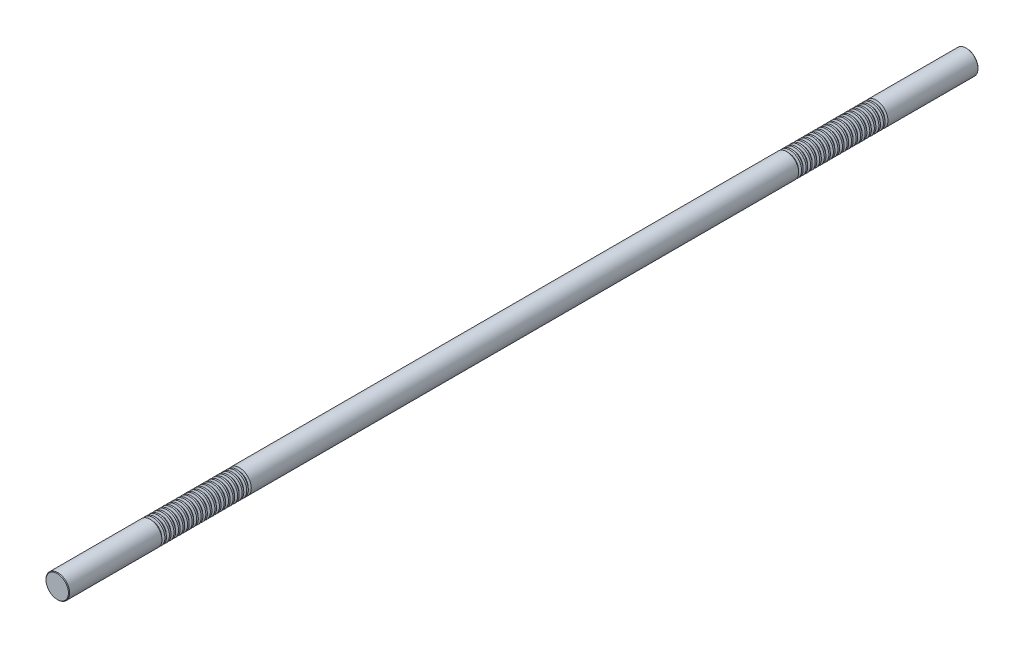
ISO-10303-21;
HEADER;
FILE_DESCRIPTION(('STEP AP214'),'2;1');
FILE_NAME('part.step','',(''),(''),'','','');
FILE_SCHEMA(('AUTOMOTIVE_DESIGN { 1 0 10303 214 1 1 1 1 }'));
ENDSEC;
DATA;
#1=APPLICATION_CONTEXT('core data for automotive mechanical design processes');
#2=APPLICATION_PROTOCOL_DEFINITION('international standard','automotive_design',2000,#1);
#3=PRODUCT_CONTEXT('',#1,'mechanical');
#4=PRODUCT('Part','Part','',(#3));
#5=PRODUCT_RELATED_PRODUCT_CATEGORY('part','',(#4));
#6=PRODUCT_DEFINITION_FORMATION('','',#4);
#7=PRODUCT_DEFINITION_CONTEXT('part definition',#1,'design');
#8=PRODUCT_DEFINITION('design','',#6,#7);
#9=PRODUCT_DEFINITION_SHAPE('','',#8);
#10=(LENGTH_UNIT() NAMED_UNIT(*) SI_UNIT(.MILLI.,.METRE.));
#11=(NAMED_UNIT(*) PLANE_ANGLE_UNIT() SI_UNIT($,.RADIAN.));
#12=(NAMED_UNIT(*) SI_UNIT($,.STERADIAN.) SOLID_ANGLE_UNIT());
#13=UNCERTAINTY_MEASURE_WITH_UNIT(LENGTH_MEASURE(1.E-05),#10,'distance_accuracy_value','');
#14=(GEOMETRIC_REPRESENTATION_CONTEXT(3) GLOBAL_UNCERTAINTY_ASSIGNED_CONTEXT((#13)) GLOBAL_UNIT_ASSIGNED_CONTEXT((#10,
#11,#12)) REPRESENTATION_CONTEXT('',''));
#15=CARTESIAN_POINT('',(0.,0.,0.));
#16=DIRECTION('',(0.,0.,1.));
#17=DIRECTION('',(1.,0.,0.));
#18=AXIS2_PLACEMENT_3D('',#15,#16,#17);
#19=CARTESIAN_POINT('',(0.,0.,500.));
#20=DIRECTION('',(0.,0.,-1.));
#21=DIRECTION('',(-1.,0.,0.));
#22=AXIS2_PLACEMENT_3D('',#19,#20,#21);
#23=CYLINDRICAL_SURFACE('',#22,13.);
#24=CARTESIAN_POINT('',(0.,0.,392.868430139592));
#25=DIRECTION('',(0.,0.,1.));
#26=DIRECTION('',(1.,0.,0.));
#27=AXIS2_PLACEMENT_3D('',#24,#25,#26);
#28=CIRCLE('',#27,13.);
#29=CARTESIAN_POINT('',(13.,0.,392.868430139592));
#30=VERTEX_POINT('',#29);
#31=EDGE_CURVE('E673',#30,#30,#28,.T.);
#32=ORIENTED_EDGE('',*,*,#31,.T.);
#33=EDGE_LOOP('',(#32));
#34=FACE_BOUND('',#33,.T.);
#35=CARTESIAN_POINT('',(0.,0.,394.631569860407));
#36=DIRECTION('',(0.,0.,1.));
#37=DIRECTION('',(1.,0.,0.));
#38=AXIS2_PLACEMENT_3D('',#35,#36,#37);
#39=CIRCLE('',#38,13.);
#40=CARTESIAN_POINT('',(13.,0.,394.631569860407));
#41=VERTEX_POINT('',#40);
#42=EDGE_CURVE('E685',#41,#41,#39,.T.);
#43=ORIENTED_EDGE('',*,*,#42,.F.);
#44=EDGE_LOOP('',(#43));
#45=FACE_BOUND('',#44,.T.);
#46=ADVANCED_FACE('F37',(#34,#45),#23,.T.);
#47=CARTESIAN_POINT('',(0.,0.,387.868430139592));
#48=DIRECTION('',(0.,0.,1.));
#49=DIRECTION('',(1.,0.,0.));
#50=AXIS2_PLACEMENT_3D('',#47,#48,#49);
#51=CIRCLE('',#50,13.);
#52=CARTESIAN_POINT('',(13.,0.,387.868430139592));
#53=VERTEX_POINT('',#52);
#54=EDGE_CURVE('E657',#53,#53,#51,.T.);
#55=ORIENTED_EDGE('',*,*,#54,.T.);
#56=EDGE_LOOP('',(#55));
#57=FACE_BOUND('',#56,.T.);
#58=CARTESIAN_POINT('',(0.,0.,389.631569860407));
#59=DIRECTION('',(0.,0.,1.));
#60=DIRECTION('',(1.,0.,0.));
#61=AXIS2_PLACEMENT_3D('',#58,#59,#60);
#62=CIRCLE('',#61,13.);
#63=CARTESIAN_POINT('',(13.,0.,389.631569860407));
#64=VERTEX_POINT('',#63);
#65=EDGE_CURVE('E669',#64,#64,#62,.T.);
#66=ORIENTED_EDGE('',*,*,#65,.F.);
#67=EDGE_LOOP('',(#66));
#68=FACE_BOUND('',#67,.T.);
#69=ADVANCED_FACE('F721',(#57,#68),#23,.T.);
#70=CARTESIAN_POINT('',(0.,0.,382.868430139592));
#71=DIRECTION('',(0.,0.,1.));
#72=DIRECTION('',(1.,0.,0.));
#73=AXIS2_PLACEMENT_3D('',#70,#71,#72);
#74=CIRCLE('',#73,13.);
#75=CARTESIAN_POINT('',(13.,0.,382.868430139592));
#76=VERTEX_POINT('',#75);
#77=EDGE_CURVE('E641',#76,#76,#74,.T.);
#78=ORIENTED_EDGE('',*,*,#77,.T.);
#79=EDGE_LOOP('',(#78));
#80=FACE_BOUND('',#79,.T.);
#81=CARTESIAN_POINT('',(0.,0.,384.631569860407));
#82=DIRECTION('',(0.,0.,1.));
#83=DIRECTION('',(1.,0.,0.));
#84=AXIS2_PLACEMENT_3D('',#81,#82,#83);
#85=CIRCLE('',#84,13.);
#86=CARTESIAN_POINT('',(13.,0.,384.631569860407));
#87=VERTEX_POINT('',#86);
#88=EDGE_CURVE('E653',#87,#87,#85,.T.);
#89=ORIENTED_EDGE('',*,*,#88,.F.);
#90=EDGE_LOOP('',(#89));
#91=FACE_BOUND('',#90,.T.);
#92=ADVANCED_FACE('F729',(#80,#91),#23,.T.);
#93=CARTESIAN_POINT('',(0.,0.,377.868430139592));
#94=DIRECTION('',(0.,0.,1.));
#95=DIRECTION('',(1.,0.,0.));
#96=AXIS2_PLACEMENT_3D('',#93,#94,#95);
#97=CIRCLE('',#96,13.);
#98=CARTESIAN_POINT('',(13.,0.,377.868430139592));
#99=VERTEX_POINT('',#98);
#100=EDGE_CURVE('E625',#99,#99,#97,.T.);
#101=ORIENTED_EDGE('',*,*,#100,.T.);
#102=EDGE_LOOP('',(#101));
#103=FACE_BOUND('',#102,.T.);
#104=CARTESIAN_POINT('',(0.,0.,379.631569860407));
#105=DIRECTION('',(0.,0.,1.));
#106=DIRECTION('',(1.,0.,0.));
#107=AXIS2_PLACEMENT_3D('',#104,#105,#106);
#108=CIRCLE('',#107,13.);
#109=CARTESIAN_POINT('',(13.,0.,379.631569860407));
#110=VERTEX_POINT('',#109);
#111=EDGE_CURVE('E637',#110,#110,#108,.T.);
#112=ORIENTED_EDGE('',*,*,#111,.F.);
#113=EDGE_LOOP('',(#112));
#114=FACE_BOUND('',#113,.T.);
#115=ADVANCED_FACE('F1550',(#103,#114),#23,.T.);
#116=CARTESIAN_POINT('',(0.,0.,372.868430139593));
#117=DIRECTION('',(0.,0.,1.));
#118=DIRECTION('',(1.,0.,0.));
#119=AXIS2_PLACEMENT_3D('',#116,#117,#118);
#120=CIRCLE('',#119,13.);
#121=CARTESIAN_POINT('',(13.,0.,372.868430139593));
#122=VERTEX_POINT('',#121);
#123=EDGE_CURVE('E609',#122,#122,#120,.T.);
#124=ORIENTED_EDGE('',*,*,#123,.T.);
#125=EDGE_LOOP('',(#124));
#126=FACE_BOUND('',#125,.T.);
#127=CARTESIAN_POINT('',(0.,0.,374.631569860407));
#128=DIRECTION('',(0.,0.,1.));
#129=DIRECTION('',(1.,0.,0.));
#130=AXIS2_PLACEMENT_3D('',#127,#128,#129);
#131=CIRCLE('',#130,13.);
#132=CARTESIAN_POINT('',(13.,0.,374.631569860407));
#133=VERTEX_POINT('',#132);
#134=EDGE_CURVE('E621',#133,#133,#131,.T.);
#135=ORIENTED_EDGE('',*,*,#134,.F.);
#136=EDGE_LOOP('',(#135));
#137=FACE_BOUND('',#136,.T.);
#138=ADVANCED_FACE('F1527',(#126,#137),#23,.T.);
#139=CARTESIAN_POINT('',(0.,0.,367.868430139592));
#140=DIRECTION('',(0.,0.,1.));
#141=DIRECTION('',(1.,0.,0.));
#142=AXIS2_PLACEMENT_3D('',#139,#140,#141);
#143=CIRCLE('',#142,13.);
#144=CARTESIAN_POINT('',(13.,0.,367.868430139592));
#145=VERTEX_POINT('',#144);
#146=EDGE_CURVE('E593',#145,#145,#143,.T.);
#147=ORIENTED_EDGE('',*,*,#146,.T.);
#148=EDGE_LOOP('',(#147));
#149=FACE_BOUND('',#148,.T.);
#150=CARTESIAN_POINT('',(0.,0.,369.631569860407));
#151=DIRECTION('',(0.,0.,1.));
#152=DIRECTION('',(1.,0.,0.));
#153=AXIS2_PLACEMENT_3D('',#150,#151,#152);
#154=CIRCLE('',#153,13.);
#155=CARTESIAN_POINT('',(13.,0.,369.631569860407));
#156=VERTEX_POINT('',#155);
#157=EDGE_CURVE('E605',#156,#156,#154,.T.);
#158=ORIENTED_EDGE('',*,*,#157,.F.);
#159=EDGE_LOOP('',(#158));
#160=FACE_BOUND('',#159,.T.);
#161=ADVANCED_FACE('F1504',(#149,#160),#23,.T.);
#162=CARTESIAN_POINT('',(0.,0.,362.868430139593));
#163=DIRECTION('',(0.,0.,1.));
#164=DIRECTION('',(1.,0.,0.));
#165=AXIS2_PLACEMENT_3D('',#162,#163,#164);
#166=CIRCLE('',#165,13.);
#167=CARTESIAN_POINT('',(13.,0.,362.868430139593));
#168=VERTEX_POINT('',#167);
#169=EDGE_CURVE('E577',#168,#168,#166,.T.);
#170=ORIENTED_EDGE('',*,*,#169,.T.);
#171=EDGE_LOOP('',(#170));
#172=FACE_BOUND('',#171,.T.);
#173=CARTESIAN_POINT('',(0.,0.,364.631569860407));
#174=DIRECTION('',(0.,0.,1.));
#175=DIRECTION('',(1.,0.,0.));
#176=AXIS2_PLACEMENT_3D('',#173,#174,#175);
#177=CIRCLE('',#176,13.);
#178=CARTESIAN_POINT('',(13.,0.,364.631569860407));
#179=VERTEX_POINT('',#178);
#180=EDGE_CURVE('E589',#179,#179,#177,.T.);
#181=ORIENTED_EDGE('',*,*,#180,.F.);
#182=EDGE_LOOP('',(#181));
#183=FACE_BOUND('',#182,.T.);
#184=ADVANCED_FACE('F1481',(#172,#183),#23,.T.);
#185=CARTESIAN_POINT('',(0.,0.,357.868430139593));
#186=DIRECTION('',(0.,0.,1.));
#187=DIRECTION('',(1.,0.,0.));
#188=AXIS2_PLACEMENT_3D('',#185,#186,#187);
#189=CIRCLE('',#188,13.);
#190=CARTESIAN_POINT('',(13.,0.,357.868430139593));
#191=VERTEX_POINT('',#190);
#192=EDGE_CURVE('E561',#191,#191,#189,.T.);
#193=ORIENTED_EDGE('',*,*,#192,.T.);
#194=EDGE_LOOP('',(#193));
#195=FACE_BOUND('',#194,.T.);
#196=CARTESIAN_POINT('',(0.,0.,359.631569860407));
#197=DIRECTION('',(0.,0.,1.));
#198=DIRECTION('',(1.,0.,0.));
#199=AXIS2_PLACEMENT_3D('',#196,#197,#198);
#200=CIRCLE('',#199,13.);
#201=CARTESIAN_POINT('',(13.,0.,359.631569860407));
#202=VERTEX_POINT('',#201);
#203=EDGE_CURVE('E573',#202,#202,#200,.T.);
#204=ORIENTED_EDGE('',*,*,#203,.F.);
#205=EDGE_LOOP('',(#204));
#206=FACE_BOUND('',#205,.T.);
#207=ADVANCED_FACE('F1458',(#195,#206),#23,.T.);
#208=CARTESIAN_POINT('',(0.,0.,352.868430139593));
#209=DIRECTION('',(0.,0.,1.));
#210=DIRECTION('',(1.,0.,0.));
#211=AXIS2_PLACEMENT_3D('',#208,#209,#210);
#212=CIRCLE('',#211,13.);
#213=CARTESIAN_POINT('',(13.,0.,352.868430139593));
#214=VERTEX_POINT('',#213);
#215=EDGE_CURVE('E545',#214,#214,#212,.T.);
#216=ORIENTED_EDGE('',*,*,#215,.T.);
#217=EDGE_LOOP('',(#216));
#218=FACE_BOUND('',#217,.T.);
#219=CARTESIAN_POINT('',(0.,0.,354.631569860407));
#220=DIRECTION('',(0.,0.,1.));
#221=DIRECTION('',(1.,0.,0.));
#222=AXIS2_PLACEMENT_3D('',#219,#220,#221);
#223=CIRCLE('',#222,13.);
#224=CARTESIAN_POINT('',(13.,0.,354.631569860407));
#225=VERTEX_POINT('',#224);
#226=EDGE_CURVE('E557',#225,#225,#223,.T.);
#227=ORIENTED_EDGE('',*,*,#226,.F.);
#228=EDGE_LOOP('',(#227));
#229=FACE_BOUND('',#228,.T.);
#230=ADVANCED_FACE('F1435',(#218,#229),#23,.T.);
#231=CARTESIAN_POINT('',(0.,0.,347.868430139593));
#232=DIRECTION('',(0.,0.,1.));
#233=DIRECTION('',(1.,0.,0.));
#234=AXIS2_PLACEMENT_3D('',#231,#232,#233);
#235=CIRCLE('',#234,13.);
#236=CARTESIAN_POINT('',(13.,0.,347.868430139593));
#237=VERTEX_POINT('',#236);
#238=EDGE_CURVE('E529',#237,#237,#235,.T.);
#239=ORIENTED_EDGE('',*,*,#238,.T.);
#240=EDGE_LOOP('',(#239));
#241=FACE_BOUND('',#240,.T.);
#242=CARTESIAN_POINT('',(0.,0.,349.631569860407));
#243=DIRECTION('',(0.,0.,1.));
#244=DIRECTION('',(1.,0.,0.));
#245=AXIS2_PLACEMENT_3D('',#242,#243,#244);
#246=CIRCLE('',#245,13.);
#247=CARTESIAN_POINT('',(13.,0.,349.631569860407));
#248=VERTEX_POINT('',#247);
#249=EDGE_CURVE('E541',#248,#248,#246,.T.);
#250=ORIENTED_EDGE('',*,*,#249,.F.);
#251=EDGE_LOOP('',(#250));
#252=FACE_BOUND('',#251,.T.);
#253=ADVANCED_FACE('F1412',(#241,#252),#23,.T.);
#254=CARTESIAN_POINT('',(0.,0.,342.868430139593));
#255=DIRECTION('',(0.,0.,1.));
#256=DIRECTION('',(1.,0.,0.));
#257=AXIS2_PLACEMENT_3D('',#254,#255,#256);
#258=CIRCLE('',#257,13.);
#259=CARTESIAN_POINT('',(13.,0.,342.868430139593));
#260=VERTEX_POINT('',#259);
#261=EDGE_CURVE('E513',#260,#260,#258,.T.);
#262=ORIENTED_EDGE('',*,*,#261,.T.);
#263=EDGE_LOOP('',(#262));
#264=FACE_BOUND('',#263,.T.);
#265=CARTESIAN_POINT('',(0.,0.,344.631569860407));
#266=DIRECTION('',(0.,0.,1.));
#267=DIRECTION('',(1.,0.,0.));
#268=AXIS2_PLACEMENT_3D('',#265,#266,#267);
#269=CIRCLE('',#268,13.);
#270=CARTESIAN_POINT('',(13.,0.,344.631569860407));
#271=VERTEX_POINT('',#270);
#272=EDGE_CURVE('E525',#271,#271,#269,.T.);
#273=ORIENTED_EDGE('',*,*,#272,.F.);
#274=EDGE_LOOP('',(#273));
#275=FACE_BOUND('',#274,.T.);
#276=ADVANCED_FACE('F1389',(#264,#275),#23,.T.);
#277=CARTESIAN_POINT('',(0.,0.,337.868430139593));
#278=DIRECTION('',(0.,0.,1.));
#279=DIRECTION('',(1.,0.,0.));
#280=AXIS2_PLACEMENT_3D('',#277,#278,#279);
#281=CIRCLE('',#280,13.);
#282=CARTESIAN_POINT('',(13.,0.,337.868430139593));
#283=VERTEX_POINT('',#282);
#284=EDGE_CURVE('E497',#283,#283,#281,.T.);
#285=ORIENTED_EDGE('',*,*,#284,.T.);
#286=EDGE_LOOP('',(#285));
#287=FACE_BOUND('',#286,.T.);
#288=CARTESIAN_POINT('',(0.,0.,339.631569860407));
#289=DIRECTION('',(0.,0.,1.));
#290=DIRECTION('',(1.,0.,0.));
#291=AXIS2_PLACEMENT_3D('',#288,#289,#290);
#292=CIRCLE('',#291,13.);
#293=CARTESIAN_POINT('',(13.,0.,339.631569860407));
#294=VERTEX_POINT('',#293);
#295=EDGE_CURVE('E509',#294,#294,#292,.T.);
#296=ORIENTED_EDGE('',*,*,#295,.F.);
#297=EDGE_LOOP('',(#296));
#298=FACE_BOUND('',#297,.T.);
#299=ADVANCED_FACE('F1366',(#287,#298),#23,.T.);
#300=CARTESIAN_POINT('',(0.,0.,332.868430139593));
#301=DIRECTION('',(0.,0.,1.));
#302=DIRECTION('',(1.,0.,0.));
#303=AXIS2_PLACEMENT_3D('',#300,#301,#302);
#304=CIRCLE('',#303,13.);
#305=CARTESIAN_POINT('',(13.,0.,332.868430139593));
#306=VERTEX_POINT('',#305);
#307=EDGE_CURVE('E481',#306,#306,#304,.T.);
#308=ORIENTED_EDGE('',*,*,#307,.T.);
#309=EDGE_LOOP('',(#308));
#310=FACE_BOUND('',#309,.T.);
#311=CARTESIAN_POINT('',(0.,0.,334.631569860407));
#312=DIRECTION('',(0.,0.,1.));
#313=DIRECTION('',(1.,0.,0.));
#314=AXIS2_PLACEMENT_3D('',#311,#312,#313);
#315=CIRCLE('',#314,13.);
#316=CARTESIAN_POINT('',(13.,0.,334.631569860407));
#317=VERTEX_POINT('',#316);
#318=EDGE_CURVE('E493',#317,#317,#315,.T.);
#319=ORIENTED_EDGE('',*,*,#318,.F.);
#320=EDGE_LOOP('',(#319));
#321=FACE_BOUND('',#320,.T.);
#322=ADVANCED_FACE('F1343',(#310,#321),#23,.T.);
#323=CARTESIAN_POINT('',(0.,0.,327.868430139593));
#324=DIRECTION('',(0.,0.,1.));
#325=DIRECTION('',(1.,0.,0.));
#326=AXIS2_PLACEMENT_3D('',#323,#324,#325);
#327=CIRCLE('',#326,13.);
#328=CARTESIAN_POINT('',(13.,0.,327.868430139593));
#329=VERTEX_POINT('',#328);
#330=EDGE_CURVE('E466',#329,#329,#327,.T.);
#331=ORIENTED_EDGE('',*,*,#330,.T.);
#332=EDGE_LOOP('',(#331));
#333=FACE_BOUND('',#332,.T.);
#334=CARTESIAN_POINT('',(0.,0.,329.631569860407));
#335=DIRECTION('',(0.,0.,1.));
#336=DIRECTION('',(1.,0.,0.));
#337=AXIS2_PLACEMENT_3D('',#334,#335,#336);
#338=CIRCLE('',#337,13.);
#339=CARTESIAN_POINT('',(13.,0.,329.631569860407));
#340=VERTEX_POINT('',#339);
#341=EDGE_CURVE('E477',#340,#340,#338,.T.);
#342=ORIENTED_EDGE('',*,*,#341,.F.);
#343=EDGE_LOOP('',(#342));
#344=FACE_BOUND('',#343,.T.);
#345=ADVANCED_FACE('F1320',(#333,#344),#23,.T.);
#346=CARTESIAN_POINT('',(0.,0.,322.868430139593));
#347=DIRECTION('',(0.,0.,1.));
#348=DIRECTION('',(1.,0.,0.));
#349=AXIS2_PLACEMENT_3D('',#346,#347,#348);
#350=CIRCLE('',#349,13.);
#351=CARTESIAN_POINT('',(13.,0.,322.868430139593));
#352=VERTEX_POINT('',#351);
#353=EDGE_CURVE('E450',#352,#352,#350,.T.);
#354=ORIENTED_EDGE('',*,*,#353,.T.);
#355=EDGE_LOOP('',(#354));
#356=FACE_BOUND('',#355,.T.);
#357=CARTESIAN_POINT('',(0.,0.,324.631569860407));
#358=DIRECTION('',(0.,0.,1.));
#359=DIRECTION('',(1.,0.,0.));
#360=AXIS2_PLACEMENT_3D('',#357,#358,#359);
#361=CIRCLE('',#360,13.);
#362=CARTESIAN_POINT('',(13.,0.,324.631569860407));
#363=VERTEX_POINT('',#362);
#364=EDGE_CURVE('E462',#363,#363,#361,.T.);
#365=ORIENTED_EDGE('',*,*,#364,.F.);
#366=EDGE_LOOP('',(#365));
#367=FACE_BOUND('',#366,.T.);
#368=ADVANCED_FACE('F1297',(#356,#367),#23,.T.);
#369=CARTESIAN_POINT('',(0.,0.,317.868430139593));
#370=DIRECTION('',(0.,0.,1.));
#371=DIRECTION('',(1.,0.,0.));
#372=AXIS2_PLACEMENT_3D('',#369,#370,#371);
#373=CIRCLE('',#372,13.);
#374=CARTESIAN_POINT('',(13.,0.,317.868430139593));
#375=VERTEX_POINT('',#374);
#376=EDGE_CURVE('E434',#375,#375,#373,.T.);
#377=ORIENTED_EDGE('',*,*,#376,.T.);
#378=EDGE_LOOP('',(#377));
#379=FACE_BOUND('',#378,.T.);
#380=CARTESIAN_POINT('',(0.,0.,319.631569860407));
#381=DIRECTION('',(0.,0.,1.));
#382=DIRECTION('',(1.,0.,0.));
#383=AXIS2_PLACEMENT_3D('',#380,#381,#382);
#384=CIRCLE('',#383,13.);
#385=CARTESIAN_POINT('',(13.,0.,319.631569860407));
#386=VERTEX_POINT('',#385);
#387=EDGE_CURVE('E446',#386,#386,#384,.T.);
#388=ORIENTED_EDGE('',*,*,#387,.F.);
#389=EDGE_LOOP('',(#388));
#390=FACE_BOUND('',#389,.T.);
#391=ADVANCED_FACE('F1274',(#379,#390),#23,.T.);
#392=CARTESIAN_POINT('',(0.,0.,312.868430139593));
#393=DIRECTION('',(0.,0.,1.));
#394=DIRECTION('',(1.,0.,0.));
#395=AXIS2_PLACEMENT_3D('',#392,#393,#394);
#396=CIRCLE('',#395,13.);
#397=CARTESIAN_POINT('',(13.,0.,312.868430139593));
#398=VERTEX_POINT('',#397);
#399=EDGE_CURVE('E418',#398,#398,#396,.T.);
#400=ORIENTED_EDGE('',*,*,#399,.T.);
#401=EDGE_LOOP('',(#400));
#402=FACE_BOUND('',#401,.T.);
#403=CARTESIAN_POINT('',(0.,0.,314.631569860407));
#404=DIRECTION('',(0.,0.,1.));
#405=DIRECTION('',(1.,0.,0.));
#406=AXIS2_PLACEMENT_3D('',#403,#404,#405);
#407=CIRCLE('',#406,13.);
#408=CARTESIAN_POINT('',(13.,0.,314.631569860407));
#409=VERTEX_POINT('',#408);
#410=EDGE_CURVE('E430',#409,#409,#407,.T.);
#411=ORIENTED_EDGE('',*,*,#410,.F.);
#412=EDGE_LOOP('',(#411));
#413=FACE_BOUND('',#412,.T.);
#414=ADVANCED_FACE('F1251',(#402,#413),#23,.T.);
#415=CARTESIAN_POINT('',(0.,0.,307.868430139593));
#416=DIRECTION('',(0.,0.,1.));
#417=DIRECTION('',(1.,0.,0.));
#418=AXIS2_PLACEMENT_3D('',#415,#416,#417);
#419=CIRCLE('',#418,13.);
#420=CARTESIAN_POINT('',(13.,0.,307.868430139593));
#421=VERTEX_POINT('',#420);
#422=EDGE_CURVE('E402',#421,#421,#419,.T.);
#423=ORIENTED_EDGE('',*,*,#422,.T.);
#424=EDGE_LOOP('',(#423));
#425=FACE_BOUND('',#424,.T.);
#426=CARTESIAN_POINT('',(0.,0.,309.631569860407));
#427=DIRECTION('',(0.,0.,1.));
#428=DIRECTION('',(1.,0.,0.));
#429=AXIS2_PLACEMENT_3D('',#426,#427,#428);
#430=CIRCLE('',#429,13.);
#431=CARTESIAN_POINT('',(13.,0.,309.631569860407));
#432=VERTEX_POINT('',#431);
#433=EDGE_CURVE('E414',#432,#432,#430,.T.);
#434=ORIENTED_EDGE('',*,*,#433,.F.);
#435=EDGE_LOOP('',(#434));
#436=FACE_BOUND('',#435,.T.);
#437=ADVANCED_FACE('F1228',(#425,#436),#23,.T.);
#438=CARTESIAN_POINT('',(0.,0.,302.868430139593));
#439=DIRECTION('',(0.,0.,1.));
#440=DIRECTION('',(1.,0.,0.));
#441=AXIS2_PLACEMENT_3D('',#438,#439,#440);
#442=CIRCLE('',#441,13.);
#443=CARTESIAN_POINT('',(13.,0.,302.868430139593));
#444=VERTEX_POINT('',#443);
#445=EDGE_CURVE('E386',#444,#444,#442,.T.);
#446=ORIENTED_EDGE('',*,*,#445,.T.);
#447=EDGE_LOOP('',(#446));
#448=FACE_BOUND('',#447,.T.);
#449=CARTESIAN_POINT('',(0.,0.,304.631569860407));
#450=DIRECTION('',(0.,0.,1.));
#451=DIRECTION('',(1.,0.,0.));
#452=AXIS2_PLACEMENT_3D('',#449,#450,#451);
#453=CIRCLE('',#452,13.);
#454=CARTESIAN_POINT('',(13.,0.,304.631569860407));
#455=VERTEX_POINT('',#454);
#456=EDGE_CURVE('E398',#455,#455,#453,.T.);
#457=ORIENTED_EDGE('',*,*,#456,.F.);
#458=EDGE_LOOP('',(#457));
#459=FACE_BOUND('',#458,.T.);
#460=ADVANCED_FACE('F1205',(#448,#459),#23,.T.);
#461=CARTESIAN_POINT('',(0.,0.,-302.131569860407));
#462=DIRECTION('',(0.,0.,1.));
#463=DIRECTION('',(1.,0.,0.));
#464=AXIS2_PLACEMENT_3D('',#461,#462,#463);
#465=CIRCLE('',#464,13.);
#466=CARTESIAN_POINT('',(13.,0.,-302.131569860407));
#467=VERTEX_POINT('',#466);
#468=EDGE_CURVE('E370',#467,#467,#465,.T.);
#469=ORIENTED_EDGE('',*,*,#468,.T.);
#470=EDGE_LOOP('',(#469));
#471=FACE_BOUND('',#470,.T.);
#472=CARTESIAN_POINT('',(0.,0.,299.631569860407));
#473=DIRECTION('',(0.,0.,1.));
#474=DIRECTION('',(1.,0.,0.));
#475=AXIS2_PLACEMENT_3D('',#472,#473,#474);
#476=CIRCLE('',#475,13.);
#477=CARTESIAN_POINT('',(13.,0.,299.631569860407));
#478=VERTEX_POINT('',#477);
#479=EDGE_CURVE('E382',#478,#478,#476,.T.);
#480=ORIENTED_EDGE('',*,*,#479,.F.);
#481=EDGE_LOOP('',(#480));
#482=FACE_BOUND('',#481,.T.);
#483=ADVANCED_FACE('F1182',(#471,#482),#23,.T.);
#484=CARTESIAN_POINT('',(0.,0.,-307.131569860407));
#485=DIRECTION('',(0.,0.,1.));
#486=DIRECTION('',(1.,0.,0.));
#487=AXIS2_PLACEMENT_3D('',#484,#485,#486);
#488=CIRCLE('',#487,13.);
#489=CARTESIAN_POINT('',(13.,0.,-307.131569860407));
#490=VERTEX_POINT('',#489);
#491=EDGE_CURVE('E354',#490,#490,#488,.T.);
#492=ORIENTED_EDGE('',*,*,#491,.T.);
#493=EDGE_LOOP('',(#492));
#494=FACE_BOUND('',#493,.T.);
#495=CARTESIAN_POINT('',(0.,0.,-305.368430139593));
#496=DIRECTION('',(0.,0.,1.));
#497=DIRECTION('',(1.,0.,0.));
#498=AXIS2_PLACEMENT_3D('',#495,#496,#497);
#499=CIRCLE('',#498,13.);
#500=CARTESIAN_POINT('',(13.,0.,-305.368430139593));
#501=VERTEX_POINT('',#500);
#502=EDGE_CURVE('E366',#501,#501,#499,.T.);
#503=ORIENTED_EDGE('',*,*,#502,.F.);
#504=EDGE_LOOP('',(#503));
#505=FACE_BOUND('',#504,.T.);
#506=ADVANCED_FACE('F1159',(#494,#505),#23,.T.);
#507=CARTESIAN_POINT('',(0.,0.,-312.131569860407));
#508=DIRECTION('',(0.,0.,1.));
#509=DIRECTION('',(1.,0.,0.));
#510=AXIS2_PLACEMENT_3D('',#507,#508,#509);
#511=CIRCLE('',#510,13.);
#512=CARTESIAN_POINT('',(13.,0.,-312.131569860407));
#513=VERTEX_POINT('',#512);
#514=EDGE_CURVE('E338',#513,#513,#511,.T.);
#515=ORIENTED_EDGE('',*,*,#514,.T.);
#516=EDGE_LOOP('',(#515));
#517=FACE_BOUND('',#516,.T.);
#518=CARTESIAN_POINT('',(0.,0.,-310.368430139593));
#519=DIRECTION('',(0.,0.,1.));
#520=DIRECTION('',(1.,0.,0.));
#521=AXIS2_PLACEMENT_3D('',#518,#519,#520);
#522=CIRCLE('',#521,13.);
#523=CARTESIAN_POINT('',(13.,0.,-310.368430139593));
#524=VERTEX_POINT('',#523);
#525=EDGE_CURVE('E350',#524,#524,#522,.T.);
#526=ORIENTED_EDGE('',*,*,#525,.F.);
#527=EDGE_LOOP('',(#526));
#528=FACE_BOUND('',#527,.T.);
#529=ADVANCED_FACE('F1136',(#517,#528),#23,.T.);
#530=CARTESIAN_POINT('',(0.,0.,-317.131569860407));
#531=DIRECTION('',(0.,0.,1.));
#532=DIRECTION('',(1.,0.,0.));
#533=AXIS2_PLACEMENT_3D('',#530,#531,#532);
#534=CIRCLE('',#533,13.);
#535=CARTESIAN_POINT('',(13.,0.,-317.131569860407));
#536=VERTEX_POINT('',#535);
#537=EDGE_CURVE('E322',#536,#536,#534,.T.);
#538=ORIENTED_EDGE('',*,*,#537,.T.);
#539=EDGE_LOOP('',(#538));
#540=FACE_BOUND('',#539,.T.);
#541=CARTESIAN_POINT('',(0.,0.,-315.368430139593));
#542=DIRECTION('',(0.,0.,1.));
#543=DIRECTION('',(1.,0.,0.));
#544=AXIS2_PLACEMENT_3D('',#541,#542,#543);
#545=CIRCLE('',#544,13.);
#546=CARTESIAN_POINT('',(13.,0.,-315.368430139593));
#547=VERTEX_POINT('',#546);
#548=EDGE_CURVE('E334',#547,#547,#545,.T.);
#549=ORIENTED_EDGE('',*,*,#548,.F.);
#550=EDGE_LOOP('',(#549));
#551=FACE_BOUND('',#550,.T.);
#552=ADVANCED_FACE('F1113',(#540,#551),#23,.T.);
#553=CARTESIAN_POINT('',(0.,0.,-322.131569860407));
#554=DIRECTION('',(0.,0.,1.));
#555=DIRECTION('',(1.,0.,0.));
#556=AXIS2_PLACEMENT_3D('',#553,#554,#555);
#557=CIRCLE('',#556,13.);
#558=CARTESIAN_POINT('',(13.,0.,-322.131569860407));
#559=VERTEX_POINT('',#558);
#560=EDGE_CURVE('E307',#559,#559,#557,.T.);
#561=ORIENTED_EDGE('',*,*,#560,.T.);
#562=EDGE_LOOP('',(#561));
#563=FACE_BOUND('',#562,.T.);
#564=CARTESIAN_POINT('',(0.,0.,-320.368430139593));
#565=DIRECTION('',(0.,0.,1.));
#566=DIRECTION('',(1.,0.,0.));
#567=AXIS2_PLACEMENT_3D('',#564,#565,#566);
#568=CIRCLE('',#567,13.);
#569=CARTESIAN_POINT('',(13.,0.,-320.368430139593));
#570=VERTEX_POINT('',#569);
#571=EDGE_CURVE('E318',#570,#570,#568,.T.);
#572=ORIENTED_EDGE('',*,*,#571,.F.);
#573=EDGE_LOOP('',(#572));
#574=FACE_BOUND('',#573,.T.);
#575=ADVANCED_FACE('F1090',(#563,#574),#23,.T.);
#576=CARTESIAN_POINT('',(0.,0.,-327.131569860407));
#577=DIRECTION('',(0.,0.,1.));
#578=DIRECTION('',(1.,0.,0.));
#579=AXIS2_PLACEMENT_3D('',#576,#577,#578);
#580=CIRCLE('',#579,13.);
#581=CARTESIAN_POINT('',(13.,0.,-327.131569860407));
#582=VERTEX_POINT('',#581);
#583=EDGE_CURVE('E291',#582,#582,#580,.T.);
#584=ORIENTED_EDGE('',*,*,#583,.T.);
#585=EDGE_LOOP('',(#584));
#586=FACE_BOUND('',#585,.T.);
#587=CARTESIAN_POINT('',(0.,0.,-325.368430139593));
#588=DIRECTION('',(0.,0.,1.));
#589=DIRECTION('',(1.,0.,0.));
#590=AXIS2_PLACEMENT_3D('',#587,#588,#589);
#591=CIRCLE('',#590,13.);
#592=CARTESIAN_POINT('',(13.,0.,-325.368430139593));
#593=VERTEX_POINT('',#592);
#594=EDGE_CURVE('E303',#593,#593,#591,.T.);
#595=ORIENTED_EDGE('',*,*,#594,.F.);
#596=EDGE_LOOP('',(#595));
#597=FACE_BOUND('',#596,.T.);
#598=ADVANCED_FACE('F1067',(#586,#597),#23,.T.);
#599=CARTESIAN_POINT('',(0.,0.,-332.131569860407));
#600=DIRECTION('',(0.,0.,1.));
#601=DIRECTION('',(1.,0.,0.));
#602=AXIS2_PLACEMENT_3D('',#599,#600,#601);
#603=CIRCLE('',#602,13.);
#604=CARTESIAN_POINT('',(13.,0.,-332.131569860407));
#605=VERTEX_POINT('',#604);
#606=EDGE_CURVE('E275',#605,#605,#603,.T.);
#607=ORIENTED_EDGE('',*,*,#606,.T.);
#608=EDGE_LOOP('',(#607));
#609=FACE_BOUND('',#608,.T.);
#610=CARTESIAN_POINT('',(0.,0.,-330.368430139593));
#611=DIRECTION('',(0.,0.,1.));
#612=DIRECTION('',(1.,0.,0.));
#613=AXIS2_PLACEMENT_3D('',#610,#611,#612);
#614=CIRCLE('',#613,13.);
#615=CARTESIAN_POINT('',(13.,0.,-330.368430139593));
#616=VERTEX_POINT('',#615);
#617=EDGE_CURVE('E287',#616,#616,#614,.T.);
#618=ORIENTED_EDGE('',*,*,#617,.F.);
#619=EDGE_LOOP('',(#618));
#620=FACE_BOUND('',#619,.T.);
#621=ADVANCED_FACE('F1044',(#609,#620),#23,.T.);
#622=CARTESIAN_POINT('',(0.,0.,-337.131569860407));
#623=DIRECTION('',(0.,0.,1.));
#624=DIRECTION('',(1.,0.,0.));
#625=AXIS2_PLACEMENT_3D('',#622,#623,#624);
#626=CIRCLE('',#625,13.);
#627=CARTESIAN_POINT('',(13.,0.,-337.131569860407));
#628=VERTEX_POINT('',#627);
#629=EDGE_CURVE('E259',#628,#628,#626,.T.);
#630=ORIENTED_EDGE('',*,*,#629,.T.);
#631=EDGE_LOOP('',(#630));
#632=FACE_BOUND('',#631,.T.);
#633=CARTESIAN_POINT('',(0.,0.,-335.368430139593));
#634=DIRECTION('',(0.,0.,1.));
#635=DIRECTION('',(1.,0.,0.));
#636=AXIS2_PLACEMENT_3D('',#633,#634,#635);
#637=CIRCLE('',#636,13.);
#638=CARTESIAN_POINT('',(13.,0.,-335.368430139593));
#639=VERTEX_POINT('',#638);
#640=EDGE_CURVE('E271',#639,#639,#637,.T.);
#641=ORIENTED_EDGE('',*,*,#640,.F.);
#642=EDGE_LOOP('',(#641));
#643=FACE_BOUND('',#642,.T.);
#644=ADVANCED_FACE('F1021',(#632,#643),#23,.T.);
#645=CARTESIAN_POINT('',(0.,0.,-342.131569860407));
#646=DIRECTION('',(0.,0.,1.));
#647=DIRECTION('',(1.,0.,0.));
#648=AXIS2_PLACEMENT_3D('',#645,#646,#647);
#649=CIRCLE('',#648,13.);
#650=CARTESIAN_POINT('',(13.,0.,-342.131569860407));
#651=VERTEX_POINT('',#650);
#652=EDGE_CURVE('E243',#651,#651,#649,.T.);
#653=ORIENTED_EDGE('',*,*,#652,.T.);
#654=EDGE_LOOP('',(#653));
#655=FACE_BOUND('',#654,.T.);
#656=CARTESIAN_POINT('',(0.,0.,-340.368430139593));
#657=DIRECTION('',(0.,0.,1.));
#658=DIRECTION('',(1.,0.,0.));
#659=AXIS2_PLACEMENT_3D('',#656,#657,#658);
#660=CIRCLE('',#659,13.);
#661=CARTESIAN_POINT('',(13.,0.,-340.368430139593));
#662=VERTEX_POINT('',#661);
#663=EDGE_CURVE('E255',#662,#662,#660,.T.);
#664=ORIENTED_EDGE('',*,*,#663,.F.);
#665=EDGE_LOOP('',(#664));
#666=FACE_BOUND('',#665,.T.);
#667=ADVANCED_FACE('F998',(#655,#666),#23,.T.);
#668=CARTESIAN_POINT('',(0.,0.,-347.131569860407));
#669=DIRECTION('',(0.,0.,1.));
#670=DIRECTION('',(1.,0.,0.));
#671=AXIS2_PLACEMENT_3D('',#668,#669,#670);
#672=CIRCLE('',#671,13.);
#673=CARTESIAN_POINT('',(13.,0.,-347.131569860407));
#674=VERTEX_POINT('',#673);
#675=EDGE_CURVE('E227',#674,#674,#672,.T.);
#676=ORIENTED_EDGE('',*,*,#675,.T.);
#677=EDGE_LOOP('',(#676));
#678=FACE_BOUND('',#677,.T.);
#679=CARTESIAN_POINT('',(0.,0.,-345.368430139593));
#680=DIRECTION('',(0.,0.,1.));
#681=DIRECTION('',(1.,0.,0.));
#682=AXIS2_PLACEMENT_3D('',#679,#680,#681);
#683=CIRCLE('',#682,13.);
#684=CARTESIAN_POINT('',(13.,0.,-345.368430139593));
#685=VERTEX_POINT('',#684);
#686=EDGE_CURVE('E239',#685,#685,#683,.T.);
#687=ORIENTED_EDGE('',*,*,#686,.F.);
#688=EDGE_LOOP('',(#687));
#689=FACE_BOUND('',#688,.T.);
#690=ADVANCED_FACE('F975',(#678,#689),#23,.T.);
#691=CARTESIAN_POINT('',(0.,0.,-352.131569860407));
#692=DIRECTION('',(0.,0.,1.));
#693=DIRECTION('',(1.,0.,0.));
#694=AXIS2_PLACEMENT_3D('',#691,#692,#693);
#695=CIRCLE('',#694,13.);
#696=CARTESIAN_POINT('',(13.,0.,-352.131569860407));
#697=VERTEX_POINT('',#696);
#698=EDGE_CURVE('E211',#697,#697,#695,.T.);
#699=ORIENTED_EDGE('',*,*,#698,.T.);
#700=EDGE_LOOP('',(#699));
#701=FACE_BOUND('',#700,.T.);
#702=CARTESIAN_POINT('',(0.,0.,-350.368430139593));
#703=DIRECTION('',(0.,0.,1.));
#704=DIRECTION('',(1.,0.,0.));
#705=AXIS2_PLACEMENT_3D('',#702,#703,#704);
#706=CIRCLE('',#705,13.);
#707=CARTESIAN_POINT('',(13.,0.,-350.368430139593));
#708=VERTEX_POINT('',#707);
#709=EDGE_CURVE('E223',#708,#708,#706,.T.);
#710=ORIENTED_EDGE('',*,*,#709,.F.);
#711=EDGE_LOOP('',(#710));
#712=FACE_BOUND('',#711,.T.);
#713=ADVANCED_FACE('F952',(#701,#712),#23,.T.);
#714=CARTESIAN_POINT('',(0.,0.,-357.131569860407));
#715=DIRECTION('',(0.,0.,1.));
#716=DIRECTION('',(1.,0.,0.));
#717=AXIS2_PLACEMENT_3D('',#714,#715,#716);
#718=CIRCLE('',#717,13.);
#719=CARTESIAN_POINT('',(13.,0.,-357.131569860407));
#720=VERTEX_POINT('',#719);
#721=EDGE_CURVE('E195',#720,#720,#718,.T.);
#722=ORIENTED_EDGE('',*,*,#721,.T.);
#723=EDGE_LOOP('',(#722));
#724=FACE_BOUND('',#723,.T.);
#725=CARTESIAN_POINT('',(0.,0.,-355.368430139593));
#726=DIRECTION('',(0.,0.,1.));
#727=DIRECTION('',(1.,0.,0.));
#728=AXIS2_PLACEMENT_3D('',#725,#726,#727);
#729=CIRCLE('',#728,13.);
#730=CARTESIAN_POINT('',(13.,0.,-355.368430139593));
#731=VERTEX_POINT('',#730);
#732=EDGE_CURVE('E207',#731,#731,#729,.T.);
#733=ORIENTED_EDGE('',*,*,#732,.F.);
#734=EDGE_LOOP('',(#733));
#735=FACE_BOUND('',#734,.T.);
#736=ADVANCED_FACE('F929',(#724,#735),#23,.T.);
#737=CARTESIAN_POINT('',(0.,0.,-362.131569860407));
#738=DIRECTION('',(0.,0.,1.));
#739=DIRECTION('',(1.,0.,0.));
#740=AXIS2_PLACEMENT_3D('',#737,#738,#739);
#741=CIRCLE('',#740,13.);
#742=CARTESIAN_POINT('',(13.,0.,-362.131569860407));
#743=VERTEX_POINT('',#742);
#744=EDGE_CURVE('E179',#743,#743,#741,.T.);
#745=ORIENTED_EDGE('',*,*,#744,.T.);
#746=EDGE_LOOP('',(#745));
#747=FACE_BOUND('',#746,.T.);
#748=CARTESIAN_POINT('',(0.,0.,-360.368430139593));
#749=DIRECTION('',(0.,0.,1.));
#750=DIRECTION('',(1.,0.,0.));
#751=AXIS2_PLACEMENT_3D('',#748,#749,#750);
#752=CIRCLE('',#751,13.);
#753=CARTESIAN_POINT('',(13.,0.,-360.368430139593));
#754=VERTEX_POINT('',#753);
#755=EDGE_CURVE('E191',#754,#754,#752,.T.);
#756=ORIENTED_EDGE('',*,*,#755,.F.);
#757=EDGE_LOOP('',(#756));
#758=FACE_BOUND('',#757,.T.);
#759=ADVANCED_FACE('F906',(#747,#758),#23,.T.);
#760=CARTESIAN_POINT('',(0.,0.,-367.131569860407));
#761=DIRECTION('',(0.,0.,1.));
#762=DIRECTION('',(1.,0.,0.));
#763=AXIS2_PLACEMENT_3D('',#760,#761,#762);
#764=CIRCLE('',#763,13.);
#765=CARTESIAN_POINT('',(13.,0.,-367.131569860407));
#766=VERTEX_POINT('',#765);
#767=EDGE_CURVE('E163',#766,#766,#764,.T.);
#768=ORIENTED_EDGE('',*,*,#767,.T.);
#769=EDGE_LOOP('',(#768));
#770=FACE_BOUND('',#769,.T.);
#771=CARTESIAN_POINT('',(0.,0.,-365.368430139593));
#772=DIRECTION('',(0.,0.,1.));
#773=DIRECTION('',(1.,0.,0.));
#774=AXIS2_PLACEMENT_3D('',#771,#772,#773);
#775=CIRCLE('',#774,13.);
#776=CARTESIAN_POINT('',(13.,0.,-365.368430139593));
#777=VERTEX_POINT('',#776);
#778=EDGE_CURVE('E175',#777,#777,#775,.T.);
#779=ORIENTED_EDGE('',*,*,#778,.F.);
#780=EDGE_LOOP('',(#779));
#781=FACE_BOUND('',#780,.T.);
#782=ADVANCED_FACE('F883',(#770,#781),#23,.T.);
#783=CARTESIAN_POINT('',(0.,0.,-372.131569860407));
#784=DIRECTION('',(0.,0.,1.));
#785=DIRECTION('',(1.,0.,0.));
#786=AXIS2_PLACEMENT_3D('',#783,#784,#785);
#787=CIRCLE('',#786,13.);
#788=CARTESIAN_POINT('',(13.,0.,-372.131569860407));
#789=VERTEX_POINT('',#788);
#790=EDGE_CURVE('E147',#789,#789,#787,.T.);
#791=ORIENTED_EDGE('',*,*,#790,.T.);
#792=EDGE_LOOP('',(#791));
#793=FACE_BOUND('',#792,.T.);
#794=CARTESIAN_POINT('',(0.,0.,-370.368430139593));
#795=DIRECTION('',(0.,0.,1.));
#796=DIRECTION('',(1.,0.,0.));
#797=AXIS2_PLACEMENT_3D('',#794,#795,#796);
#798=CIRCLE('',#797,13.);
#799=CARTESIAN_POINT('',(13.,0.,-370.368430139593));
#800=VERTEX_POINT('',#799);
#801=EDGE_CURVE('E159',#800,#800,#798,.T.);
#802=ORIENTED_EDGE('',*,*,#801,.F.);
#803=EDGE_LOOP('',(#802));
#804=FACE_BOUND('',#803,.T.);
#805=ADVANCED_FACE('F860',(#793,#804),#23,.T.);
#806=CARTESIAN_POINT('',(0.,0.,-377.131569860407));
#807=DIRECTION('',(0.,0.,1.));
#808=DIRECTION('',(1.,0.,0.));
#809=AXIS2_PLACEMENT_3D('',#806,#807,#808);
#810=CIRCLE('',#809,13.);
#811=CARTESIAN_POINT('',(13.,0.,-377.131569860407));
#812=VERTEX_POINT('',#811);
#813=EDGE_CURVE('E132',#812,#812,#810,.T.);
#814=ORIENTED_EDGE('',*,*,#813,.T.);
#815=EDGE_LOOP('',(#814));
#816=FACE_BOUND('',#815,.T.);
#817=CARTESIAN_POINT('',(0.,0.,-375.368430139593));
#818=DIRECTION('',(0.,0.,1.));
#819=DIRECTION('',(1.,0.,0.));
#820=AXIS2_PLACEMENT_3D('',#817,#818,#819);
#821=CIRCLE('',#820,13.);
#822=CARTESIAN_POINT('',(13.,0.,-375.368430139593));
#823=VERTEX_POINT('',#822);
#824=EDGE_CURVE('E143',#823,#823,#821,.T.);
#825=ORIENTED_EDGE('',*,*,#824,.F.);
#826=EDGE_LOOP('',(#825));
#827=FACE_BOUND('',#826,.T.);
#828=ADVANCED_FACE('F837',(#816,#827),#23,.T.);
#829=CARTESIAN_POINT('',(0.,0.,-382.131569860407));
#830=DIRECTION('',(0.,0.,1.));
#831=DIRECTION('',(1.,0.,0.));
#832=AXIS2_PLACEMENT_3D('',#829,#830,#831);
#833=CIRCLE('',#832,13.);
#834=CARTESIAN_POINT('',(13.,0.,-382.131569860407));
#835=VERTEX_POINT('',#834);
#836=EDGE_CURVE('E116',#835,#835,#833,.T.);
#837=ORIENTED_EDGE('',*,*,#836,.T.);
#838=EDGE_LOOP('',(#837));
#839=FACE_BOUND('',#838,.T.);
#840=CARTESIAN_POINT('',(0.,0.,-380.368430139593));
#841=DIRECTION('',(0.,0.,1.));
#842=DIRECTION('',(1.,0.,0.));
#843=AXIS2_PLACEMENT_3D('',#840,#841,#842);
#844=CIRCLE('',#843,13.);
#845=CARTESIAN_POINT('',(13.,0.,-380.368430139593));
#846=VERTEX_POINT('',#845);
#847=EDGE_CURVE('E128',#846,#846,#844,.T.);
#848=ORIENTED_EDGE('',*,*,#847,.F.);
#849=EDGE_LOOP('',(#848));
#850=FACE_BOUND('',#849,.T.);
#851=ADVANCED_FACE('F814',(#839,#850),#23,.T.);
#852=CARTESIAN_POINT('',(0.,0.,-387.131569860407));
#853=DIRECTION('',(0.,0.,1.));
#854=DIRECTION('',(1.,0.,0.));
#855=AXIS2_PLACEMENT_3D('',#852,#853,#854);
#856=CIRCLE('',#855,13.);
#857=CARTESIAN_POINT('',(13.,0.,-387.131569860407));
#858=VERTEX_POINT('',#857);
#859=EDGE_CURVE('E101',#858,#858,#856,.T.);
#860=ORIENTED_EDGE('',*,*,#859,.T.);
#861=EDGE_LOOP('',(#860));
#862=FACE_BOUND('',#861,.T.);
#863=CARTESIAN_POINT('',(0.,0.,-385.368430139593));
#864=DIRECTION('',(0.,0.,1.));
#865=DIRECTION('',(1.,0.,0.));
#866=AXIS2_PLACEMENT_3D('',#863,#864,#865);
#867=CIRCLE('',#866,13.);
#868=CARTESIAN_POINT('',(13.,0.,-385.368430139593));
#869=VERTEX_POINT('',#868);
#870=EDGE_CURVE('E112',#869,#869,#867,.T.);
#871=ORIENTED_EDGE('',*,*,#870,.F.);
#872=EDGE_LOOP('',(#871));
#873=FACE_BOUND('',#872,.T.);
#874=ADVANCED_FACE('F791',(#862,#873),#23,.T.);
#875=CARTESIAN_POINT('',(0.,0.,-392.131569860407));
#876=DIRECTION('',(0.,0.,1.));
#877=DIRECTION('',(1.,0.,0.));
#878=AXIS2_PLACEMENT_3D('',#875,#876,#877);
#879=CIRCLE('',#878,13.);
#880=CARTESIAN_POINT('',(13.,0.,-392.131569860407));
#881=VERTEX_POINT('',#880);
#882=EDGE_CURVE('E85',#881,#881,#879,.T.);
#883=ORIENTED_EDGE('',*,*,#882,.T.);
#884=EDGE_LOOP('',(#883));
#885=FACE_BOUND('',#884,.T.);
#886=CARTESIAN_POINT('',(0.,0.,-390.368430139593));
#887=DIRECTION('',(0.,0.,1.));
#888=DIRECTION('',(1.,0.,0.));
#889=AXIS2_PLACEMENT_3D('',#886,#887,#888);
#890=CIRCLE('',#889,13.);
#891=CARTESIAN_POINT('',(13.,0.,-390.368430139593));
#892=VERTEX_POINT('',#891);
#893=EDGE_CURVE('E97',#892,#892,#890,.T.);
#894=ORIENTED_EDGE('',*,*,#893,.F.);
#895=EDGE_LOOP('',(#894));
#896=FACE_BOUND('',#895,.T.);
#897=ADVANCED_FACE('F744',(#885,#896),#23,.T.);
#898=CARTESIAN_POINT('',(0.,0.,-397.131569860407));
#899=DIRECTION('',(0.,0.,1.));
#900=DIRECTION('',(1.,0.,0.));
#901=AXIS2_PLACEMENT_3D('',#898,#899,#900);
#902=CIRCLE('',#901,13.);
#903=CARTESIAN_POINT('',(13.,0.,-397.131569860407));
#904=VERTEX_POINT('',#903);
#905=EDGE_CURVE('E69',#904,#904,#902,.T.);
#906=ORIENTED_EDGE('',*,*,#905,.T.);
#907=EDGE_LOOP('',(#906));
#908=FACE_BOUND('',#907,.T.);
#909=CARTESIAN_POINT('',(0.,0.,-395.368430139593));
#910=DIRECTION('',(0.,0.,1.));
#911=DIRECTION('',(1.,0.,0.));
#912=AXIS2_PLACEMENT_3D('',#909,#910,#911);
#913=CIRCLE('',#912,13.);
#914=CARTESIAN_POINT('',(13.,0.,-395.368430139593));
#915=VERTEX_POINT('',#914);
#916=EDGE_CURVE('E81',#915,#915,#913,.T.);
#917=ORIENTED_EDGE('',*,*,#916,.F.);
#918=EDGE_LOOP('',(#917));
#919=FACE_BOUND('',#918,.T.);
#920=ADVANCED_FACE('F737',(#908,#919),#23,.T.);
#921=CARTESIAN_POINT('',(0.,0.,-499.35));
#922=DIRECTION('',(0.,0.,1.));
#923=DIRECTION('',(1.,0.,0.));
#924=AXIS2_PLACEMENT_3D('',#921,#922,#923);
#925=CIRCLE('',#924,13.);
#926=CARTESIAN_POINT('',(13.,0.,-499.35));
#927=VERTEX_POINT('',#926);
#928=EDGE_CURVE('E52',#927,#927,#925,.T.);
#929=ORIENTED_EDGE('',*,*,#928,.T.);
#930=EDGE_LOOP('',(#929));
#931=FACE_BOUND('',#930,.T.);
#932=CARTESIAN_POINT('',(0.,0.,-400.368430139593));
#933=DIRECTION('',(0.,0.,1.));
#934=DIRECTION('',(1.,0.,0.));
#935=AXIS2_PLACEMENT_3D('',#932,#933,#934);
#936=CIRCLE('',#935,13.);
#937=CARTESIAN_POINT('',(13.,0.,-400.368430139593));
#938=VERTEX_POINT('',#937);
#939=EDGE_CURVE('E65',#938,#938,#936,.T.);
#940=ORIENTED_EDGE('',*,*,#939,.F.);
#941=EDGE_LOOP('',(#940));
#942=FACE_BOUND('',#941,.T.);
#943=ADVANCED_FACE('F725',(#931,#942),#23,.T.);
#944=CARTESIAN_POINT('',(0.,0.,-500.));
#945=DIRECTION('',(0.,0.,1.));
#946=DIRECTION('',(1.,0.,0.));
#947=AXIS2_PLACEMENT_3D('',#944,#945,#946);
#948=PLANE('',#947);
#949=CARTESIAN_POINT('',(0.,0.,-500.));
#950=DIRECTION('',(0.,0.,1.));
#951=DIRECTION('',(1.,0.,0.));
#952=AXIS2_PLACEMENT_3D('',#949,#950,#951);
#953=CIRCLE('',#952,12.3500000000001);
#954=CARTESIAN_POINT('',(12.3500000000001,0.,-500.));
#955=VERTEX_POINT('',#954);
#956=EDGE_CURVE('E45',#955,#955,#953,.F.);
#957=ORIENTED_EDGE('',*,*,#956,.T.);
#958=EDGE_LOOP('',(#957));
#959=FACE_BOUND('',#958,.T.);
#960=ADVANCED_FACE('F736',(#959),#948,.F.);
#961=CARTESIAN_POINT('',(0.,0.,-499.35));
#962=DIRECTION('',(0.,0.,1.));
#963=DIRECTION('',(1.,0.,0.));
#964=AXIS2_PLACEMENT_3D('',#961,#962,#963);
#965=CONICAL_SURFACE('',#964,13.,0.785398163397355);
#966=ORIENTED_EDGE('',*,*,#956,.F.);
#967=EDGE_LOOP('',(#966));
#968=FACE_BOUND('',#967,.T.);
#969=ORIENTED_EDGE('',*,*,#928,.F.);
#970=EDGE_LOOP('',(#969));
#971=FACE_BOUND('',#970,.T.);
#972=ADVANCED_FACE('F743',(#968,#971),#965,.T.);
#973=CARTESIAN_POINT('',(0.,0.,-399.631569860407));
#974=DIRECTION('',(0.,0.,-1.));
#975=DIRECTION('',(-1.,0.,0.));
#976=AXIS2_PLACEMENT_3D('',#973,#974,#975);
#977=CONICAL_SURFACE('',#976,10.25,1.30899693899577);
#978=ORIENTED_EDGE('',*,*,#939,.T.);
#979=EDGE_LOOP('',(#978));
#980=FACE_BOUND('',#979,.T.);
#981=CARTESIAN_POINT('',(0.,0.,-399.631569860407));
#982=DIRECTION('',(0.,0.,1.));
#983=DIRECTION('',(1.,0.,0.));
#984=AXIS2_PLACEMENT_3D('',#981,#982,#983);
#985=CIRCLE('',#984,10.25);
#986=CARTESIAN_POINT('',(10.25,0.,-399.631569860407));
#987=VERTEX_POINT('',#986);
#988=EDGE_CURVE('E77',#987,#987,#985,.T.);
#989=ORIENTED_EDGE('',*,*,#988,.F.);
#990=EDGE_LOOP('',(#989));
#991=FACE_BOUND('',#990,.T.);
#992=ADVANCED_FACE('F750',(#980,#991),#977,.T.);
#993=CARTESIAN_POINT('',(0.,0.,-397.131569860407));
#994=DIRECTION('',(0.,0.,1.));
#995=DIRECTION('',(1.,0.,0.));
#996=AXIS2_PLACEMENT_3D('',#993,#994,#995);
#997=CONICAL_SURFACE('',#996,13.,1.30899693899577);
#998=CARTESIAN_POINT('',(0.,0.,-397.868430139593));
#999=DIRECTION('',(0.,0.,1.));
#1000=DIRECTION('',(1.,0.,0.));
#1001=AXIS2_PLACEMENT_3D('',#998,#999,#1000);
#1002=CIRCLE('',#1001,10.25);
#1003=CARTESIAN_POINT('',(10.25,0.,-397.868430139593));
#1004=VERTEX_POINT('',#1003);
#1005=EDGE_CURVE('E73',#1004,#1004,#1002,.T.);
#1006=ORIENTED_EDGE('',*,*,#1005,.T.);
#1007=EDGE_LOOP('',(#1006));
#1008=FACE_BOUND('',#1007,.T.);
#1009=ORIENTED_EDGE('',*,*,#905,.F.);
#1010=EDGE_LOOP('',(#1009));
#1011=FACE_BOUND('',#1010,.T.);
#1012=ADVANCED_FACE('F753',(#1008,#1011),#997,.T.);
#1013=CARTESIAN_POINT('',(0.,0.,499.35));
#1014=DIRECTION('',(0.,0.,1.));
#1015=DIRECTION('',(1.,0.,0.));
#1016=AXIS2_PLACEMENT_3D('',#1013,#1014,#1015);
#1017=CYLINDRICAL_SURFACE('',#1016,10.25);
#1018=ORIENTED_EDGE('',*,*,#988,.T.);
#1019=EDGE_LOOP('',(#1018));
#1020=FACE_BOUND('',#1019,.T.);
#1021=ORIENTED_EDGE('',*,*,#1005,.F.);
#1022=EDGE_LOOP('',(#1021));
#1023=FACE_BOUND('',#1022,.T.);
#1024=ADVANCED_FACE('F757',(#1020,#1023),#1017,.T.);
#1025=CARTESIAN_POINT('',(0.,0.,-394.631569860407));
#1026=DIRECTION('',(0.,0.,-1.));
#1027=DIRECTION('',(-1.,0.,0.));
#1028=AXIS2_PLACEMENT_3D('',#1025,#1026,#1027);
#1029=CONICAL_SURFACE('',#1028,10.25,1.30899693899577);
#1030=ORIENTED_EDGE('',*,*,#916,.T.);
#1031=EDGE_LOOP('',(#1030));
#1032=FACE_BOUND('',#1031,.T.);
#1033=CARTESIAN_POINT('',(0.,0.,-394.631569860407));
#1034=DIRECTION('',(0.,0.,1.));
#1035=DIRECTION('',(1.,0.,0.));
#1036=AXIS2_PLACEMENT_3D('',#1033,#1034,#1035);
#1037=CIRCLE('',#1036,10.25);
#1038=CARTESIAN_POINT('',(10.25,0.,-394.631569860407));
#1039=VERTEX_POINT('',#1038);
#1040=EDGE_CURVE('E93',#1039,#1039,#1037,.T.);
#1041=ORIENTED_EDGE('',*,*,#1040,.F.);
#1042=EDGE_LOOP('',(#1041));
#1043=FACE_BOUND('',#1042,.T.);
#1044=ADVANCED_FACE('F760',(#1032,#1043),#1029,.T.);
#1045=CARTESIAN_POINT('',(0.,0.,-392.131569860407));
#1046=DIRECTION('',(0.,0.,1.));
#1047=DIRECTION('',(1.,0.,0.));
#1048=AXIS2_PLACEMENT_3D('',#1045,#1046,#1047);
#1049=CONICAL_SURFACE('',#1048,13.,1.30899693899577);
#1050=CARTESIAN_POINT('',(0.,0.,-392.868430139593));
#1051=DIRECTION('',(0.,0.,1.));
#1052=DIRECTION('',(1.,0.,0.));
#1053=AXIS2_PLACEMENT_3D('',#1050,#1051,#1052);
#1054=CIRCLE('',#1053,10.25);
#1055=CARTESIAN_POINT('',(10.25,0.,-392.868430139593));
#1056=VERTEX_POINT('',#1055);
#1057=EDGE_CURVE('E89',#1056,#1056,#1054,.T.);
#1058=ORIENTED_EDGE('',*,*,#1057,.T.);
#1059=EDGE_LOOP('',(#1058));
#1060=FACE_BOUND('',#1059,.T.);
#1061=ORIENTED_EDGE('',*,*,#882,.F.);
#1062=EDGE_LOOP('',(#1061));
#1063=FACE_BOUND('',#1062,.T.);
#1064=ADVANCED_FACE('F773',(#1060,#1063),#1049,.T.);
#1065=CARTESIAN_POINT('',(0.,0.,-395.368430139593));
#1066=DIRECTION('',(0.,0.,1.));
#1067=DIRECTION('',(1.,0.,0.));
#1068=AXIS2_PLACEMENT_3D('',#1065,#1066,#1067);
#1069=CYLINDRICAL_SURFACE('',#1068,10.25);
#1070=ORIENTED_EDGE('',*,*,#1040,.T.);
#1071=EDGE_LOOP('',(#1070));
#1072=FACE_BOUND('',#1071,.T.);
#1073=ORIENTED_EDGE('',*,*,#1057,.F.);
#1074=EDGE_LOOP('',(#1073));
#1075=FACE_BOUND('',#1074,.T.);
#1076=ADVANCED_FACE('F777',(#1072,#1075),#1069,.T.);
#1077=CARTESIAN_POINT('',(0.,0.,-389.631569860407));
#1078=DIRECTION('',(0.,0.,-1.));
#1079=DIRECTION('',(-1.,0.,0.));
#1080=AXIS2_PLACEMENT_3D('',#1077,#1078,#1079);
#1081=CONICAL_SURFACE('',#1080,10.25,1.30899693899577);
#1082=ORIENTED_EDGE('',*,*,#893,.T.);
#1083=EDGE_LOOP('',(#1082));
#1084=FACE_BOUND('',#1083,.T.);
#1085=CARTESIAN_POINT('',(0.,0.,-389.631569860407));
#1086=DIRECTION('',(0.,0.,1.));
#1087=DIRECTION('',(1.,0.,0.));
#1088=AXIS2_PLACEMENT_3D('',#1085,#1086,#1087);
#1089=CIRCLE('',#1088,10.25);
#1090=CARTESIAN_POINT('',(10.25,0.,-389.631569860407));
#1091=VERTEX_POINT('',#1090);
#1092=EDGE_CURVE('E108',#1091,#1091,#1089,.T.);
#1093=ORIENTED_EDGE('',*,*,#1092,.F.);
#1094=EDGE_LOOP('',(#1093));
#1095=FACE_BOUND('',#1094,.T.);
#1096=ADVANCED_FACE('F780',(#1084,#1095),#1081,.T.);
#1097=CARTESIAN_POINT('',(0.,0.,-387.131569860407));
#1098=DIRECTION('',(0.,0.,1.));
#1099=DIRECTION('',(1.,0.,0.));
#1100=AXIS2_PLACEMENT_3D('',#1097,#1098,#1099);
#1101=CONICAL_SURFACE('',#1100,13.,1.30899693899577);
#1102=CARTESIAN_POINT('',(0.,0.,-387.868430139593));
#1103=DIRECTION('',(0.,0.,1.));
#1104=DIRECTION('',(1.,0.,0.));
#1105=AXIS2_PLACEMENT_3D('',#1102,#1103,#1104);
#1106=CIRCLE('',#1105,10.25);
#1107=CARTESIAN_POINT('',(10.25,0.,-387.868430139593));
#1108=VERTEX_POINT('',#1107);
#1109=EDGE_CURVE('E105',#1108,#1108,#1106,.T.);
#1110=ORIENTED_EDGE('',*,*,#1109,.T.);
#1111=EDGE_LOOP('',(#1110));
#1112=FACE_BOUND('',#1111,.T.);
#1113=ORIENTED_EDGE('',*,*,#859,.F.);
#1114=EDGE_LOOP('',(#1113));
#1115=FACE_BOUND('',#1114,.T.);
#1116=ADVANCED_FACE('F796',(#1112,#1115),#1101,.T.);
#1117=CARTESIAN_POINT('',(0.,0.,-390.368430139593));
#1118=DIRECTION('',(0.,0.,1.));
#1119=DIRECTION('',(1.,0.,0.));
#1120=AXIS2_PLACEMENT_3D('',#1117,#1118,#1119);
#1121=CYLINDRICAL_SURFACE('',#1120,10.25);
#1122=ORIENTED_EDGE('',*,*,#1092,.T.);
#1123=EDGE_LOOP('',(#1122));
#1124=FACE_BOUND('',#1123,.T.);
#1125=ORIENTED_EDGE('',*,*,#1109,.F.);
#1126=EDGE_LOOP('',(#1125));
#1127=FACE_BOUND('',#1126,.T.);
#1128=ADVANCED_FACE('F800',(#1124,#1127),#1121,.T.);
#1129=CARTESIAN_POINT('',(0.,0.,-384.631569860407));
#1130=DIRECTION('',(0.,0.,-1.));
#1131=DIRECTION('',(-1.,0.,0.));
#1132=AXIS2_PLACEMENT_3D('',#1129,#1130,#1131);
#1133=CONICAL_SURFACE('',#1132,10.25,1.30899693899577);
#1134=ORIENTED_EDGE('',*,*,#870,.T.);
#1135=EDGE_LOOP('',(#1134));
#1136=FACE_BOUND('',#1135,.T.);
#1137=CARTESIAN_POINT('',(0.,0.,-384.631569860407));
#1138=DIRECTION('',(0.,0.,1.));
#1139=DIRECTION('',(1.,0.,0.));
#1140=AXIS2_PLACEMENT_3D('',#1137,#1138,#1139);
#1141=CIRCLE('',#1140,10.25);
#1142=CARTESIAN_POINT('',(10.25,0.,-384.631569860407));
#1143=VERTEX_POINT('',#1142);
#1144=EDGE_CURVE('E124',#1143,#1143,#1141,.T.);
#1145=ORIENTED_EDGE('',*,*,#1144,.F.);
#1146=EDGE_LOOP('',(#1145));
#1147=FACE_BOUND('',#1146,.T.);
#1148=ADVANCED_FACE('F803',(#1136,#1147),#1133,.T.);
#1149=CARTESIAN_POINT('',(0.,0.,-382.131569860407));
#1150=DIRECTION('',(0.,0.,1.));
#1151=DIRECTION('',(1.,0.,0.));
#1152=AXIS2_PLACEMENT_3D('',#1149,#1150,#1151);
#1153=CONICAL_SURFACE('',#1152,13.,1.30899693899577);
#1154=CARTESIAN_POINT('',(0.,0.,-382.868430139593));
#1155=DIRECTION('',(0.,0.,1.));
#1156=DIRECTION('',(1.,0.,0.));
#1157=AXIS2_PLACEMENT_3D('',#1154,#1155,#1156);
#1158=CIRCLE('',#1157,10.25);
#1159=CARTESIAN_POINT('',(10.25,0.,-382.868430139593));
#1160=VERTEX_POINT('',#1159);
#1161=EDGE_CURVE('E120',#1160,#1160,#1158,.T.);
#1162=ORIENTED_EDGE('',*,*,#1161,.T.);
#1163=EDGE_LOOP('',(#1162));
#1164=FACE_BOUND('',#1163,.T.);
#1165=ORIENTED_EDGE('',*,*,#836,.F.);
#1166=EDGE_LOOP('',(#1165));
#1167=FACE_BOUND('',#1166,.T.);
#1168=ADVANCED_FACE('F819',(#1164,#1167),#1153,.T.);
#1169=CARTESIAN_POINT('',(0.,0.,-385.368430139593));
#1170=DIRECTION('',(0.,0.,1.));
#1171=DIRECTION('',(1.,0.,0.));
#1172=AXIS2_PLACEMENT_3D('',#1169,#1170,#1171);
#1173=CYLINDRICAL_SURFACE('',#1172,10.25);
#1174=ORIENTED_EDGE('',*,*,#1144,.T.);
#1175=EDGE_LOOP('',(#1174));
#1176=FACE_BOUND('',#1175,.T.);
#1177=ORIENTED_EDGE('',*,*,#1161,.F.);
#1178=EDGE_LOOP('',(#1177));
#1179=FACE_BOUND('',#1178,.T.);
#1180=ADVANCED_FACE('F823',(#1176,#1179),#1173,.T.);
#1181=CARTESIAN_POINT('',(0.,0.,-379.631569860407));
#1182=DIRECTION('',(0.,0.,-1.));
#1183=DIRECTION('',(-1.,0.,0.));
#1184=AXIS2_PLACEMENT_3D('',#1181,#1182,#1183);
#1185=CONICAL_SURFACE('',#1184,10.25,1.30899693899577);
#1186=ORIENTED_EDGE('',*,*,#847,.T.);
#1187=EDGE_LOOP('',(#1186));
#1188=FACE_BOUND('',#1187,.T.);
#1189=CARTESIAN_POINT('',(0.,0.,-379.631569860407));
#1190=DIRECTION('',(0.,0.,1.));
#1191=DIRECTION('',(1.,0.,0.));
#1192=AXIS2_PLACEMENT_3D('',#1189,#1190,#1191);
#1193=CIRCLE('',#1192,10.25);
#1194=CARTESIAN_POINT('',(10.25,0.,-379.631569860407));
#1195=VERTEX_POINT('',#1194);
#1196=EDGE_CURVE('E139',#1195,#1195,#1193,.T.);
#1197=ORIENTED_EDGE('',*,*,#1196,.F.);
#1198=EDGE_LOOP('',(#1197));
#1199=FACE_BOUND('',#1198,.T.);
#1200=ADVANCED_FACE('F826',(#1188,#1199),#1185,.T.);
#1201=CARTESIAN_POINT('',(0.,0.,-377.131569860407));
#1202=DIRECTION('',(0.,0.,1.));
#1203=DIRECTION('',(1.,0.,0.));
#1204=AXIS2_PLACEMENT_3D('',#1201,#1202,#1203);
#1205=CONICAL_SURFACE('',#1204,13.,1.30899693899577);
#1206=CARTESIAN_POINT('',(0.,0.,-377.868430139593));
#1207=DIRECTION('',(0.,0.,1.));
#1208=DIRECTION('',(1.,0.,0.));
#1209=AXIS2_PLACEMENT_3D('',#1206,#1207,#1208);
#1210=CIRCLE('',#1209,10.25);
#1211=CARTESIAN_POINT('',(10.25,0.,-377.868430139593));
#1212=VERTEX_POINT('',#1211);
#1213=EDGE_CURVE('E135',#1212,#1212,#1210,.T.);
#1214=ORIENTED_EDGE('',*,*,#1213,.T.);
#1215=EDGE_LOOP('',(#1214));
#1216=FACE_BOUND('',#1215,.T.);
#1217=ORIENTED_EDGE('',*,*,#813,.F.);
#1218=EDGE_LOOP('',(#1217));
#1219=FACE_BOUND('',#1218,.T.);
#1220=ADVANCED_FACE('F842',(#1216,#1219),#1205,.T.);
#1221=CARTESIAN_POINT('',(0.,0.,-380.368430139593));
#1222=DIRECTION('',(0.,0.,1.));
#1223=DIRECTION('',(1.,0.,0.));
#1224=AXIS2_PLACEMENT_3D('',#1221,#1222,#1223);
#1225=CYLINDRICAL_SURFACE('',#1224,10.25);
#1226=ORIENTED_EDGE('',*,*,#1196,.T.);
#1227=EDGE_LOOP('',(#1226));
#1228=FACE_BOUND('',#1227,.T.);
#1229=ORIENTED_EDGE('',*,*,#1213,.F.);
#1230=EDGE_LOOP('',(#1229));
#1231=FACE_BOUND('',#1230,.T.);
#1232=ADVANCED_FACE('F846',(#1228,#1231),#1225,.T.);
#1233=CARTESIAN_POINT('',(0.,0.,-374.631569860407));
#1234=DIRECTION('',(0.,0.,-1.));
#1235=DIRECTION('',(-1.,0.,0.));
#1236=AXIS2_PLACEMENT_3D('',#1233,#1234,#1235);
#1237=CONICAL_SURFACE('',#1236,10.25,1.30899693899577);
#1238=ORIENTED_EDGE('',*,*,#824,.T.);
#1239=EDGE_LOOP('',(#1238));
#1240=FACE_BOUND('',#1239,.T.);
#1241=CARTESIAN_POINT('',(0.,0.,-374.631569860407));
#1242=DIRECTION('',(0.,0.,1.));
#1243=DIRECTION('',(1.,0.,0.));
#1244=AXIS2_PLACEMENT_3D('',#1241,#1242,#1243);
#1245=CIRCLE('',#1244,10.25);
#1246=CARTESIAN_POINT('',(10.25,0.,-374.631569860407));
#1247=VERTEX_POINT('',#1246);
#1248=EDGE_CURVE('E155',#1247,#1247,#1245,.T.);
#1249=ORIENTED_EDGE('',*,*,#1248,.F.);
#1250=EDGE_LOOP('',(#1249));
#1251=FACE_BOUND('',#1250,.T.);
#1252=ADVANCED_FACE('F849',(#1240,#1251),#1237,.T.);
#1253=CARTESIAN_POINT('',(0.,0.,-372.131569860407));
#1254=DIRECTION('',(0.,0.,1.));
#1255=DIRECTION('',(1.,0.,0.));
#1256=AXIS2_PLACEMENT_3D('',#1253,#1254,#1255);
#1257=CONICAL_SURFACE('',#1256,13.,1.30899693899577);
#1258=CARTESIAN_POINT('',(0.,0.,-372.868430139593));
#1259=DIRECTION('',(0.,0.,1.));
#1260=DIRECTION('',(1.,0.,0.));
#1261=AXIS2_PLACEMENT_3D('',#1258,#1259,#1260);
#1262=CIRCLE('',#1261,10.25);
#1263=CARTESIAN_POINT('',(10.25,0.,-372.868430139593));
#1264=VERTEX_POINT('',#1263);
#1265=EDGE_CURVE('E151',#1264,#1264,#1262,.T.);
#1266=ORIENTED_EDGE('',*,*,#1265,.T.);
#1267=EDGE_LOOP('',(#1266));
#1268=FACE_BOUND('',#1267,.T.);
#1269=ORIENTED_EDGE('',*,*,#790,.F.);
#1270=EDGE_LOOP('',(#1269));
#1271=FACE_BOUND('',#1270,.T.);
#1272=ADVANCED_FACE('F865',(#1268,#1271),#1257,.T.);
#1273=CARTESIAN_POINT('',(0.,0.,-375.368430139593));
#1274=DIRECTION('',(0.,0.,1.));
#1275=DIRECTION('',(1.,0.,0.));
#1276=AXIS2_PLACEMENT_3D('',#1273,#1274,#1275);
#1277=CYLINDRICAL_SURFACE('',#1276,10.25);
#1278=ORIENTED_EDGE('',*,*,#1248,.T.);
#1279=EDGE_LOOP('',(#1278));
#1280=FACE_BOUND('',#1279,.T.);
#1281=ORIENTED_EDGE('',*,*,#1265,.F.);
#1282=EDGE_LOOP('',(#1281));
#1283=FACE_BOUND('',#1282,.T.);
#1284=ADVANCED_FACE('F869',(#1280,#1283),#1277,.T.);
#1285=CARTESIAN_POINT('',(0.,0.,-369.631569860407));
#1286=DIRECTION('',(0.,0.,-1.));
#1287=DIRECTION('',(-1.,0.,0.));
#1288=AXIS2_PLACEMENT_3D('',#1285,#1286,#1287);
#1289=CONICAL_SURFACE('',#1288,10.25,1.30899693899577);
#1290=ORIENTED_EDGE('',*,*,#801,.T.);
#1291=EDGE_LOOP('',(#1290));
#1292=FACE_BOUND('',#1291,.T.);
#1293=CARTESIAN_POINT('',(0.,0.,-369.631569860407));
#1294=DIRECTION('',(0.,0.,1.));
#1295=DIRECTION('',(1.,0.,0.));
#1296=AXIS2_PLACEMENT_3D('',#1293,#1294,#1295);
#1297=CIRCLE('',#1296,10.25);
#1298=CARTESIAN_POINT('',(10.25,0.,-369.631569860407));
#1299=VERTEX_POINT('',#1298);
#1300=EDGE_CURVE('E171',#1299,#1299,#1297,.T.);
#1301=ORIENTED_EDGE('',*,*,#1300,.F.);
#1302=EDGE_LOOP('',(#1301));
#1303=FACE_BOUND('',#1302,.T.);
#1304=ADVANCED_FACE('F872',(#1292,#1303),#1289,.T.);
#1305=CARTESIAN_POINT('',(0.,0.,-367.131569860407));
#1306=DIRECTION('',(0.,0.,1.));
#1307=DIRECTION('',(1.,0.,0.));
#1308=AXIS2_PLACEMENT_3D('',#1305,#1306,#1307);
#1309=CONICAL_SURFACE('',#1308,13.,1.30899693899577);
#1310=CARTESIAN_POINT('',(0.,0.,-367.868430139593));
#1311=DIRECTION('',(0.,0.,1.));
#1312=DIRECTION('',(1.,0.,0.));
#1313=AXIS2_PLACEMENT_3D('',#1310,#1311,#1312);
#1314=CIRCLE('',#1313,10.25);
#1315=CARTESIAN_POINT('',(10.25,0.,-367.868430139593));
#1316=VERTEX_POINT('',#1315);
#1317=EDGE_CURVE('E167',#1316,#1316,#1314,.T.);
#1318=ORIENTED_EDGE('',*,*,#1317,.T.);
#1319=EDGE_LOOP('',(#1318));
#1320=FACE_BOUND('',#1319,.T.);
#1321=ORIENTED_EDGE('',*,*,#767,.F.);
#1322=EDGE_LOOP('',(#1321));
#1323=FACE_BOUND('',#1322,.T.);
#1324=ADVANCED_FACE('F888',(#1320,#1323),#1309,.T.);
#1325=CARTESIAN_POINT('',(0.,0.,-370.368430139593));
#1326=DIRECTION('',(0.,0.,1.));
#1327=DIRECTION('',(1.,0.,0.));
#1328=AXIS2_PLACEMENT_3D('',#1325,#1326,#1327);
#1329=CYLINDRICAL_SURFACE('',#1328,10.25);
#1330=ORIENTED_EDGE('',*,*,#1300,.T.);
#1331=EDGE_LOOP('',(#1330));
#1332=FACE_BOUND('',#1331,.T.);
#1333=ORIENTED_EDGE('',*,*,#1317,.F.);
#1334=EDGE_LOOP('',(#1333));
#1335=FACE_BOUND('',#1334,.T.);
#1336=ADVANCED_FACE('F892',(#1332,#1335),#1329,.T.);
#1337=CARTESIAN_POINT('',(0.,0.,-364.631569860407));
#1338=DIRECTION('',(0.,0.,-1.));
#1339=DIRECTION('',(-1.,0.,0.));
#1340=AXIS2_PLACEMENT_3D('',#1337,#1338,#1339);
#1341=CONICAL_SURFACE('',#1340,10.25,1.30899693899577);
#1342=ORIENTED_EDGE('',*,*,#778,.T.);
#1343=EDGE_LOOP('',(#1342));
#1344=FACE_BOUND('',#1343,.T.);
#1345=CARTESIAN_POINT('',(0.,0.,-364.631569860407));
#1346=DIRECTION('',(0.,0.,1.));
#1347=DIRECTION('',(1.,0.,0.));
#1348=AXIS2_PLACEMENT_3D('',#1345,#1346,#1347);
#1349=CIRCLE('',#1348,10.25);
#1350=CARTESIAN_POINT('',(10.25,0.,-364.631569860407));
#1351=VERTEX_POINT('',#1350);
#1352=EDGE_CURVE('E187',#1351,#1351,#1349,.T.);
#1353=ORIENTED_EDGE('',*,*,#1352,.F.);
#1354=EDGE_LOOP('',(#1353));
#1355=FACE_BOUND('',#1354,.T.);
#1356=ADVANCED_FACE('F895',(#1344,#1355),#1341,.T.);
#1357=CARTESIAN_POINT('',(0.,0.,-362.131569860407));
#1358=DIRECTION('',(0.,0.,1.));
#1359=DIRECTION('',(1.,0.,0.));
#1360=AXIS2_PLACEMENT_3D('',#1357,#1358,#1359);
#1361=CONICAL_SURFACE('',#1360,13.,1.30899693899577);
#1362=CARTESIAN_POINT('',(0.,0.,-362.868430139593));
#1363=DIRECTION('',(0.,0.,1.));
#1364=DIRECTION('',(1.,0.,0.));
#1365=AXIS2_PLACEMENT_3D('',#1362,#1363,#1364);
#1366=CIRCLE('',#1365,10.25);
#1367=CARTESIAN_POINT('',(10.25,0.,-362.868430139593));
#1368=VERTEX_POINT('',#1367);
#1369=EDGE_CURVE('E183',#1368,#1368,#1366,.T.);
#1370=ORIENTED_EDGE('',*,*,#1369,.T.);
#1371=EDGE_LOOP('',(#1370));
#1372=FACE_BOUND('',#1371,.T.);
#1373=ORIENTED_EDGE('',*,*,#744,.F.);
#1374=EDGE_LOOP('',(#1373));
#1375=FACE_BOUND('',#1374,.T.);
#1376=ADVANCED_FACE('F911',(#1372,#1375),#1361,.T.);
#1377=CARTESIAN_POINT('',(0.,0.,-365.368430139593));
#1378=DIRECTION('',(0.,0.,1.));
#1379=DIRECTION('',(1.,0.,0.));
#1380=AXIS2_PLACEMENT_3D('',#1377,#1378,#1379);
#1381=CYLINDRICAL_SURFACE('',#1380,10.25);
#1382=ORIENTED_EDGE('',*,*,#1352,.T.);
#1383=EDGE_LOOP('',(#1382));
#1384=FACE_BOUND('',#1383,.T.);
#1385=ORIENTED_EDGE('',*,*,#1369,.F.);
#1386=EDGE_LOOP('',(#1385));
#1387=FACE_BOUND('',#1386,.T.);
#1388=ADVANCED_FACE('F915',(#1384,#1387),#1381,.T.);
#1389=CARTESIAN_POINT('',(0.,0.,-359.631569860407));
#1390=DIRECTION('',(0.,0.,-1.));
#1391=DIRECTION('',(-1.,0.,0.));
#1392=AXIS2_PLACEMENT_3D('',#1389,#1390,#1391);
#1393=CONICAL_SURFACE('',#1392,10.25,1.30899693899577);
#1394=ORIENTED_EDGE('',*,*,#755,.T.);
#1395=EDGE_LOOP('',(#1394));
#1396=FACE_BOUND('',#1395,.T.);
#1397=CARTESIAN_POINT('',(0.,0.,-359.631569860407));
#1398=DIRECTION('',(0.,0.,1.));
#1399=DIRECTION('',(1.,0.,0.));
#1400=AXIS2_PLACEMENT_3D('',#1397,#1398,#1399);
#1401=CIRCLE('',#1400,10.25);
#1402=CARTESIAN_POINT('',(10.25,0.,-359.631569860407));
#1403=VERTEX_POINT('',#1402);
#1404=EDGE_CURVE('E203',#1403,#1403,#1401,.T.);
#1405=ORIENTED_EDGE('',*,*,#1404,.F.);
#1406=EDGE_LOOP('',(#1405));
#1407=FACE_BOUND('',#1406,.T.);
#1408=ADVANCED_FACE('F918',(#1396,#1407),#1393,.T.);
#1409=CARTESIAN_POINT('',(0.,0.,-357.131569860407));
#1410=DIRECTION('',(0.,0.,1.));
#1411=DIRECTION('',(1.,0.,0.));
#1412=AXIS2_PLACEMENT_3D('',#1409,#1410,#1411);
#1413=CONICAL_SURFACE('',#1412,13.,1.30899693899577);
#1414=CARTESIAN_POINT('',(0.,0.,-357.868430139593));
#1415=DIRECTION('',(0.,0.,1.));
#1416=DIRECTION('',(1.,0.,0.));
#1417=AXIS2_PLACEMENT_3D('',#1414,#1415,#1416);
#1418=CIRCLE('',#1417,10.25);
#1419=CARTESIAN_POINT('',(10.25,0.,-357.868430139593));
#1420=VERTEX_POINT('',#1419);
#1421=EDGE_CURVE('E199',#1420,#1420,#1418,.T.);
#1422=ORIENTED_EDGE('',*,*,#1421,.T.);
#1423=EDGE_LOOP('',(#1422));
#1424=FACE_BOUND('',#1423,.T.);
#1425=ORIENTED_EDGE('',*,*,#721,.F.);
#1426=EDGE_LOOP('',(#1425));
#1427=FACE_BOUND('',#1426,.T.);
#1428=ADVANCED_FACE('F934',(#1424,#1427),#1413,.T.);
#1429=CARTESIAN_POINT('',(0.,0.,-360.368430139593));
#1430=DIRECTION('',(0.,0.,1.));
#1431=DIRECTION('',(1.,0.,0.));
#1432=AXIS2_PLACEMENT_3D('',#1429,#1430,#1431);
#1433=CYLINDRICAL_SURFACE('',#1432,10.25);
#1434=ORIENTED_EDGE('',*,*,#1404,.T.);
#1435=EDGE_LOOP('',(#1434));
#1436=FACE_BOUND('',#1435,.T.);
#1437=ORIENTED_EDGE('',*,*,#1421,.F.);
#1438=EDGE_LOOP('',(#1437));
#1439=FACE_BOUND('',#1438,.T.);
#1440=ADVANCED_FACE('F938',(#1436,#1439),#1433,.T.);
#1441=CARTESIAN_POINT('',(0.,0.,-354.631569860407));
#1442=DIRECTION('',(0.,0.,-1.));
#1443=DIRECTION('',(-1.,0.,0.));
#1444=AXIS2_PLACEMENT_3D('',#1441,#1442,#1443);
#1445=CONICAL_SURFACE('',#1444,10.25,1.30899693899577);
#1446=ORIENTED_EDGE('',*,*,#732,.T.);
#1447=EDGE_LOOP('',(#1446));
#1448=FACE_BOUND('',#1447,.T.);
#1449=CARTESIAN_POINT('',(0.,0.,-354.631569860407));
#1450=DIRECTION('',(0.,0.,1.));
#1451=DIRECTION('',(1.,0.,0.));
#1452=AXIS2_PLACEMENT_3D('',#1449,#1450,#1451);
#1453=CIRCLE('',#1452,10.25);
#1454=CARTESIAN_POINT('',(10.25,0.,-354.631569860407));
#1455=VERTEX_POINT('',#1454);
#1456=EDGE_CURVE('E219',#1455,#1455,#1453,.T.);
#1457=ORIENTED_EDGE('',*,*,#1456,.F.);
#1458=EDGE_LOOP('',(#1457));
#1459=FACE_BOUND('',#1458,.T.);
#1460=ADVANCED_FACE('F941',(#1448,#1459),#1445,.T.);
#1461=CARTESIAN_POINT('',(0.,0.,-352.131569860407));
#1462=DIRECTION('',(0.,0.,1.));
#1463=DIRECTION('',(1.,0.,0.));
#1464=AXIS2_PLACEMENT_3D('',#1461,#1462,#1463);
#1465=CONICAL_SURFACE('',#1464,13.,1.30899693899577);
#1466=CARTESIAN_POINT('',(0.,0.,-352.868430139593));
#1467=DIRECTION('',(0.,0.,1.));
#1468=DIRECTION('',(1.,0.,0.));
#1469=AXIS2_PLACEMENT_3D('',#1466,#1467,#1468);
#1470=CIRCLE('',#1469,10.25);
#1471=CARTESIAN_POINT('',(10.25,0.,-352.868430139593));
#1472=VERTEX_POINT('',#1471);
#1473=EDGE_CURVE('E215',#1472,#1472,#1470,.T.);
#1474=ORIENTED_EDGE('',*,*,#1473,.T.);
#1475=EDGE_LOOP('',(#1474));
#1476=FACE_BOUND('',#1475,.T.);
#1477=ORIENTED_EDGE('',*,*,#698,.F.);
#1478=EDGE_LOOP('',(#1477));
#1479=FACE_BOUND('',#1478,.T.);
#1480=ADVANCED_FACE('F957',(#1476,#1479),#1465,.T.);
#1481=CARTESIAN_POINT('',(0.,0.,-355.368430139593));
#1482=DIRECTION('',(0.,0.,1.));
#1483=DIRECTION('',(1.,0.,0.));
#1484=AXIS2_PLACEMENT_3D('',#1481,#1482,#1483);
#1485=CYLINDRICAL_SURFACE('',#1484,10.25);
#1486=ORIENTED_EDGE('',*,*,#1456,.T.);
#1487=EDGE_LOOP('',(#1486));
#1488=FACE_BOUND('',#1487,.T.);
#1489=ORIENTED_EDGE('',*,*,#1473,.F.);
#1490=EDGE_LOOP('',(#1489));
#1491=FACE_BOUND('',#1490,.T.);
#1492=ADVANCED_FACE('F961',(#1488,#1491),#1485,.T.);
#1493=CARTESIAN_POINT('',(0.,0.,-349.631569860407));
#1494=DIRECTION('',(0.,0.,-1.));
#1495=DIRECTION('',(-1.,0.,0.));
#1496=AXIS2_PLACEMENT_3D('',#1493,#1494,#1495);
#1497=CONICAL_SURFACE('',#1496,10.25,1.30899693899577);
#1498=ORIENTED_EDGE('',*,*,#709,.T.);
#1499=EDGE_LOOP('',(#1498));
#1500=FACE_BOUND('',#1499,.T.);
#1501=CARTESIAN_POINT('',(0.,0.,-349.631569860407));
#1502=DIRECTION('',(0.,0.,1.));
#1503=DIRECTION('',(1.,0.,0.));
#1504=AXIS2_PLACEMENT_3D('',#1501,#1502,#1503);
#1505=CIRCLE('',#1504,10.25);
#1506=CARTESIAN_POINT('',(10.25,0.,-349.631569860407));
#1507=VERTEX_POINT('',#1506);
#1508=EDGE_CURVE('E235',#1507,#1507,#1505,.T.);
#1509=ORIENTED_EDGE('',*,*,#1508,.F.);
#1510=EDGE_LOOP('',(#1509));
#1511=FACE_BOUND('',#1510,.T.);
#1512=ADVANCED_FACE('F964',(#1500,#1511),#1497,.T.);
#1513=CARTESIAN_POINT('',(0.,0.,-347.131569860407));
#1514=DIRECTION('',(0.,0.,1.));
#1515=DIRECTION('',(1.,0.,0.));
#1516=AXIS2_PLACEMENT_3D('',#1513,#1514,#1515);
#1517=CONICAL_SURFACE('',#1516,13.,1.30899693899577);
#1518=CARTESIAN_POINT('',(0.,0.,-347.868430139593));
#1519=DIRECTION('',(0.,0.,1.));
#1520=DIRECTION('',(1.,0.,0.));
#1521=AXIS2_PLACEMENT_3D('',#1518,#1519,#1520);
#1522=CIRCLE('',#1521,10.25);
#1523=CARTESIAN_POINT('',(10.25,0.,-347.868430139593));
#1524=VERTEX_POINT('',#1523);
#1525=EDGE_CURVE('E231',#1524,#1524,#1522,.T.);
#1526=ORIENTED_EDGE('',*,*,#1525,.T.);
#1527=EDGE_LOOP('',(#1526));
#1528=FACE_BOUND('',#1527,.T.);
#1529=ORIENTED_EDGE('',*,*,#675,.F.);
#1530=EDGE_LOOP('',(#1529));
#1531=FACE_BOUND('',#1530,.T.);
#1532=ADVANCED_FACE('F980',(#1528,#1531),#1517,.T.);
#1533=CARTESIAN_POINT('',(0.,0.,-350.368430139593));
#1534=DIRECTION('',(0.,0.,1.));
#1535=DIRECTION('',(1.,0.,0.));
#1536=AXIS2_PLACEMENT_3D('',#1533,#1534,#1535);
#1537=CYLINDRICAL_SURFACE('',#1536,10.25);
#1538=ORIENTED_EDGE('',*,*,#1508,.T.);
#1539=EDGE_LOOP('',(#1538));
#1540=FACE_BOUND('',#1539,.T.);
#1541=ORIENTED_EDGE('',*,*,#1525,.F.);
#1542=EDGE_LOOP('',(#1541));
#1543=FACE_BOUND('',#1542,.T.);
#1544=ADVANCED_FACE('F984',(#1540,#1543),#1537,.T.);
#1545=CARTESIAN_POINT('',(0.,0.,-344.631569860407));
#1546=DIRECTION('',(0.,0.,-1.));
#1547=DIRECTION('',(-1.,0.,0.));
#1548=AXIS2_PLACEMENT_3D('',#1545,#1546,#1547);
#1549=CONICAL_SURFACE('',#1548,10.25,1.30899693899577);
#1550=ORIENTED_EDGE('',*,*,#686,.T.);
#1551=EDGE_LOOP('',(#1550));
#1552=FACE_BOUND('',#1551,.T.);
#1553=CARTESIAN_POINT('',(0.,0.,-344.631569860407));
#1554=DIRECTION('',(0.,0.,1.));
#1555=DIRECTION('',(1.,0.,0.));
#1556=AXIS2_PLACEMENT_3D('',#1553,#1554,#1555);
#1557=CIRCLE('',#1556,10.25);
#1558=CARTESIAN_POINT('',(10.25,0.,-344.631569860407));
#1559=VERTEX_POINT('',#1558);
#1560=EDGE_CURVE('E251',#1559,#1559,#1557,.T.);
#1561=ORIENTED_EDGE('',*,*,#1560,.F.);
#1562=EDGE_LOOP('',(#1561));
#1563=FACE_BOUND('',#1562,.T.);
#1564=ADVANCED_FACE('F987',(#1552,#1563),#1549,.T.);
#1565=CARTESIAN_POINT('',(0.,0.,-342.131569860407));
#1566=DIRECTION('',(0.,0.,1.));
#1567=DIRECTION('',(1.,0.,0.));
#1568=AXIS2_PLACEMENT_3D('',#1565,#1566,#1567);
#1569=CONICAL_SURFACE('',#1568,13.,1.30899693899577);
#1570=CARTESIAN_POINT('',(0.,0.,-342.868430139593));
#1571=DIRECTION('',(0.,0.,1.));
#1572=DIRECTION('',(1.,0.,0.));
#1573=AXIS2_PLACEMENT_3D('',#1570,#1571,#1572);
#1574=CIRCLE('',#1573,10.25);
#1575=CARTESIAN_POINT('',(10.25,0.,-342.868430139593));
#1576=VERTEX_POINT('',#1575);
#1577=EDGE_CURVE('E247',#1576,#1576,#1574,.T.);
#1578=ORIENTED_EDGE('',*,*,#1577,.T.);
#1579=EDGE_LOOP('',(#1578));
#1580=FACE_BOUND('',#1579,.T.);
#1581=ORIENTED_EDGE('',*,*,#652,.F.);
#1582=EDGE_LOOP('',(#1581));
#1583=FACE_BOUND('',#1582,.T.);
#1584=ADVANCED_FACE('F1003',(#1580,#1583),#1569,.T.);
#1585=CARTESIAN_POINT('',(0.,0.,-345.368430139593));
#1586=DIRECTION('',(0.,0.,1.));
#1587=DIRECTION('',(1.,0.,0.));
#1588=AXIS2_PLACEMENT_3D('',#1585,#1586,#1587);
#1589=CYLINDRICAL_SURFACE('',#1588,10.25);
#1590=ORIENTED_EDGE('',*,*,#1560,.T.);
#1591=EDGE_LOOP('',(#1590));
#1592=FACE_BOUND('',#1591,.T.);
#1593=ORIENTED_EDGE('',*,*,#1577,.F.);
#1594=EDGE_LOOP('',(#1593));
#1595=FACE_BOUND('',#1594,.T.);
#1596=ADVANCED_FACE('F1007',(#1592,#1595),#1589,.T.);
#1597=CARTESIAN_POINT('',(0.,0.,-339.631569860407));
#1598=DIRECTION('',(0.,0.,-1.));
#1599=DIRECTION('',(-1.,0.,0.));
#1600=AXIS2_PLACEMENT_3D('',#1597,#1598,#1599);
#1601=CONICAL_SURFACE('',#1600,10.25,1.30899693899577);
#1602=ORIENTED_EDGE('',*,*,#663,.T.);
#1603=EDGE_LOOP('',(#1602));
#1604=FACE_BOUND('',#1603,.T.);
#1605=CARTESIAN_POINT('',(0.,0.,-339.631569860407));
#1606=DIRECTION('',(0.,0.,1.));
#1607=DIRECTION('',(1.,0.,0.));
#1608=AXIS2_PLACEMENT_3D('',#1605,#1606,#1607);
#1609=CIRCLE('',#1608,10.25);
#1610=CARTESIAN_POINT('',(10.25,0.,-339.631569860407));
#1611=VERTEX_POINT('',#1610);
#1612=EDGE_CURVE('E267',#1611,#1611,#1609,.T.);
#1613=ORIENTED_EDGE('',*,*,#1612,.F.);
#1614=EDGE_LOOP('',(#1613));
#1615=FACE_BOUND('',#1614,.T.);
#1616=ADVANCED_FACE('F1010',(#1604,#1615),#1601,.T.);
#1617=CARTESIAN_POINT('',(0.,0.,-337.131569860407));
#1618=DIRECTION('',(0.,0.,1.));
#1619=DIRECTION('',(1.,0.,0.));
#1620=AXIS2_PLACEMENT_3D('',#1617,#1618,#1619);
#1621=CONICAL_SURFACE('',#1620,13.,1.30899693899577);
#1622=CARTESIAN_POINT('',(0.,0.,-337.868430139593));
#1623=DIRECTION('',(0.,0.,1.));
#1624=DIRECTION('',(1.,0.,0.));
#1625=AXIS2_PLACEMENT_3D('',#1622,#1623,#1624);
#1626=CIRCLE('',#1625,10.25);
#1627=CARTESIAN_POINT('',(10.25,0.,-337.868430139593));
#1628=VERTEX_POINT('',#1627);
#1629=EDGE_CURVE('E263',#1628,#1628,#1626,.T.);
#1630=ORIENTED_EDGE('',*,*,#1629,.T.);
#1631=EDGE_LOOP('',(#1630));
#1632=FACE_BOUND('',#1631,.T.);
#1633=ORIENTED_EDGE('',*,*,#629,.F.);
#1634=EDGE_LOOP('',(#1633));
#1635=FACE_BOUND('',#1634,.T.);
#1636=ADVANCED_FACE('F1026',(#1632,#1635),#1621,.T.);
#1637=CARTESIAN_POINT('',(0.,0.,-340.368430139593));
#1638=DIRECTION('',(0.,0.,1.));
#1639=DIRECTION('',(1.,0.,0.));
#1640=AXIS2_PLACEMENT_3D('',#1637,#1638,#1639);
#1641=CYLINDRICAL_SURFACE('',#1640,10.25);
#1642=ORIENTED_EDGE('',*,*,#1612,.T.);
#1643=EDGE_LOOP('',(#1642));
#1644=FACE_BOUND('',#1643,.T.);
#1645=ORIENTED_EDGE('',*,*,#1629,.F.);
#1646=EDGE_LOOP('',(#1645));
#1647=FACE_BOUND('',#1646,.T.);
#1648=ADVANCED_FACE('F1030',(#1644,#1647),#1641,.T.);
#1649=CARTESIAN_POINT('',(0.,0.,-334.631569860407));
#1650=DIRECTION('',(0.,0.,-1.));
#1651=DIRECTION('',(-1.,0.,0.));
#1652=AXIS2_PLACEMENT_3D('',#1649,#1650,#1651);
#1653=CONICAL_SURFACE('',#1652,10.25,1.30899693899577);
#1654=ORIENTED_EDGE('',*,*,#640,.T.);
#1655=EDGE_LOOP('',(#1654));
#1656=FACE_BOUND('',#1655,.T.);
#1657=CARTESIAN_POINT('',(0.,0.,-334.631569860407));
#1658=DIRECTION('',(0.,0.,1.));
#1659=DIRECTION('',(1.,0.,0.));
#1660=AXIS2_PLACEMENT_3D('',#1657,#1658,#1659);
#1661=CIRCLE('',#1660,10.25);
#1662=CARTESIAN_POINT('',(10.25,0.,-334.631569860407));
#1663=VERTEX_POINT('',#1662);
#1664=EDGE_CURVE('E283',#1663,#1663,#1661,.T.);
#1665=ORIENTED_EDGE('',*,*,#1664,.F.);
#1666=EDGE_LOOP('',(#1665));
#1667=FACE_BOUND('',#1666,.T.);
#1668=ADVANCED_FACE('F1033',(#1656,#1667),#1653,.T.);
#1669=CARTESIAN_POINT('',(0.,0.,-332.131569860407));
#1670=DIRECTION('',(0.,0.,1.));
#1671=DIRECTION('',(1.,0.,0.));
#1672=AXIS2_PLACEMENT_3D('',#1669,#1670,#1671);
#1673=CONICAL_SURFACE('',#1672,13.,1.30899693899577);
#1674=CARTESIAN_POINT('',(0.,0.,-332.868430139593));
#1675=DIRECTION('',(0.,0.,1.));
#1676=DIRECTION('',(1.,0.,0.));
#1677=AXIS2_PLACEMENT_3D('',#1674,#1675,#1676);
#1678=CIRCLE('',#1677,10.25);
#1679=CARTESIAN_POINT('',(10.25,0.,-332.868430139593));
#1680=VERTEX_POINT('',#1679);
#1681=EDGE_CURVE('E279',#1680,#1680,#1678,.T.);
#1682=ORIENTED_EDGE('',*,*,#1681,.T.);
#1683=EDGE_LOOP('',(#1682));
#1684=FACE_BOUND('',#1683,.T.);
#1685=ORIENTED_EDGE('',*,*,#606,.F.);
#1686=EDGE_LOOP('',(#1685));
#1687=FACE_BOUND('',#1686,.T.);
#1688=ADVANCED_FACE('F1049',(#1684,#1687),#1673,.T.);
#1689=CARTESIAN_POINT('',(0.,0.,-335.368430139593));
#1690=DIRECTION('',(0.,0.,1.));
#1691=DIRECTION('',(1.,0.,0.));
#1692=AXIS2_PLACEMENT_3D('',#1689,#1690,#1691);
#1693=CYLINDRICAL_SURFACE('',#1692,10.25);
#1694=ORIENTED_EDGE('',*,*,#1664,.T.);
#1695=EDGE_LOOP('',(#1694));
#1696=FACE_BOUND('',#1695,.T.);
#1697=ORIENTED_EDGE('',*,*,#1681,.F.);
#1698=EDGE_LOOP('',(#1697));
#1699=FACE_BOUND('',#1698,.T.);
#1700=ADVANCED_FACE('F1053',(#1696,#1699),#1693,.T.);
#1701=CARTESIAN_POINT('',(0.,0.,-329.631569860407));
#1702=DIRECTION('',(0.,0.,-1.));
#1703=DIRECTION('',(-1.,0.,0.));
#1704=AXIS2_PLACEMENT_3D('',#1701,#1702,#1703);
#1705=CONICAL_SURFACE('',#1704,10.25,1.30899693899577);
#1706=ORIENTED_EDGE('',*,*,#617,.T.);
#1707=EDGE_LOOP('',(#1706));
#1708=FACE_BOUND('',#1707,.T.);
#1709=CARTESIAN_POINT('',(0.,0.,-329.631569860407));
#1710=DIRECTION('',(0.,0.,1.));
#1711=DIRECTION('',(1.,0.,0.));
#1712=AXIS2_PLACEMENT_3D('',#1709,#1710,#1711);
#1713=CIRCLE('',#1712,10.25);
#1714=CARTESIAN_POINT('',(10.25,0.,-329.631569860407));
#1715=VERTEX_POINT('',#1714);
#1716=EDGE_CURVE('E299',#1715,#1715,#1713,.T.);
#1717=ORIENTED_EDGE('',*,*,#1716,.F.);
#1718=EDGE_LOOP('',(#1717));
#1719=FACE_BOUND('',#1718,.T.);
#1720=ADVANCED_FACE('F1056',(#1708,#1719),#1705,.T.);
#1721=CARTESIAN_POINT('',(0.,0.,-327.131569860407));
#1722=DIRECTION('',(0.,0.,1.));
#1723=DIRECTION('',(1.,0.,0.));
#1724=AXIS2_PLACEMENT_3D('',#1721,#1722,#1723);
#1725=CONICAL_SURFACE('',#1724,13.,1.30899693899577);
#1726=CARTESIAN_POINT('',(0.,0.,-327.868430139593));
#1727=DIRECTION('',(0.,0.,1.));
#1728=DIRECTION('',(1.,0.,0.));
#1729=AXIS2_PLACEMENT_3D('',#1726,#1727,#1728);
#1730=CIRCLE('',#1729,10.25);
#1731=CARTESIAN_POINT('',(10.25,0.,-327.868430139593));
#1732=VERTEX_POINT('',#1731);
#1733=EDGE_CURVE('E295',#1732,#1732,#1730,.T.);
#1734=ORIENTED_EDGE('',*,*,#1733,.T.);
#1735=EDGE_LOOP('',(#1734));
#1736=FACE_BOUND('',#1735,.T.);
#1737=ORIENTED_EDGE('',*,*,#583,.F.);
#1738=EDGE_LOOP('',(#1737));
#1739=FACE_BOUND('',#1738,.T.);
#1740=ADVANCED_FACE('F1072',(#1736,#1739),#1725,.T.);
#1741=CARTESIAN_POINT('',(0.,0.,-330.368430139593));
#1742=DIRECTION('',(0.,0.,1.));
#1743=DIRECTION('',(1.,0.,0.));
#1744=AXIS2_PLACEMENT_3D('',#1741,#1742,#1743);
#1745=CYLINDRICAL_SURFACE('',#1744,10.25);
#1746=ORIENTED_EDGE('',*,*,#1716,.T.);
#1747=EDGE_LOOP('',(#1746));
#1748=FACE_BOUND('',#1747,.T.);
#1749=ORIENTED_EDGE('',*,*,#1733,.F.);
#1750=EDGE_LOOP('',(#1749));
#1751=FACE_BOUND('',#1750,.T.);
#1752=ADVANCED_FACE('F1076',(#1748,#1751),#1745,.T.);
#1753=CARTESIAN_POINT('',(0.,0.,-324.631569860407));
#1754=DIRECTION('',(0.,0.,-1.));
#1755=DIRECTION('',(-1.,0.,0.));
#1756=AXIS2_PLACEMENT_3D('',#1753,#1754,#1755);
#1757=CONICAL_SURFACE('',#1756,10.25,1.30899693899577);
#1758=ORIENTED_EDGE('',*,*,#594,.T.);
#1759=EDGE_LOOP('',(#1758));
#1760=FACE_BOUND('',#1759,.T.);
#1761=CARTESIAN_POINT('',(0.,0.,-324.631569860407));
#1762=DIRECTION('',(0.,0.,1.));
#1763=DIRECTION('',(1.,0.,0.));
#1764=AXIS2_PLACEMENT_3D('',#1761,#1762,#1763);
#1765=CIRCLE('',#1764,10.25);
#1766=CARTESIAN_POINT('',(10.25,0.,-324.631569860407));
#1767=VERTEX_POINT('',#1766);
#1768=EDGE_CURVE('E314',#1767,#1767,#1765,.T.);
#1769=ORIENTED_EDGE('',*,*,#1768,.F.);
#1770=EDGE_LOOP('',(#1769));
#1771=FACE_BOUND('',#1770,.T.);
#1772=ADVANCED_FACE('F1079',(#1760,#1771),#1757,.T.);
#1773=CARTESIAN_POINT('',(0.,0.,-322.131569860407));
#1774=DIRECTION('',(0.,0.,1.));
#1775=DIRECTION('',(1.,0.,0.));
#1776=AXIS2_PLACEMENT_3D('',#1773,#1774,#1775);
#1777=CONICAL_SURFACE('',#1776,13.,1.30899693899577);
#1778=CARTESIAN_POINT('',(0.,0.,-322.868430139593));
#1779=DIRECTION('',(0.,0.,1.));
#1780=DIRECTION('',(1.,0.,0.));
#1781=AXIS2_PLACEMENT_3D('',#1778,#1779,#1780);
#1782=CIRCLE('',#1781,10.25);
#1783=CARTESIAN_POINT('',(10.25,0.,-322.868430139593));
#1784=VERTEX_POINT('',#1783);
#1785=EDGE_CURVE('E310',#1784,#1784,#1782,.T.);
#1786=ORIENTED_EDGE('',*,*,#1785,.T.);
#1787=EDGE_LOOP('',(#1786));
#1788=FACE_BOUND('',#1787,.T.);
#1789=ORIENTED_EDGE('',*,*,#560,.F.);
#1790=EDGE_LOOP('',(#1789));
#1791=FACE_BOUND('',#1790,.T.);
#1792=ADVANCED_FACE('F1095',(#1788,#1791),#1777,.T.);
#1793=CARTESIAN_POINT('',(0.,0.,-325.368430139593));
#1794=DIRECTION('',(0.,0.,1.));
#1795=DIRECTION('',(1.,0.,0.));
#1796=AXIS2_PLACEMENT_3D('',#1793,#1794,#1795);
#1797=CYLINDRICAL_SURFACE('',#1796,10.25);
#1798=ORIENTED_EDGE('',*,*,#1768,.T.);
#1799=EDGE_LOOP('',(#1798));
#1800=FACE_BOUND('',#1799,.T.);
#1801=ORIENTED_EDGE('',*,*,#1785,.F.);
#1802=EDGE_LOOP('',(#1801));
#1803=FACE_BOUND('',#1802,.T.);
#1804=ADVANCED_FACE('F1099',(#1800,#1803),#1797,.T.);
#1805=CARTESIAN_POINT('',(0.,0.,-319.631569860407));
#1806=DIRECTION('',(0.,0.,-1.));
#1807=DIRECTION('',(-1.,0.,0.));
#1808=AXIS2_PLACEMENT_3D('',#1805,#1806,#1807);
#1809=CONICAL_SURFACE('',#1808,10.25,1.30899693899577);
#1810=ORIENTED_EDGE('',*,*,#571,.T.);
#1811=EDGE_LOOP('',(#1810));
#1812=FACE_BOUND('',#1811,.T.);
#1813=CARTESIAN_POINT('',(0.,0.,-319.631569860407));
#1814=DIRECTION('',(0.,0.,1.));
#1815=DIRECTION('',(1.,0.,0.));
#1816=AXIS2_PLACEMENT_3D('',#1813,#1814,#1815);
#1817=CIRCLE('',#1816,10.25);
#1818=CARTESIAN_POINT('',(10.25,0.,-319.631569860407));
#1819=VERTEX_POINT('',#1818);
#1820=EDGE_CURVE('E330',#1819,#1819,#1817,.T.);
#1821=ORIENTED_EDGE('',*,*,#1820,.F.);
#1822=EDGE_LOOP('',(#1821));
#1823=FACE_BOUND('',#1822,.T.);
#1824=ADVANCED_FACE('F1102',(#1812,#1823),#1809,.T.);
#1825=CARTESIAN_POINT('',(0.,0.,-317.131569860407));
#1826=DIRECTION('',(0.,0.,1.));
#1827=DIRECTION('',(1.,0.,0.));
#1828=AXIS2_PLACEMENT_3D('',#1825,#1826,#1827);
#1829=CONICAL_SURFACE('',#1828,13.,1.30899693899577);
#1830=CARTESIAN_POINT('',(0.,0.,-317.868430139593));
#1831=DIRECTION('',(0.,0.,1.));
#1832=DIRECTION('',(1.,0.,0.));
#1833=AXIS2_PLACEMENT_3D('',#1830,#1831,#1832);
#1834=CIRCLE('',#1833,10.25);
#1835=CARTESIAN_POINT('',(10.25,0.,-317.868430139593));
#1836=VERTEX_POINT('',#1835);
#1837=EDGE_CURVE('E326',#1836,#1836,#1834,.T.);
#1838=ORIENTED_EDGE('',*,*,#1837,.T.);
#1839=EDGE_LOOP('',(#1838));
#1840=FACE_BOUND('',#1839,.T.);
#1841=ORIENTED_EDGE('',*,*,#537,.F.);
#1842=EDGE_LOOP('',(#1841));
#1843=FACE_BOUND('',#1842,.T.);
#1844=ADVANCED_FACE('F1118',(#1840,#1843),#1829,.T.);
#1845=CARTESIAN_POINT('',(0.,0.,-320.368430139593));
#1846=DIRECTION('',(0.,0.,1.));
#1847=DIRECTION('',(1.,0.,0.));
#1848=AXIS2_PLACEMENT_3D('',#1845,#1846,#1847);
#1849=CYLINDRICAL_SURFACE('',#1848,10.25);
#1850=ORIENTED_EDGE('',*,*,#1820,.T.);
#1851=EDGE_LOOP('',(#1850));
#1852=FACE_BOUND('',#1851,.T.);
#1853=ORIENTED_EDGE('',*,*,#1837,.F.);
#1854=EDGE_LOOP('',(#1853));
#1855=FACE_BOUND('',#1854,.T.);
#1856=ADVANCED_FACE('F1122',(#1852,#1855),#1849,.T.);
#1857=CARTESIAN_POINT('',(0.,0.,-314.631569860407));
#1858=DIRECTION('',(0.,0.,-1.));
#1859=DIRECTION('',(-1.,0.,0.));
#1860=AXIS2_PLACEMENT_3D('',#1857,#1858,#1859);
#1861=CONICAL_SURFACE('',#1860,10.25,1.30899693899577);
#1862=ORIENTED_EDGE('',*,*,#548,.T.);
#1863=EDGE_LOOP('',(#1862));
#1864=FACE_BOUND('',#1863,.T.);
#1865=CARTESIAN_POINT('',(0.,0.,-314.631569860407));
#1866=DIRECTION('',(0.,0.,1.));
#1867=DIRECTION('',(1.,0.,0.));
#1868=AXIS2_PLACEMENT_3D('',#1865,#1866,#1867);
#1869=CIRCLE('',#1868,10.25);
#1870=CARTESIAN_POINT('',(10.25,0.,-314.631569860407));
#1871=VERTEX_POINT('',#1870);
#1872=EDGE_CURVE('E346',#1871,#1871,#1869,.T.);
#1873=ORIENTED_EDGE('',*,*,#1872,.F.);
#1874=EDGE_LOOP('',(#1873));
#1875=FACE_BOUND('',#1874,.T.);
#1876=ADVANCED_FACE('F1125',(#1864,#1875),#1861,.T.);
#1877=CARTESIAN_POINT('',(0.,0.,-312.131569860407));
#1878=DIRECTION('',(0.,0.,1.));
#1879=DIRECTION('',(1.,0.,0.));
#1880=AXIS2_PLACEMENT_3D('',#1877,#1878,#1879);
#1881=CONICAL_SURFACE('',#1880,13.,1.30899693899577);
#1882=CARTESIAN_POINT('',(0.,0.,-312.868430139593));
#1883=DIRECTION('',(0.,0.,1.));
#1884=DIRECTION('',(1.,0.,0.));
#1885=AXIS2_PLACEMENT_3D('',#1882,#1883,#1884);
#1886=CIRCLE('',#1885,10.25);
#1887=CARTESIAN_POINT('',(10.25,0.,-312.868430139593));
#1888=VERTEX_POINT('',#1887);
#1889=EDGE_CURVE('E342',#1888,#1888,#1886,.T.);
#1890=ORIENTED_EDGE('',*,*,#1889,.T.);
#1891=EDGE_LOOP('',(#1890));
#1892=FACE_BOUND('',#1891,.T.);
#1893=ORIENTED_EDGE('',*,*,#514,.F.);
#1894=EDGE_LOOP('',(#1893));
#1895=FACE_BOUND('',#1894,.T.);
#1896=ADVANCED_FACE('F1141',(#1892,#1895),#1881,.T.);
#1897=CARTESIAN_POINT('',(0.,0.,-315.368430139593));
#1898=DIRECTION('',(0.,0.,1.));
#1899=DIRECTION('',(1.,0.,0.));
#1900=AXIS2_PLACEMENT_3D('',#1897,#1898,#1899);
#1901=CYLINDRICAL_SURFACE('',#1900,10.25);
#1902=ORIENTED_EDGE('',*,*,#1872,.T.);
#1903=EDGE_LOOP('',(#1902));
#1904=FACE_BOUND('',#1903,.T.);
#1905=ORIENTED_EDGE('',*,*,#1889,.F.);
#1906=EDGE_LOOP('',(#1905));
#1907=FACE_BOUND('',#1906,.T.);
#1908=ADVANCED_FACE('F1145',(#1904,#1907),#1901,.T.);
#1909=CARTESIAN_POINT('',(0.,0.,-309.631569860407));
#1910=DIRECTION('',(0.,0.,-1.));
#1911=DIRECTION('',(-1.,0.,0.));
#1912=AXIS2_PLACEMENT_3D('',#1909,#1910,#1911);
#1913=CONICAL_SURFACE('',#1912,10.25,1.30899693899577);
#1914=ORIENTED_EDGE('',*,*,#525,.T.);
#1915=EDGE_LOOP('',(#1914));
#1916=FACE_BOUND('',#1915,.T.);
#1917=CARTESIAN_POINT('',(0.,0.,-309.631569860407));
#1918=DIRECTION('',(0.,0.,1.));
#1919=DIRECTION('',(1.,0.,0.));
#1920=AXIS2_PLACEMENT_3D('',#1917,#1918,#1919);
#1921=CIRCLE('',#1920,10.25);
#1922=CARTESIAN_POINT('',(10.25,0.,-309.631569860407));
#1923=VERTEX_POINT('',#1922);
#1924=EDGE_CURVE('E362',#1923,#1923,#1921,.T.);
#1925=ORIENTED_EDGE('',*,*,#1924,.F.);
#1926=EDGE_LOOP('',(#1925));
#1927=FACE_BOUND('',#1926,.T.);
#1928=ADVANCED_FACE('F1148',(#1916,#1927),#1913,.T.);
#1929=CARTESIAN_POINT('',(0.,0.,-307.131569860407));
#1930=DIRECTION('',(0.,0.,1.));
#1931=DIRECTION('',(1.,0.,0.));
#1932=AXIS2_PLACEMENT_3D('',#1929,#1930,#1931);
#1933=CONICAL_SURFACE('',#1932,13.,1.30899693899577);
#1934=CARTESIAN_POINT('',(0.,0.,-307.868430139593));
#1935=DIRECTION('',(0.,0.,1.));
#1936=DIRECTION('',(1.,0.,0.));
#1937=AXIS2_PLACEMENT_3D('',#1934,#1935,#1936);
#1938=CIRCLE('',#1937,10.25);
#1939=CARTESIAN_POINT('',(10.25,0.,-307.868430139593));
#1940=VERTEX_POINT('',#1939);
#1941=EDGE_CURVE('E358',#1940,#1940,#1938,.T.);
#1942=ORIENTED_EDGE('',*,*,#1941,.T.);
#1943=EDGE_LOOP('',(#1942));
#1944=FACE_BOUND('',#1943,.T.);
#1945=ORIENTED_EDGE('',*,*,#491,.F.);
#1946=EDGE_LOOP('',(#1945));
#1947=FACE_BOUND('',#1946,.T.);
#1948=ADVANCED_FACE('F1164',(#1944,#1947),#1933,.T.);
#1949=CARTESIAN_POINT('',(0.,0.,-310.368430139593));
#1950=DIRECTION('',(0.,0.,1.));
#1951=DIRECTION('',(1.,0.,0.));
#1952=AXIS2_PLACEMENT_3D('',#1949,#1950,#1951);
#1953=CYLINDRICAL_SURFACE('',#1952,10.25);
#1954=ORIENTED_EDGE('',*,*,#1924,.T.);
#1955=EDGE_LOOP('',(#1954));
#1956=FACE_BOUND('',#1955,.T.);
#1957=ORIENTED_EDGE('',*,*,#1941,.F.);
#1958=EDGE_LOOP('',(#1957));
#1959=FACE_BOUND('',#1958,.T.);
#1960=ADVANCED_FACE('F1168',(#1956,#1959),#1953,.T.);
#1961=CARTESIAN_POINT('',(0.,0.,-304.631569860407));
#1962=DIRECTION('',(0.,0.,-1.));
#1963=DIRECTION('',(-1.,0.,0.));
#1964=AXIS2_PLACEMENT_3D('',#1961,#1962,#1963);
#1965=CONICAL_SURFACE('',#1964,10.25,1.30899693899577);
#1966=ORIENTED_EDGE('',*,*,#502,.T.);
#1967=EDGE_LOOP('',(#1966));
#1968=FACE_BOUND('',#1967,.T.);
#1969=CARTESIAN_POINT('',(0.,0.,-304.631569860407));
#1970=DIRECTION('',(0.,0.,1.));
#1971=DIRECTION('',(1.,0.,0.));
#1972=AXIS2_PLACEMENT_3D('',#1969,#1970,#1971);
#1973=CIRCLE('',#1972,10.25);
#1974=CARTESIAN_POINT('',(10.25,0.,-304.631569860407));
#1975=VERTEX_POINT('',#1974);
#1976=EDGE_CURVE('E378',#1975,#1975,#1973,.T.);
#1977=ORIENTED_EDGE('',*,*,#1976,.F.);
#1978=EDGE_LOOP('',(#1977));
#1979=FACE_BOUND('',#1978,.T.);
#1980=ADVANCED_FACE('F1171',(#1968,#1979),#1965,.T.);
#1981=CARTESIAN_POINT('',(0.,0.,-302.131569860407));
#1982=DIRECTION('',(0.,0.,1.));
#1983=DIRECTION('',(1.,0.,0.));
#1984=AXIS2_PLACEMENT_3D('',#1981,#1982,#1983);
#1985=CONICAL_SURFACE('',#1984,13.,1.30899693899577);
#1986=CARTESIAN_POINT('',(0.,0.,-302.868430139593));
#1987=DIRECTION('',(0.,0.,1.));
#1988=DIRECTION('',(1.,0.,0.));
#1989=AXIS2_PLACEMENT_3D('',#1986,#1987,#1988);
#1990=CIRCLE('',#1989,10.25);
#1991=CARTESIAN_POINT('',(10.25,0.,-302.868430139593));
#1992=VERTEX_POINT('',#1991);
#1993=EDGE_CURVE('E374',#1992,#1992,#1990,.T.);
#1994=ORIENTED_EDGE('',*,*,#1993,.T.);
#1995=EDGE_LOOP('',(#1994));
#1996=FACE_BOUND('',#1995,.T.);
#1997=ORIENTED_EDGE('',*,*,#468,.F.);
#1998=EDGE_LOOP('',(#1997));
#1999=FACE_BOUND('',#1998,.T.);
#2000=ADVANCED_FACE('F1187',(#1996,#1999),#1985,.T.);
#2001=CARTESIAN_POINT('',(0.,0.,-305.368430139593));
#2002=DIRECTION('',(0.,0.,1.));
#2003=DIRECTION('',(1.,0.,0.));
#2004=AXIS2_PLACEMENT_3D('',#2001,#2002,#2003);
#2005=CYLINDRICAL_SURFACE('',#2004,10.25);
#2006=ORIENTED_EDGE('',*,*,#1976,.T.);
#2007=EDGE_LOOP('',(#2006));
#2008=FACE_BOUND('',#2007,.T.);
#2009=ORIENTED_EDGE('',*,*,#1993,.F.);
#2010=EDGE_LOOP('',(#2009));
#2011=FACE_BOUND('',#2010,.T.);
#2012=ADVANCED_FACE('F1191',(#2008,#2011),#2005,.T.);
#2013=CARTESIAN_POINT('',(0.,0.,300.368430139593));
#2014=DIRECTION('',(0.,0.,-1.));
#2015=DIRECTION('',(-1.,0.,0.));
#2016=AXIS2_PLACEMENT_3D('',#2013,#2014,#2015);
#2017=CONICAL_SURFACE('',#2016,10.25,1.30899693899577);
#2018=ORIENTED_EDGE('',*,*,#479,.T.);
#2019=EDGE_LOOP('',(#2018));
#2020=FACE_BOUND('',#2019,.T.);
#2021=CARTESIAN_POINT('',(0.,0.,300.368430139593));
#2022=DIRECTION('',(0.,0.,1.));
#2023=DIRECTION('',(1.,0.,0.));
#2024=AXIS2_PLACEMENT_3D('',#2021,#2022,#2023);
#2025=CIRCLE('',#2024,10.25);
#2026=CARTESIAN_POINT('',(10.25,0.,300.368430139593));
#2027=VERTEX_POINT('',#2026);
#2028=EDGE_CURVE('E394',#2027,#2027,#2025,.T.);
#2029=ORIENTED_EDGE('',*,*,#2028,.F.);
#2030=EDGE_LOOP('',(#2029));
#2031=FACE_BOUND('',#2030,.T.);
#2032=ADVANCED_FACE('F1194',(#2020,#2031),#2017,.T.);
#2033=CARTESIAN_POINT('',(0.,0.,302.868430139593));
#2034=DIRECTION('',(0.,0.,1.));
#2035=DIRECTION('',(1.,0.,0.));
#2036=AXIS2_PLACEMENT_3D('',#2033,#2034,#2035);
#2037=CONICAL_SURFACE('',#2036,13.,1.30899693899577);
#2038=CARTESIAN_POINT('',(0.,0.,302.131569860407));
#2039=DIRECTION('',(0.,0.,1.));
#2040=DIRECTION('',(1.,0.,0.));
#2041=AXIS2_PLACEMENT_3D('',#2038,#2039,#2040);
#2042=CIRCLE('',#2041,10.25);
#2043=CARTESIAN_POINT('',(10.25,0.,302.131569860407));
#2044=VERTEX_POINT('',#2043);
#2045=EDGE_CURVE('E390',#2044,#2044,#2042,.T.);
#2046=ORIENTED_EDGE('',*,*,#2045,.T.);
#2047=EDGE_LOOP('',(#2046));
#2048=FACE_BOUND('',#2047,.T.);
#2049=ORIENTED_EDGE('',*,*,#445,.F.);
#2050=EDGE_LOOP('',(#2049));
#2051=FACE_BOUND('',#2050,.T.);
#2052=ADVANCED_FACE('F1210',(#2048,#2051),#2037,.T.);
#2053=CARTESIAN_POINT('',(0.,0.,299.631569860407));
#2054=DIRECTION('',(0.,0.,1.));
#2055=DIRECTION('',(1.,0.,0.));
#2056=AXIS2_PLACEMENT_3D('',#2053,#2054,#2055);
#2057=CYLINDRICAL_SURFACE('',#2056,10.25);
#2058=ORIENTED_EDGE('',*,*,#2028,.T.);
#2059=EDGE_LOOP('',(#2058));
#2060=FACE_BOUND('',#2059,.T.);
#2061=ORIENTED_EDGE('',*,*,#2045,.F.);
#2062=EDGE_LOOP('',(#2061));
#2063=FACE_BOUND('',#2062,.T.);
#2064=ADVANCED_FACE('F1214',(#2060,#2063),#2057,.T.);
#2065=CARTESIAN_POINT('',(0.,0.,305.368430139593));
#2066=DIRECTION('',(0.,0.,-1.));
#2067=DIRECTION('',(-1.,0.,0.));
#2068=AXIS2_PLACEMENT_3D('',#2065,#2066,#2067);
#2069=CONICAL_SURFACE('',#2068,10.25,1.30899693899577);
#2070=ORIENTED_EDGE('',*,*,#456,.T.);
#2071=EDGE_LOOP('',(#2070));
#2072=FACE_BOUND('',#2071,.T.);
#2073=CARTESIAN_POINT('',(0.,0.,305.368430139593));
#2074=DIRECTION('',(0.,0.,1.));
#2075=DIRECTION('',(1.,0.,0.));
#2076=AXIS2_PLACEMENT_3D('',#2073,#2074,#2075);
#2077=CIRCLE('',#2076,10.25);
#2078=CARTESIAN_POINT('',(10.25,0.,305.368430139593));
#2079=VERTEX_POINT('',#2078);
#2080=EDGE_CURVE('E410',#2079,#2079,#2077,.T.);
#2081=ORIENTED_EDGE('',*,*,#2080,.F.);
#2082=EDGE_LOOP('',(#2081));
#2083=FACE_BOUND('',#2082,.T.);
#2084=ADVANCED_FACE('F1217',(#2072,#2083),#2069,.T.);
#2085=CARTESIAN_POINT('',(0.,0.,307.868430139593));
#2086=DIRECTION('',(0.,0.,1.));
#2087=DIRECTION('',(1.,0.,0.));
#2088=AXIS2_PLACEMENT_3D('',#2085,#2086,#2087);
#2089=CONICAL_SURFACE('',#2088,13.,1.30899693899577);
#2090=CARTESIAN_POINT('',(0.,0.,307.131569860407));
#2091=DIRECTION('',(0.,0.,1.));
#2092=DIRECTION('',(1.,0.,0.));
#2093=AXIS2_PLACEMENT_3D('',#2090,#2091,#2092);
#2094=CIRCLE('',#2093,10.25);
#2095=CARTESIAN_POINT('',(10.25,0.,307.131569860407));
#2096=VERTEX_POINT('',#2095);
#2097=EDGE_CURVE('E406',#2096,#2096,#2094,.T.);
#2098=ORIENTED_EDGE('',*,*,#2097,.T.);
#2099=EDGE_LOOP('',(#2098));
#2100=FACE_BOUND('',#2099,.T.);
#2101=ORIENTED_EDGE('',*,*,#422,.F.);
#2102=EDGE_LOOP('',(#2101));
#2103=FACE_BOUND('',#2102,.T.);
#2104=ADVANCED_FACE('F1233',(#2100,#2103),#2089,.T.);
#2105=CARTESIAN_POINT('',(0.,0.,304.631569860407));
#2106=DIRECTION('',(0.,0.,1.));
#2107=DIRECTION('',(1.,0.,0.));
#2108=AXIS2_PLACEMENT_3D('',#2105,#2106,#2107);
#2109=CYLINDRICAL_SURFACE('',#2108,10.25);
#2110=ORIENTED_EDGE('',*,*,#2080,.T.);
#2111=EDGE_LOOP('',(#2110));
#2112=FACE_BOUND('',#2111,.T.);
#2113=ORIENTED_EDGE('',*,*,#2097,.F.);
#2114=EDGE_LOOP('',(#2113));
#2115=FACE_BOUND('',#2114,.T.);
#2116=ADVANCED_FACE('F1237',(#2112,#2115),#2109,.T.);
#2117=CARTESIAN_POINT('',(0.,0.,310.368430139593));
#2118=DIRECTION('',(0.,0.,-1.));
#2119=DIRECTION('',(-1.,0.,0.));
#2120=AXIS2_PLACEMENT_3D('',#2117,#2118,#2119);
#2121=CONICAL_SURFACE('',#2120,10.25,1.30899693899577);
#2122=ORIENTED_EDGE('',*,*,#433,.T.);
#2123=EDGE_LOOP('',(#2122));
#2124=FACE_BOUND('',#2123,.T.);
#2125=CARTESIAN_POINT('',(0.,0.,310.368430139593));
#2126=DIRECTION('',(0.,0.,1.));
#2127=DIRECTION('',(1.,0.,0.));
#2128=AXIS2_PLACEMENT_3D('',#2125,#2126,#2127);
#2129=CIRCLE('',#2128,10.25);
#2130=CARTESIAN_POINT('',(10.25,0.,310.368430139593));
#2131=VERTEX_POINT('',#2130);
#2132=EDGE_CURVE('E426',#2131,#2131,#2129,.T.);
#2133=ORIENTED_EDGE('',*,*,#2132,.F.);
#2134=EDGE_LOOP('',(#2133));
#2135=FACE_BOUND('',#2134,.T.);
#2136=ADVANCED_FACE('F1240',(#2124,#2135),#2121,.T.);
#2137=CARTESIAN_POINT('',(0.,0.,312.868430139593));
#2138=DIRECTION('',(0.,0.,1.));
#2139=DIRECTION('',(1.,0.,0.));
#2140=AXIS2_PLACEMENT_3D('',#2137,#2138,#2139);
#2141=CONICAL_SURFACE('',#2140,13.,1.30899693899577);
#2142=CARTESIAN_POINT('',(0.,0.,312.131569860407));
#2143=DIRECTION('',(0.,0.,1.));
#2144=DIRECTION('',(1.,0.,0.));
#2145=AXIS2_PLACEMENT_3D('',#2142,#2143,#2144);
#2146=CIRCLE('',#2145,10.25);
#2147=CARTESIAN_POINT('',(10.25,0.,312.131569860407));
#2148=VERTEX_POINT('',#2147);
#2149=EDGE_CURVE('E422',#2148,#2148,#2146,.T.);
#2150=ORIENTED_EDGE('',*,*,#2149,.T.);
#2151=EDGE_LOOP('',(#2150));
#2152=FACE_BOUND('',#2151,.T.);
#2153=ORIENTED_EDGE('',*,*,#399,.F.);
#2154=EDGE_LOOP('',(#2153));
#2155=FACE_BOUND('',#2154,.T.);
#2156=ADVANCED_FACE('F1256',(#2152,#2155),#2141,.T.);
#2157=CARTESIAN_POINT('',(0.,0.,309.631569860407));
#2158=DIRECTION('',(0.,0.,1.));
#2159=DIRECTION('',(1.,0.,0.));
#2160=AXIS2_PLACEMENT_3D('',#2157,#2158,#2159);
#2161=CYLINDRICAL_SURFACE('',#2160,10.25);
#2162=ORIENTED_EDGE('',*,*,#2132,.T.);
#2163=EDGE_LOOP('',(#2162));
#2164=FACE_BOUND('',#2163,.T.);
#2165=ORIENTED_EDGE('',*,*,#2149,.F.);
#2166=EDGE_LOOP('',(#2165));
#2167=FACE_BOUND('',#2166,.T.);
#2168=ADVANCED_FACE('F1260',(#2164,#2167),#2161,.T.);
#2169=CARTESIAN_POINT('',(0.,0.,315.368430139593));
#2170=DIRECTION('',(0.,0.,-1.));
#2171=DIRECTION('',(-1.,0.,0.));
#2172=AXIS2_PLACEMENT_3D('',#2169,#2170,#2171);
#2173=CONICAL_SURFACE('',#2172,10.25,1.30899693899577);
#2174=ORIENTED_EDGE('',*,*,#410,.T.);
#2175=EDGE_LOOP('',(#2174));
#2176=FACE_BOUND('',#2175,.T.);
#2177=CARTESIAN_POINT('',(0.,0.,315.368430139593));
#2178=DIRECTION('',(0.,0.,1.));
#2179=DIRECTION('',(1.,0.,0.));
#2180=AXIS2_PLACEMENT_3D('',#2177,#2178,#2179);
#2181=CIRCLE('',#2180,10.25);
#2182=CARTESIAN_POINT('',(10.25,0.,315.368430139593));
#2183=VERTEX_POINT('',#2182);
#2184=EDGE_CURVE('E442',#2183,#2183,#2181,.T.);
#2185=ORIENTED_EDGE('',*,*,#2184,.F.);
#2186=EDGE_LOOP('',(#2185));
#2187=FACE_BOUND('',#2186,.T.);
#2188=ADVANCED_FACE('F1263',(#2176,#2187),#2173,.T.);
#2189=CARTESIAN_POINT('',(0.,0.,317.868430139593));
#2190=DIRECTION('',(0.,0.,1.));
#2191=DIRECTION('',(1.,0.,0.));
#2192=AXIS2_PLACEMENT_3D('',#2189,#2190,#2191);
#2193=CONICAL_SURFACE('',#2192,13.,1.30899693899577);
#2194=CARTESIAN_POINT('',(0.,0.,317.131569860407));
#2195=DIRECTION('',(0.,0.,1.));
#2196=DIRECTION('',(1.,0.,0.));
#2197=AXIS2_PLACEMENT_3D('',#2194,#2195,#2196);
#2198=CIRCLE('',#2197,10.25);
#2199=CARTESIAN_POINT('',(10.25,0.,317.131569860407));
#2200=VERTEX_POINT('',#2199);
#2201=EDGE_CURVE('E438',#2200,#2200,#2198,.T.);
#2202=ORIENTED_EDGE('',*,*,#2201,.T.);
#2203=EDGE_LOOP('',(#2202));
#2204=FACE_BOUND('',#2203,.T.);
#2205=ORIENTED_EDGE('',*,*,#376,.F.);
#2206=EDGE_LOOP('',(#2205));
#2207=FACE_BOUND('',#2206,.T.);
#2208=ADVANCED_FACE('F1279',(#2204,#2207),#2193,.T.);
#2209=CARTESIAN_POINT('',(0.,0.,314.631569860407));
#2210=DIRECTION('',(0.,0.,1.));
#2211=DIRECTION('',(1.,0.,0.));
#2212=AXIS2_PLACEMENT_3D('',#2209,#2210,#2211);
#2213=CYLINDRICAL_SURFACE('',#2212,10.25);
#2214=ORIENTED_EDGE('',*,*,#2184,.T.);
#2215=EDGE_LOOP('',(#2214));
#2216=FACE_BOUND('',#2215,.T.);
#2217=ORIENTED_EDGE('',*,*,#2201,.F.);
#2218=EDGE_LOOP('',(#2217));
#2219=FACE_BOUND('',#2218,.T.);
#2220=ADVANCED_FACE('F1283',(#2216,#2219),#2213,.T.);
#2221=CARTESIAN_POINT('',(0.,0.,320.368430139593));
#2222=DIRECTION('',(0.,0.,-1.));
#2223=DIRECTION('',(-1.,0.,0.));
#2224=AXIS2_PLACEMENT_3D('',#2221,#2222,#2223);
#2225=CONICAL_SURFACE('',#2224,10.25,1.30899693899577);
#2226=ORIENTED_EDGE('',*,*,#387,.T.);
#2227=EDGE_LOOP('',(#2226));
#2228=FACE_BOUND('',#2227,.T.);
#2229=CARTESIAN_POINT('',(0.,0.,320.368430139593));
#2230=DIRECTION('',(0.,0.,1.));
#2231=DIRECTION('',(1.,0.,0.));
#2232=AXIS2_PLACEMENT_3D('',#2229,#2230,#2231);
#2233=CIRCLE('',#2232,10.25);
#2234=CARTESIAN_POINT('',(10.25,0.,320.368430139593));
#2235=VERTEX_POINT('',#2234);
#2236=EDGE_CURVE('E458',#2235,#2235,#2233,.T.);
#2237=ORIENTED_EDGE('',*,*,#2236,.F.);
#2238=EDGE_LOOP('',(#2237));
#2239=FACE_BOUND('',#2238,.T.);
#2240=ADVANCED_FACE('F1286',(#2228,#2239),#2225,.T.);
#2241=CARTESIAN_POINT('',(0.,0.,322.868430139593));
#2242=DIRECTION('',(0.,0.,1.));
#2243=DIRECTION('',(1.,0.,0.));
#2244=AXIS2_PLACEMENT_3D('',#2241,#2242,#2243);
#2245=CONICAL_SURFACE('',#2244,13.,1.30899693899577);
#2246=CARTESIAN_POINT('',(0.,0.,322.131569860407));
#2247=DIRECTION('',(0.,0.,1.));
#2248=DIRECTION('',(1.,0.,0.));
#2249=AXIS2_PLACEMENT_3D('',#2246,#2247,#2248);
#2250=CIRCLE('',#2249,10.25);
#2251=CARTESIAN_POINT('',(10.25,0.,322.131569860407));
#2252=VERTEX_POINT('',#2251);
#2253=EDGE_CURVE('E454',#2252,#2252,#2250,.T.);
#2254=ORIENTED_EDGE('',*,*,#2253,.T.);
#2255=EDGE_LOOP('',(#2254));
#2256=FACE_BOUND('',#2255,.T.);
#2257=ORIENTED_EDGE('',*,*,#353,.F.);
#2258=EDGE_LOOP('',(#2257));
#2259=FACE_BOUND('',#2258,.T.);
#2260=ADVANCED_FACE('F1302',(#2256,#2259),#2245,.T.);
#2261=CARTESIAN_POINT('',(0.,0.,319.631569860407));
#2262=DIRECTION('',(0.,0.,1.));
#2263=DIRECTION('',(1.,0.,0.));
#2264=AXIS2_PLACEMENT_3D('',#2261,#2262,#2263);
#2265=CYLINDRICAL_SURFACE('',#2264,10.25);
#2266=ORIENTED_EDGE('',*,*,#2236,.T.);
#2267=EDGE_LOOP('',(#2266));
#2268=FACE_BOUND('',#2267,.T.);
#2269=ORIENTED_EDGE('',*,*,#2253,.F.);
#2270=EDGE_LOOP('',(#2269));
#2271=FACE_BOUND('',#2270,.T.);
#2272=ADVANCED_FACE('F1306',(#2268,#2271),#2265,.T.);
#2273=CARTESIAN_POINT('',(0.,0.,325.368430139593));
#2274=DIRECTION('',(0.,0.,-1.));
#2275=DIRECTION('',(-1.,0.,0.));
#2276=AXIS2_PLACEMENT_3D('',#2273,#2274,#2275);
#2277=CONICAL_SURFACE('',#2276,10.25,1.30899693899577);
#2278=ORIENTED_EDGE('',*,*,#364,.T.);
#2279=EDGE_LOOP('',(#2278));
#2280=FACE_BOUND('',#2279,.T.);
#2281=CARTESIAN_POINT('',(0.,0.,325.368430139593));
#2282=DIRECTION('',(0.,0.,1.));
#2283=DIRECTION('',(1.,0.,0.));
#2284=AXIS2_PLACEMENT_3D('',#2281,#2282,#2283);
#2285=CIRCLE('',#2284,10.25);
#2286=CARTESIAN_POINT('',(10.25,0.,325.368430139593));
#2287=VERTEX_POINT('',#2286);
#2288=EDGE_CURVE('E473',#2287,#2287,#2285,.T.);
#2289=ORIENTED_EDGE('',*,*,#2288,.F.);
#2290=EDGE_LOOP('',(#2289));
#2291=FACE_BOUND('',#2290,.T.);
#2292=ADVANCED_FACE('F1309',(#2280,#2291),#2277,.T.);
#2293=CARTESIAN_POINT('',(0.,0.,327.868430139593));
#2294=DIRECTION('',(0.,0.,1.));
#2295=DIRECTION('',(1.,0.,0.));
#2296=AXIS2_PLACEMENT_3D('',#2293,#2294,#2295);
#2297=CONICAL_SURFACE('',#2296,13.,1.30899693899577);
#2298=CARTESIAN_POINT('',(0.,0.,327.131569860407));
#2299=DIRECTION('',(0.,0.,1.));
#2300=DIRECTION('',(1.,0.,0.));
#2301=AXIS2_PLACEMENT_3D('',#2298,#2299,#2300);
#2302=CIRCLE('',#2301,10.25);
#2303=CARTESIAN_POINT('',(10.25,0.,327.131569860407));
#2304=VERTEX_POINT('',#2303);
#2305=EDGE_CURVE('E470',#2304,#2304,#2302,.T.);
#2306=ORIENTED_EDGE('',*,*,#2305,.T.);
#2307=EDGE_LOOP('',(#2306));
#2308=FACE_BOUND('',#2307,.T.);
#2309=ORIENTED_EDGE('',*,*,#330,.F.);
#2310=EDGE_LOOP('',(#2309));
#2311=FACE_BOUND('',#2310,.T.);
#2312=ADVANCED_FACE('F1325',(#2308,#2311),#2297,.T.);
#2313=CARTESIAN_POINT('',(0.,0.,324.631569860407));
#2314=DIRECTION('',(0.,0.,1.));
#2315=DIRECTION('',(1.,0.,0.));
#2316=AXIS2_PLACEMENT_3D('',#2313,#2314,#2315);
#2317=CYLINDRICAL_SURFACE('',#2316,10.25);
#2318=ORIENTED_EDGE('',*,*,#2288,.T.);
#2319=EDGE_LOOP('',(#2318));
#2320=FACE_BOUND('',#2319,.T.);
#2321=ORIENTED_EDGE('',*,*,#2305,.F.);
#2322=EDGE_LOOP('',(#2321));
#2323=FACE_BOUND('',#2322,.T.);
#2324=ADVANCED_FACE('F1329',(#2320,#2323),#2317,.T.);
#2325=CARTESIAN_POINT('',(0.,0.,330.368430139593));
#2326=DIRECTION('',(0.,0.,-1.));
#2327=DIRECTION('',(-1.,0.,0.));
#2328=AXIS2_PLACEMENT_3D('',#2325,#2326,#2327);
#2329=CONICAL_SURFACE('',#2328,10.25,1.30899693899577);
#2330=ORIENTED_EDGE('',*,*,#341,.T.);
#2331=EDGE_LOOP('',(#2330));
#2332=FACE_BOUND('',#2331,.T.);
#2333=CARTESIAN_POINT('',(0.,0.,330.368430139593));
#2334=DIRECTION('',(0.,0.,1.));
#2335=DIRECTION('',(1.,0.,0.));
#2336=AXIS2_PLACEMENT_3D('',#2333,#2334,#2335);
#2337=CIRCLE('',#2336,10.25);
#2338=CARTESIAN_POINT('',(10.25,0.,330.368430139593));
#2339=VERTEX_POINT('',#2338);
#2340=EDGE_CURVE('E489',#2339,#2339,#2337,.T.);
#2341=ORIENTED_EDGE('',*,*,#2340,.F.);
#2342=EDGE_LOOP('',(#2341));
#2343=FACE_BOUND('',#2342,.T.);
#2344=ADVANCED_FACE('F1332',(#2332,#2343),#2329,.T.);
#2345=CARTESIAN_POINT('',(0.,0.,332.868430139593));
#2346=DIRECTION('',(0.,0.,1.));
#2347=DIRECTION('',(1.,0.,0.));
#2348=AXIS2_PLACEMENT_3D('',#2345,#2346,#2347);
#2349=CONICAL_SURFACE('',#2348,13.,1.30899693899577);
#2350=CARTESIAN_POINT('',(0.,0.,332.131569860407));
#2351=DIRECTION('',(0.,0.,1.));
#2352=DIRECTION('',(1.,0.,0.));
#2353=AXIS2_PLACEMENT_3D('',#2350,#2351,#2352);
#2354=CIRCLE('',#2353,10.25);
#2355=CARTESIAN_POINT('',(10.25,0.,332.131569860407));
#2356=VERTEX_POINT('',#2355);
#2357=EDGE_CURVE('E485',#2356,#2356,#2354,.T.);
#2358=ORIENTED_EDGE('',*,*,#2357,.T.);
#2359=EDGE_LOOP('',(#2358));
#2360=FACE_BOUND('',#2359,.T.);
#2361=ORIENTED_EDGE('',*,*,#307,.F.);
#2362=EDGE_LOOP('',(#2361));
#2363=FACE_BOUND('',#2362,.T.);
#2364=ADVANCED_FACE('F1348',(#2360,#2363),#2349,.T.);
#2365=CARTESIAN_POINT('',(0.,0.,329.631569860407));
#2366=DIRECTION('',(0.,0.,1.));
#2367=DIRECTION('',(1.,0.,0.));
#2368=AXIS2_PLACEMENT_3D('',#2365,#2366,#2367);
#2369=CYLINDRICAL_SURFACE('',#2368,10.25);
#2370=ORIENTED_EDGE('',*,*,#2340,.T.);
#2371=EDGE_LOOP('',(#2370));
#2372=FACE_BOUND('',#2371,.T.);
#2373=ORIENTED_EDGE('',*,*,#2357,.F.);
#2374=EDGE_LOOP('',(#2373));
#2375=FACE_BOUND('',#2374,.T.);
#2376=ADVANCED_FACE('F1352',(#2372,#2375),#2369,.T.);
#2377=CARTESIAN_POINT('',(0.,0.,335.368430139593));
#2378=DIRECTION('',(0.,0.,-1.));
#2379=DIRECTION('',(-1.,0.,0.));
#2380=AXIS2_PLACEMENT_3D('',#2377,#2378,#2379);
#2381=CONICAL_SURFACE('',#2380,10.25,1.30899693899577);
#2382=ORIENTED_EDGE('',*,*,#318,.T.);
#2383=EDGE_LOOP('',(#2382));
#2384=FACE_BOUND('',#2383,.T.);
#2385=CARTESIAN_POINT('',(0.,0.,335.368430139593));
#2386=DIRECTION('',(0.,0.,1.));
#2387=DIRECTION('',(1.,0.,0.));
#2388=AXIS2_PLACEMENT_3D('',#2385,#2386,#2387);
#2389=CIRCLE('',#2388,10.25);
#2390=CARTESIAN_POINT('',(10.25,0.,335.368430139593));
#2391=VERTEX_POINT('',#2390);
#2392=EDGE_CURVE('E505',#2391,#2391,#2389,.T.);
#2393=ORIENTED_EDGE('',*,*,#2392,.F.);
#2394=EDGE_LOOP('',(#2393));
#2395=FACE_BOUND('',#2394,.T.);
#2396=ADVANCED_FACE('F1355',(#2384,#2395),#2381,.T.);
#2397=CARTESIAN_POINT('',(0.,0.,337.868430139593));
#2398=DIRECTION('',(0.,0.,1.));
#2399=DIRECTION('',(1.,0.,0.));
#2400=AXIS2_PLACEMENT_3D('',#2397,#2398,#2399);
#2401=CONICAL_SURFACE('',#2400,13.,1.30899693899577);
#2402=CARTESIAN_POINT('',(0.,0.,337.131569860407));
#2403=DIRECTION('',(0.,0.,1.));
#2404=DIRECTION('',(1.,0.,0.));
#2405=AXIS2_PLACEMENT_3D('',#2402,#2403,#2404);
#2406=CIRCLE('',#2405,10.25);
#2407=CARTESIAN_POINT('',(10.25,0.,337.131569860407));
#2408=VERTEX_POINT('',#2407);
#2409=EDGE_CURVE('E501',#2408,#2408,#2406,.T.);
#2410=ORIENTED_EDGE('',*,*,#2409,.T.);
#2411=EDGE_LOOP('',(#2410));
#2412=FACE_BOUND('',#2411,.T.);
#2413=ORIENTED_EDGE('',*,*,#284,.F.);
#2414=EDGE_LOOP('',(#2413));
#2415=FACE_BOUND('',#2414,.T.);
#2416=ADVANCED_FACE('F1371',(#2412,#2415),#2401,.T.);
#2417=CARTESIAN_POINT('',(0.,0.,334.631569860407));
#2418=DIRECTION('',(0.,0.,1.));
#2419=DIRECTION('',(1.,0.,0.));
#2420=AXIS2_PLACEMENT_3D('',#2417,#2418,#2419);
#2421=CYLINDRICAL_SURFACE('',#2420,10.25);
#2422=ORIENTED_EDGE('',*,*,#2392,.T.);
#2423=EDGE_LOOP('',(#2422));
#2424=FACE_BOUND('',#2423,.T.);
#2425=ORIENTED_EDGE('',*,*,#2409,.F.);
#2426=EDGE_LOOP('',(#2425));
#2427=FACE_BOUND('',#2426,.T.);
#2428=ADVANCED_FACE('F1375',(#2424,#2427),#2421,.T.);
#2429=CARTESIAN_POINT('',(0.,0.,340.368430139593));
#2430=DIRECTION('',(0.,0.,-1.));
#2431=DIRECTION('',(-1.,0.,0.));
#2432=AXIS2_PLACEMENT_3D('',#2429,#2430,#2431);
#2433=CONICAL_SURFACE('',#2432,10.25,1.30899693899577);
#2434=ORIENTED_EDGE('',*,*,#295,.T.);
#2435=EDGE_LOOP('',(#2434));
#2436=FACE_BOUND('',#2435,.T.);
#2437=CARTESIAN_POINT('',(0.,0.,340.368430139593));
#2438=DIRECTION('',(0.,0.,1.));
#2439=DIRECTION('',(1.,0.,0.));
#2440=AXIS2_PLACEMENT_3D('',#2437,#2438,#2439);
#2441=CIRCLE('',#2440,10.25);
#2442=CARTESIAN_POINT('',(10.25,0.,340.368430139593));
#2443=VERTEX_POINT('',#2442);
#2444=EDGE_CURVE('E521',#2443,#2443,#2441,.T.);
#2445=ORIENTED_EDGE('',*,*,#2444,.F.);
#2446=EDGE_LOOP('',(#2445));
#2447=FACE_BOUND('',#2446,.T.);
#2448=ADVANCED_FACE('F1378',(#2436,#2447),#2433,.T.);
#2449=CARTESIAN_POINT('',(0.,0.,342.868430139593));
#2450=DIRECTION('',(0.,0.,1.));
#2451=DIRECTION('',(1.,0.,0.));
#2452=AXIS2_PLACEMENT_3D('',#2449,#2450,#2451);
#2453=CONICAL_SURFACE('',#2452,13.,1.30899693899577);
#2454=CARTESIAN_POINT('',(0.,0.,342.131569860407));
#2455=DIRECTION('',(0.,0.,1.));
#2456=DIRECTION('',(1.,0.,0.));
#2457=AXIS2_PLACEMENT_3D('',#2454,#2455,#2456);
#2458=CIRCLE('',#2457,10.25);
#2459=CARTESIAN_POINT('',(10.25,0.,342.131569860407));
#2460=VERTEX_POINT('',#2459);
#2461=EDGE_CURVE('E517',#2460,#2460,#2458,.T.);
#2462=ORIENTED_EDGE('',*,*,#2461,.T.);
#2463=EDGE_LOOP('',(#2462));
#2464=FACE_BOUND('',#2463,.T.);
#2465=ORIENTED_EDGE('',*,*,#261,.F.);
#2466=EDGE_LOOP('',(#2465));
#2467=FACE_BOUND('',#2466,.T.);
#2468=ADVANCED_FACE('F1394',(#2464,#2467),#2453,.T.);
#2469=CARTESIAN_POINT('',(0.,0.,339.631569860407));
#2470=DIRECTION('',(0.,0.,1.));
#2471=DIRECTION('',(1.,0.,0.));
#2472=AXIS2_PLACEMENT_3D('',#2469,#2470,#2471);
#2473=CYLINDRICAL_SURFACE('',#2472,10.25);
#2474=ORIENTED_EDGE('',*,*,#2444,.T.);
#2475=EDGE_LOOP('',(#2474));
#2476=FACE_BOUND('',#2475,.T.);
#2477=ORIENTED_EDGE('',*,*,#2461,.F.);
#2478=EDGE_LOOP('',(#2477));
#2479=FACE_BOUND('',#2478,.T.);
#2480=ADVANCED_FACE('F1398',(#2476,#2479),#2473,.T.);
#2481=CARTESIAN_POINT('',(0.,0.,345.368430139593));
#2482=DIRECTION('',(0.,0.,-1.));
#2483=DIRECTION('',(-1.,0.,0.));
#2484=AXIS2_PLACEMENT_3D('',#2481,#2482,#2483);
#2485=CONICAL_SURFACE('',#2484,10.25,1.30899693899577);
#2486=ORIENTED_EDGE('',*,*,#272,.T.);
#2487=EDGE_LOOP('',(#2486));
#2488=FACE_BOUND('',#2487,.T.);
#2489=CARTESIAN_POINT('',(0.,0.,345.368430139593));
#2490=DIRECTION('',(0.,0.,1.));
#2491=DIRECTION('',(1.,0.,0.));
#2492=AXIS2_PLACEMENT_3D('',#2489,#2490,#2491);
#2493=CIRCLE('',#2492,10.25);
#2494=CARTESIAN_POINT('',(10.25,0.,345.368430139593));
#2495=VERTEX_POINT('',#2494);
#2496=EDGE_CURVE('E537',#2495,#2495,#2493,.T.);
#2497=ORIENTED_EDGE('',*,*,#2496,.F.);
#2498=EDGE_LOOP('',(#2497));
#2499=FACE_BOUND('',#2498,.T.);
#2500=ADVANCED_FACE('F1401',(#2488,#2499),#2485,.T.);
#2501=CARTESIAN_POINT('',(0.,0.,347.868430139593));
#2502=DIRECTION('',(0.,0.,1.));
#2503=DIRECTION('',(1.,0.,0.));
#2504=AXIS2_PLACEMENT_3D('',#2501,#2502,#2503);
#2505=CONICAL_SURFACE('',#2504,13.,1.30899693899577);
#2506=CARTESIAN_POINT('',(0.,0.,347.131569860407));
#2507=DIRECTION('',(0.,0.,1.));
#2508=DIRECTION('',(1.,0.,0.));
#2509=AXIS2_PLACEMENT_3D('',#2506,#2507,#2508);
#2510=CIRCLE('',#2509,10.25);
#2511=CARTESIAN_POINT('',(10.25,0.,347.131569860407));
#2512=VERTEX_POINT('',#2511);
#2513=EDGE_CURVE('E533',#2512,#2512,#2510,.T.);
#2514=ORIENTED_EDGE('',*,*,#2513,.T.);
#2515=EDGE_LOOP('',(#2514));
#2516=FACE_BOUND('',#2515,.T.);
#2517=ORIENTED_EDGE('',*,*,#238,.F.);
#2518=EDGE_LOOP('',(#2517));
#2519=FACE_BOUND('',#2518,.T.);
#2520=ADVANCED_FACE('F1417',(#2516,#2519),#2505,.T.);
#2521=CARTESIAN_POINT('',(0.,0.,344.631569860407));
#2522=DIRECTION('',(0.,0.,1.));
#2523=DIRECTION('',(1.,0.,0.));
#2524=AXIS2_PLACEMENT_3D('',#2521,#2522,#2523);
#2525=CYLINDRICAL_SURFACE('',#2524,10.25);
#2526=ORIENTED_EDGE('',*,*,#2496,.T.);
#2527=EDGE_LOOP('',(#2526));
#2528=FACE_BOUND('',#2527,.T.);
#2529=ORIENTED_EDGE('',*,*,#2513,.F.);
#2530=EDGE_LOOP('',(#2529));
#2531=FACE_BOUND('',#2530,.T.);
#2532=ADVANCED_FACE('F1421',(#2528,#2531),#2525,.T.);
#2533=CARTESIAN_POINT('',(0.,0.,350.368430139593));
#2534=DIRECTION('',(0.,0.,-1.));
#2535=DIRECTION('',(-1.,0.,0.));
#2536=AXIS2_PLACEMENT_3D('',#2533,#2534,#2535);
#2537=CONICAL_SURFACE('',#2536,10.25,1.30899693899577);
#2538=ORIENTED_EDGE('',*,*,#249,.T.);
#2539=EDGE_LOOP('',(#2538));
#2540=FACE_BOUND('',#2539,.T.);
#2541=CARTESIAN_POINT('',(0.,0.,350.368430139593));
#2542=DIRECTION('',(0.,0.,1.));
#2543=DIRECTION('',(1.,0.,0.));
#2544=AXIS2_PLACEMENT_3D('',#2541,#2542,#2543);
#2545=CIRCLE('',#2544,10.25);
#2546=CARTESIAN_POINT('',(10.25,0.,350.368430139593));
#2547=VERTEX_POINT('',#2546);
#2548=EDGE_CURVE('E553',#2547,#2547,#2545,.T.);
#2549=ORIENTED_EDGE('',*,*,#2548,.F.);
#2550=EDGE_LOOP('',(#2549));
#2551=FACE_BOUND('',#2550,.T.);
#2552=ADVANCED_FACE('F1424',(#2540,#2551),#2537,.T.);
#2553=CARTESIAN_POINT('',(0.,0.,352.868430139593));
#2554=DIRECTION('',(0.,0.,1.));
#2555=DIRECTION('',(1.,0.,0.));
#2556=AXIS2_PLACEMENT_3D('',#2553,#2554,#2555);
#2557=CONICAL_SURFACE('',#2556,13.,1.30899693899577);
#2558=CARTESIAN_POINT('',(0.,0.,352.131569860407));
#2559=DIRECTION('',(0.,0.,1.));
#2560=DIRECTION('',(1.,0.,0.));
#2561=AXIS2_PLACEMENT_3D('',#2558,#2559,#2560);
#2562=CIRCLE('',#2561,10.25);
#2563=CARTESIAN_POINT('',(10.25,0.,352.131569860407));
#2564=VERTEX_POINT('',#2563);
#2565=EDGE_CURVE('E549',#2564,#2564,#2562,.T.);
#2566=ORIENTED_EDGE('',*,*,#2565,.T.);
#2567=EDGE_LOOP('',(#2566));
#2568=FACE_BOUND('',#2567,.T.);
#2569=ORIENTED_EDGE('',*,*,#215,.F.);
#2570=EDGE_LOOP('',(#2569));
#2571=FACE_BOUND('',#2570,.T.);
#2572=ADVANCED_FACE('F1440',(#2568,#2571),#2557,.T.);
#2573=CARTESIAN_POINT('',(0.,0.,349.631569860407));
#2574=DIRECTION('',(0.,0.,1.));
#2575=DIRECTION('',(1.,0.,0.));
#2576=AXIS2_PLACEMENT_3D('',#2573,#2574,#2575);
#2577=CYLINDRICAL_SURFACE('',#2576,10.25);
#2578=ORIENTED_EDGE('',*,*,#2548,.T.);
#2579=EDGE_LOOP('',(#2578));
#2580=FACE_BOUND('',#2579,.T.);
#2581=ORIENTED_EDGE('',*,*,#2565,.F.);
#2582=EDGE_LOOP('',(#2581));
#2583=FACE_BOUND('',#2582,.T.);
#2584=ADVANCED_FACE('F1444',(#2580,#2583),#2577,.T.);
#2585=CARTESIAN_POINT('',(0.,0.,355.368430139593));
#2586=DIRECTION('',(0.,0.,-1.));
#2587=DIRECTION('',(-1.,0.,0.));
#2588=AXIS2_PLACEMENT_3D('',#2585,#2586,#2587);
#2589=CONICAL_SURFACE('',#2588,10.25,1.30899693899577);
#2590=ORIENTED_EDGE('',*,*,#226,.T.);
#2591=EDGE_LOOP('',(#2590));
#2592=FACE_BOUND('',#2591,.T.);
#2593=CARTESIAN_POINT('',(0.,0.,355.368430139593));
#2594=DIRECTION('',(0.,0.,1.));
#2595=DIRECTION('',(1.,0.,0.));
#2596=AXIS2_PLACEMENT_3D('',#2593,#2594,#2595);
#2597=CIRCLE('',#2596,10.25);
#2598=CARTESIAN_POINT('',(10.25,0.,355.368430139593));
#2599=VERTEX_POINT('',#2598);
#2600=EDGE_CURVE('E569',#2599,#2599,#2597,.T.);
#2601=ORIENTED_EDGE('',*,*,#2600,.F.);
#2602=EDGE_LOOP('',(#2601));
#2603=FACE_BOUND('',#2602,.T.);
#2604=ADVANCED_FACE('F1447',(#2592,#2603),#2589,.T.);
#2605=CARTESIAN_POINT('',(0.,0.,357.868430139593));
#2606=DIRECTION('',(0.,0.,1.));
#2607=DIRECTION('',(1.,0.,0.));
#2608=AXIS2_PLACEMENT_3D('',#2605,#2606,#2607);
#2609=CONICAL_SURFACE('',#2608,13.,1.30899693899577);
#2610=CARTESIAN_POINT('',(0.,0.,357.131569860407));
#2611=DIRECTION('',(0.,0.,1.));
#2612=DIRECTION('',(1.,0.,0.));
#2613=AXIS2_PLACEMENT_3D('',#2610,#2611,#2612);
#2614=CIRCLE('',#2613,10.25);
#2615=CARTESIAN_POINT('',(10.25,0.,357.131569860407));
#2616=VERTEX_POINT('',#2615);
#2617=EDGE_CURVE('E565',#2616,#2616,#2614,.T.);
#2618=ORIENTED_EDGE('',*,*,#2617,.T.);
#2619=EDGE_LOOP('',(#2618));
#2620=FACE_BOUND('',#2619,.T.);
#2621=ORIENTED_EDGE('',*,*,#192,.F.);
#2622=EDGE_LOOP('',(#2621));
#2623=FACE_BOUND('',#2622,.T.);
#2624=ADVANCED_FACE('F1463',(#2620,#2623),#2609,.T.);
#2625=CARTESIAN_POINT('',(0.,0.,354.631569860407));
#2626=DIRECTION('',(0.,0.,1.));
#2627=DIRECTION('',(1.,0.,0.));
#2628=AXIS2_PLACEMENT_3D('',#2625,#2626,#2627);
#2629=CYLINDRICAL_SURFACE('',#2628,10.25);
#2630=ORIENTED_EDGE('',*,*,#2600,.T.);
#2631=EDGE_LOOP('',(#2630));
#2632=FACE_BOUND('',#2631,.T.);
#2633=ORIENTED_EDGE('',*,*,#2617,.F.);
#2634=EDGE_LOOP('',(#2633));
#2635=FACE_BOUND('',#2634,.T.);
#2636=ADVANCED_FACE('F1467',(#2632,#2635),#2629,.T.);
#2637=CARTESIAN_POINT('',(0.,0.,360.368430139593));
#2638=DIRECTION('',(0.,0.,-1.));
#2639=DIRECTION('',(-1.,0.,0.));
#2640=AXIS2_PLACEMENT_3D('',#2637,#2638,#2639);
#2641=CONICAL_SURFACE('',#2640,10.25,1.30899693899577);
#2642=ORIENTED_EDGE('',*,*,#203,.T.);
#2643=EDGE_LOOP('',(#2642));
#2644=FACE_BOUND('',#2643,.T.);
#2645=CARTESIAN_POINT('',(0.,0.,360.368430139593));
#2646=DIRECTION('',(0.,0.,1.));
#2647=DIRECTION('',(1.,0.,0.));
#2648=AXIS2_PLACEMENT_3D('',#2645,#2646,#2647);
#2649=CIRCLE('',#2648,10.25);
#2650=CARTESIAN_POINT('',(10.25,0.,360.368430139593));
#2651=VERTEX_POINT('',#2650);
#2652=EDGE_CURVE('E585',#2651,#2651,#2649,.T.);
#2653=ORIENTED_EDGE('',*,*,#2652,.F.);
#2654=EDGE_LOOP('',(#2653));
#2655=FACE_BOUND('',#2654,.T.);
#2656=ADVANCED_FACE('F1470',(#2644,#2655),#2641,.T.);
#2657=CARTESIAN_POINT('',(0.,0.,362.868430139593));
#2658=DIRECTION('',(0.,0.,1.));
#2659=DIRECTION('',(1.,0.,0.));
#2660=AXIS2_PLACEMENT_3D('',#2657,#2658,#2659);
#2661=CONICAL_SURFACE('',#2660,13.,1.30899693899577);
#2662=CARTESIAN_POINT('',(0.,0.,362.131569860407));
#2663=DIRECTION('',(0.,0.,1.));
#2664=DIRECTION('',(1.,0.,0.));
#2665=AXIS2_PLACEMENT_3D('',#2662,#2663,#2664);
#2666=CIRCLE('',#2665,10.25);
#2667=CARTESIAN_POINT('',(10.25,0.,362.131569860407));
#2668=VERTEX_POINT('',#2667);
#2669=EDGE_CURVE('E581',#2668,#2668,#2666,.T.);
#2670=ORIENTED_EDGE('',*,*,#2669,.T.);
#2671=EDGE_LOOP('',(#2670));
#2672=FACE_BOUND('',#2671,.T.);
#2673=ORIENTED_EDGE('',*,*,#169,.F.);
#2674=EDGE_LOOP('',(#2673));
#2675=FACE_BOUND('',#2674,.T.);
#2676=ADVANCED_FACE('F1486',(#2672,#2675),#2661,.T.);
#2677=CARTESIAN_POINT('',(0.,0.,359.631569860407));
#2678=DIRECTION('',(0.,0.,1.));
#2679=DIRECTION('',(1.,0.,0.));
#2680=AXIS2_PLACEMENT_3D('',#2677,#2678,#2679);
#2681=CYLINDRICAL_SURFACE('',#2680,10.25);
#2682=ORIENTED_EDGE('',*,*,#2652,.T.);
#2683=EDGE_LOOP('',(#2682));
#2684=FACE_BOUND('',#2683,.T.);
#2685=ORIENTED_EDGE('',*,*,#2669,.F.);
#2686=EDGE_LOOP('',(#2685));
#2687=FACE_BOUND('',#2686,.T.);
#2688=ADVANCED_FACE('F1490',(#2684,#2687),#2681,.T.);
#2689=CARTESIAN_POINT('',(0.,0.,365.368430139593));
#2690=DIRECTION('',(0.,0.,-1.));
#2691=DIRECTION('',(-1.,0.,0.));
#2692=AXIS2_PLACEMENT_3D('',#2689,#2690,#2691);
#2693=CONICAL_SURFACE('',#2692,10.25,1.30899693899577);
#2694=ORIENTED_EDGE('',*,*,#180,.T.);
#2695=EDGE_LOOP('',(#2694));
#2696=FACE_BOUND('',#2695,.T.);
#2697=CARTESIAN_POINT('',(0.,0.,365.368430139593));
#2698=DIRECTION('',(0.,0.,1.));
#2699=DIRECTION('',(1.,0.,0.));
#2700=AXIS2_PLACEMENT_3D('',#2697,#2698,#2699);
#2701=CIRCLE('',#2700,10.25);
#2702=CARTESIAN_POINT('',(10.25,0.,365.368430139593));
#2703=VERTEX_POINT('',#2702);
#2704=EDGE_CURVE('E601',#2703,#2703,#2701,.T.);
#2705=ORIENTED_EDGE('',*,*,#2704,.F.);
#2706=EDGE_LOOP('',(#2705));
#2707=FACE_BOUND('',#2706,.T.);
#2708=ADVANCED_FACE('F1493',(#2696,#2707),#2693,.T.);
#2709=CARTESIAN_POINT('',(0.,0.,367.868430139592));
#2710=DIRECTION('',(0.,0.,1.));
#2711=DIRECTION('',(1.,0.,0.));
#2712=AXIS2_PLACEMENT_3D('',#2709,#2710,#2711);
#2713=CONICAL_SURFACE('',#2712,13.,1.30899693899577);
#2714=CARTESIAN_POINT('',(0.,0.,367.131569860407));
#2715=DIRECTION('',(0.,0.,1.));
#2716=DIRECTION('',(1.,0.,0.));
#2717=AXIS2_PLACEMENT_3D('',#2714,#2715,#2716);
#2718=CIRCLE('',#2717,10.25);
#2719=CARTESIAN_POINT('',(10.25,0.,367.131569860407));
#2720=VERTEX_POINT('',#2719);
#2721=EDGE_CURVE('E597',#2720,#2720,#2718,.T.);
#2722=ORIENTED_EDGE('',*,*,#2721,.T.);
#2723=EDGE_LOOP('',(#2722));
#2724=FACE_BOUND('',#2723,.T.);
#2725=ORIENTED_EDGE('',*,*,#146,.F.);
#2726=EDGE_LOOP('',(#2725));
#2727=FACE_BOUND('',#2726,.T.);
#2728=ADVANCED_FACE('F1509',(#2724,#2727),#2713,.T.);
#2729=CARTESIAN_POINT('',(0.,0.,364.631569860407));
#2730=DIRECTION('',(0.,0.,1.));
#2731=DIRECTION('',(1.,0.,0.));
#2732=AXIS2_PLACEMENT_3D('',#2729,#2730,#2731);
#2733=CYLINDRICAL_SURFACE('',#2732,10.25);
#2734=ORIENTED_EDGE('',*,*,#2704,.T.);
#2735=EDGE_LOOP('',(#2734));
#2736=FACE_BOUND('',#2735,.T.);
#2737=ORIENTED_EDGE('',*,*,#2721,.F.);
#2738=EDGE_LOOP('',(#2737));
#2739=FACE_BOUND('',#2738,.T.);
#2740=ADVANCED_FACE('F1513',(#2736,#2739),#2733,.T.);
#2741=CARTESIAN_POINT('',(0.,0.,370.368430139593));
#2742=DIRECTION('',(0.,0.,-1.));
#2743=DIRECTION('',(-1.,0.,0.));
#2744=AXIS2_PLACEMENT_3D('',#2741,#2742,#2743);
#2745=CONICAL_SURFACE('',#2744,10.25,1.30899693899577);
#2746=ORIENTED_EDGE('',*,*,#157,.T.);
#2747=EDGE_LOOP('',(#2746));
#2748=FACE_BOUND('',#2747,.T.);
#2749=CARTESIAN_POINT('',(0.,0.,370.368430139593));
#2750=DIRECTION('',(0.,0.,1.));
#2751=DIRECTION('',(1.,0.,0.));
#2752=AXIS2_PLACEMENT_3D('',#2749,#2750,#2751);
#2753=CIRCLE('',#2752,10.25);
#2754=CARTESIAN_POINT('',(10.25,0.,370.368430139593));
#2755=VERTEX_POINT('',#2754);
#2756=EDGE_CURVE('E617',#2755,#2755,#2753,.T.);
#2757=ORIENTED_EDGE('',*,*,#2756,.F.);
#2758=EDGE_LOOP('',(#2757));
#2759=FACE_BOUND('',#2758,.T.);
#2760=ADVANCED_FACE('F1516',(#2748,#2759),#2745,.T.);
#2761=CARTESIAN_POINT('',(0.,0.,372.868430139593));
#2762=DIRECTION('',(0.,0.,1.));
#2763=DIRECTION('',(1.,0.,0.));
#2764=AXIS2_PLACEMENT_3D('',#2761,#2762,#2763);
#2765=CONICAL_SURFACE('',#2764,13.,1.30899693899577);
#2766=CARTESIAN_POINT('',(0.,0.,372.131569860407));
#2767=DIRECTION('',(0.,0.,1.));
#2768=DIRECTION('',(1.,0.,0.));
#2769=AXIS2_PLACEMENT_3D('',#2766,#2767,#2768);
#2770=CIRCLE('',#2769,10.25);
#2771=CARTESIAN_POINT('',(10.25,0.,372.131569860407));
#2772=VERTEX_POINT('',#2771);
#2773=EDGE_CURVE('E613',#2772,#2772,#2770,.T.);
#2774=ORIENTED_EDGE('',*,*,#2773,.T.);
#2775=EDGE_LOOP('',(#2774));
#2776=FACE_BOUND('',#2775,.T.);
#2777=ORIENTED_EDGE('',*,*,#123,.F.);
#2778=EDGE_LOOP('',(#2777));
#2779=FACE_BOUND('',#2778,.T.);
#2780=ADVANCED_FACE('F1532',(#2776,#2779),#2765,.T.);
#2781=CARTESIAN_POINT('',(0.,0.,369.631569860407));
#2782=DIRECTION('',(0.,0.,1.));
#2783=DIRECTION('',(1.,0.,0.));
#2784=AXIS2_PLACEMENT_3D('',#2781,#2782,#2783);
#2785=CYLINDRICAL_SURFACE('',#2784,10.25);
#2786=ORIENTED_EDGE('',*,*,#2756,.T.);
#2787=EDGE_LOOP('',(#2786));
#2788=FACE_BOUND('',#2787,.T.);
#2789=ORIENTED_EDGE('',*,*,#2773,.F.);
#2790=EDGE_LOOP('',(#2789));
#2791=FACE_BOUND('',#2790,.T.);
#2792=ADVANCED_FACE('F1536',(#2788,#2791),#2785,.T.);
#2793=CARTESIAN_POINT('',(0.,0.,375.368430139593));
#2794=DIRECTION('',(0.,0.,-1.));
#2795=DIRECTION('',(-1.,0.,0.));
#2796=AXIS2_PLACEMENT_3D('',#2793,#2794,#2795);
#2797=CONICAL_SURFACE('',#2796,10.25,1.30899693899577);
#2798=ORIENTED_EDGE('',*,*,#134,.T.);
#2799=EDGE_LOOP('',(#2798));
#2800=FACE_BOUND('',#2799,.T.);
#2801=CARTESIAN_POINT('',(0.,0.,375.368430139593));
#2802=DIRECTION('',(0.,0.,1.));
#2803=DIRECTION('',(1.,0.,0.));
#2804=AXIS2_PLACEMENT_3D('',#2801,#2802,#2803);
#2805=CIRCLE('',#2804,10.25);
#2806=CARTESIAN_POINT('',(10.25,0.,375.368430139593));
#2807=VERTEX_POINT('',#2806);
#2808=EDGE_CURVE('E633',#2807,#2807,#2805,.T.);
#2809=ORIENTED_EDGE('',*,*,#2808,.F.);
#2810=EDGE_LOOP('',(#2809));
#2811=FACE_BOUND('',#2810,.T.);
#2812=ADVANCED_FACE('F1539',(#2800,#2811),#2797,.T.);
#2813=CARTESIAN_POINT('',(0.,0.,377.868430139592));
#2814=DIRECTION('',(0.,0.,1.));
#2815=DIRECTION('',(1.,0.,0.));
#2816=AXIS2_PLACEMENT_3D('',#2813,#2814,#2815);
#2817=CONICAL_SURFACE('',#2816,13.,1.30899693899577);
#2818=CARTESIAN_POINT('',(0.,0.,377.131569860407));
#2819=DIRECTION('',(0.,0.,1.));
#2820=DIRECTION('',(1.,0.,0.));
#2821=AXIS2_PLACEMENT_3D('',#2818,#2819,#2820);
#2822=CIRCLE('',#2821,10.25);
#2823=CARTESIAN_POINT('',(10.25,0.,377.131569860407));
#2824=VERTEX_POINT('',#2823);
#2825=EDGE_CURVE('E629',#2824,#2824,#2822,.T.);
#2826=ORIENTED_EDGE('',*,*,#2825,.T.);
#2827=EDGE_LOOP('',(#2826));
#2828=FACE_BOUND('',#2827,.T.);
#2829=ORIENTED_EDGE('',*,*,#100,.F.);
#2830=EDGE_LOOP('',(#2829));
#2831=FACE_BOUND('',#2830,.T.);
#2832=ADVANCED_FACE('F1555',(#2828,#2831),#2817,.T.);
#2833=CARTESIAN_POINT('',(0.,0.,374.631569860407));
#2834=DIRECTION('',(0.,0.,1.));
#2835=DIRECTION('',(1.,0.,0.));
#2836=AXIS2_PLACEMENT_3D('',#2833,#2834,#2835);
#2837=CYLINDRICAL_SURFACE('',#2836,10.25);
#2838=ORIENTED_EDGE('',*,*,#2808,.T.);
#2839=EDGE_LOOP('',(#2838));
#2840=FACE_BOUND('',#2839,.T.);
#2841=ORIENTED_EDGE('',*,*,#2825,.F.);
#2842=EDGE_LOOP('',(#2841));
#2843=FACE_BOUND('',#2842,.T.);
#2844=ADVANCED_FACE('F1559',(#2840,#2843),#2837,.T.);
#2845=CARTESIAN_POINT('',(0.,0.,380.368430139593));
#2846=DIRECTION('',(0.,0.,-1.));
#2847=DIRECTION('',(-1.,0.,0.));
#2848=AXIS2_PLACEMENT_3D('',#2845,#2846,#2847);
#2849=CONICAL_SURFACE('',#2848,10.25,1.30899693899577);
#2850=ORIENTED_EDGE('',*,*,#111,.T.);
#2851=EDGE_LOOP('',(#2850));
#2852=FACE_BOUND('',#2851,.T.);
#2853=CARTESIAN_POINT('',(0.,0.,380.368430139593));
#2854=DIRECTION('',(0.,0.,1.));
#2855=DIRECTION('',(1.,0.,0.));
#2856=AXIS2_PLACEMENT_3D('',#2853,#2854,#2855);
#2857=CIRCLE('',#2856,10.25);
#2858=CARTESIAN_POINT('',(10.25,0.,380.368430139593));
#2859=VERTEX_POINT('',#2858);
#2860=EDGE_CURVE('E649',#2859,#2859,#2857,.T.);
#2861=ORIENTED_EDGE('',*,*,#2860,.F.);
#2862=EDGE_LOOP('',(#2861));
#2863=FACE_BOUND('',#2862,.T.);
#2864=ADVANCED_FACE('F1562',(#2852,#2863),#2849,.T.);
#2865=CARTESIAN_POINT('',(0.,0.,382.868430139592));
#2866=DIRECTION('',(0.,0.,1.));
#2867=DIRECTION('',(1.,0.,0.));
#2868=AXIS2_PLACEMENT_3D('',#2865,#2866,#2867);
#2869=CONICAL_SURFACE('',#2868,13.,1.30899693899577);
#2870=CARTESIAN_POINT('',(0.,0.,382.131569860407));
#2871=DIRECTION('',(0.,0.,1.));
#2872=DIRECTION('',(1.,0.,0.));
#2873=AXIS2_PLACEMENT_3D('',#2870,#2871,#2872);
#2874=CIRCLE('',#2873,10.25);
#2875=CARTESIAN_POINT('',(10.25,0.,382.131569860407));
#2876=VERTEX_POINT('',#2875);
#2877=EDGE_CURVE('E645',#2876,#2876,#2874,.T.);
#2878=ORIENTED_EDGE('',*,*,#2877,.T.);
#2879=EDGE_LOOP('',(#2878));
#2880=FACE_BOUND('',#2879,.T.);
#2881=ORIENTED_EDGE('',*,*,#77,.F.);
#2882=EDGE_LOOP('',(#2881));
#2883=FACE_BOUND('',#2882,.T.);
#2884=ADVANCED_FACE('F1577',(#2880,#2883),#2869,.T.);
#2885=CARTESIAN_POINT('',(0.,0.,379.631569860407));
#2886=DIRECTION('',(0.,0.,1.));
#2887=DIRECTION('',(1.,0.,0.));
#2888=AXIS2_PLACEMENT_3D('',#2885,#2886,#2887);
#2889=CYLINDRICAL_SURFACE('',#2888,10.25);
#2890=ORIENTED_EDGE('',*,*,#2860,.T.);
#2891=EDGE_LOOP('',(#2890));
#2892=FACE_BOUND('',#2891,.T.);
#2893=ORIENTED_EDGE('',*,*,#2877,.F.);
#2894=EDGE_LOOP('',(#2893));
#2895=FACE_BOUND('',#2894,.T.);
#2896=ADVANCED_FACE('F1581',(#2892,#2895),#2889,.T.);
#2897=CARTESIAN_POINT('',(0.,0.,385.368430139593));
#2898=DIRECTION('',(0.,0.,-1.));
#2899=DIRECTION('',(-1.,0.,0.));
#2900=AXIS2_PLACEMENT_3D('',#2897,#2898,#2899);
#2901=CONICAL_SURFACE('',#2900,10.25,1.30899693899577);
#2902=ORIENTED_EDGE('',*,*,#88,.T.);
#2903=EDGE_LOOP('',(#2902));
#2904=FACE_BOUND('',#2903,.T.);
#2905=CARTESIAN_POINT('',(0.,0.,385.368430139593));
#2906=DIRECTION('',(0.,0.,1.));
#2907=DIRECTION('',(1.,0.,0.));
#2908=AXIS2_PLACEMENT_3D('',#2905,#2906,#2907);
#2909=CIRCLE('',#2908,10.25);
#2910=CARTESIAN_POINT('',(10.25,0.,385.368430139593));
#2911=VERTEX_POINT('',#2910);
#2912=EDGE_CURVE('E665',#2911,#2911,#2909,.T.);
#2913=ORIENTED_EDGE('',*,*,#2912,.F.);
#2914=EDGE_LOOP('',(#2913));
#2915=FACE_BOUND('',#2914,.T.);
#2916=ADVANCED_FACE('F1584',(#2904,#2915),#2901,.T.);
#2917=CARTESIAN_POINT('',(0.,0.,387.868430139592));
#2918=DIRECTION('',(0.,0.,1.));
#2919=DIRECTION('',(1.,0.,0.));
#2920=AXIS2_PLACEMENT_3D('',#2917,#2918,#2919);
#2921=CONICAL_SURFACE('',#2920,13.,1.30899693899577);
#2922=CARTESIAN_POINT('',(0.,0.,387.131569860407));
#2923=DIRECTION('',(0.,0.,1.));
#2924=DIRECTION('',(1.,0.,0.));
#2925=AXIS2_PLACEMENT_3D('',#2922,#2923,#2924);
#2926=CIRCLE('',#2925,10.25);
#2927=CARTESIAN_POINT('',(10.25,0.,387.131569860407));
#2928=VERTEX_POINT('',#2927);
#2929=EDGE_CURVE('E661',#2928,#2928,#2926,.T.);
#2930=ORIENTED_EDGE('',*,*,#2929,.T.);
#2931=EDGE_LOOP('',(#2930));
#2932=FACE_BOUND('',#2931,.T.);
#2933=ORIENTED_EDGE('',*,*,#54,.F.);
#2934=EDGE_LOOP('',(#2933));
#2935=FACE_BOUND('',#2934,.T.);
#2936=ADVANCED_FACE('F1599',(#2932,#2935),#2921,.T.);
#2937=CARTESIAN_POINT('',(0.,0.,384.631569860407));
#2938=DIRECTION('',(0.,0.,1.));
#2939=DIRECTION('',(1.,0.,0.));
#2940=AXIS2_PLACEMENT_3D('',#2937,#2938,#2939);
#2941=CYLINDRICAL_SURFACE('',#2940,10.25);
#2942=ORIENTED_EDGE('',*,*,#2912,.T.);
#2943=EDGE_LOOP('',(#2942));
#2944=FACE_BOUND('',#2943,.T.);
#2945=ORIENTED_EDGE('',*,*,#2929,.F.);
#2946=EDGE_LOOP('',(#2945));
#2947=FACE_BOUND('',#2946,.T.);
#2948=ADVANCED_FACE('F1603',(#2944,#2947),#2941,.T.);
#2949=CARTESIAN_POINT('',(0.,0.,390.368430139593));
#2950=DIRECTION('',(0.,0.,-1.));
#2951=DIRECTION('',(-1.,0.,0.));
#2952=AXIS2_PLACEMENT_3D('',#2949,#2950,#2951);
#2953=CONICAL_SURFACE('',#2952,10.25,1.30899693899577);
#2954=ORIENTED_EDGE('',*,*,#65,.T.);
#2955=EDGE_LOOP('',(#2954));
#2956=FACE_BOUND('',#2955,.T.);
#2957=CARTESIAN_POINT('',(0.,0.,390.368430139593));
#2958=DIRECTION('',(0.,0.,1.));
#2959=DIRECTION('',(1.,0.,0.));
#2960=AXIS2_PLACEMENT_3D('',#2957,#2958,#2959);
#2961=CIRCLE('',#2960,10.25);
#2962=CARTESIAN_POINT('',(10.25,0.,390.368430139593));
#2963=VERTEX_POINT('',#2962);
#2964=EDGE_CURVE('E681',#2963,#2963,#2961,.T.);
#2965=ORIENTED_EDGE('',*,*,#2964,.F.);
#2966=EDGE_LOOP('',(#2965));
#2967=FACE_BOUND('',#2966,.T.);
#2968=ADVANCED_FACE('F1606',(#2956,#2967),#2953,.T.);
#2969=CARTESIAN_POINT('',(0.,0.,392.868430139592));
#2970=DIRECTION('',(0.,0.,1.));
#2971=DIRECTION('',(1.,0.,0.));
#2972=AXIS2_PLACEMENT_3D('',#2969,#2970,#2971);
#2973=CONICAL_SURFACE('',#2972,13.,1.30899693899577);
#2974=CARTESIAN_POINT('',(0.,0.,392.131569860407));
#2975=DIRECTION('',(0.,0.,1.));
#2976=DIRECTION('',(1.,0.,0.));
#2977=AXIS2_PLACEMENT_3D('',#2974,#2975,#2976);
#2978=CIRCLE('',#2977,10.25);
#2979=CARTESIAN_POINT('',(10.25,0.,392.131569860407));
#2980=VERTEX_POINT('',#2979);
#2981=EDGE_CURVE('E677',#2980,#2980,#2978,.T.);
#2982=ORIENTED_EDGE('',*,*,#2981,.T.);
#2983=EDGE_LOOP('',(#2982));
#2984=FACE_BOUND('',#2983,.T.);
#2985=ORIENTED_EDGE('',*,*,#31,.F.);
#2986=EDGE_LOOP('',(#2985));
#2987=FACE_BOUND('',#2986,.T.);
#2988=ADVANCED_FACE('F717',(#2984,#2987),#2973,.T.);
#2989=CARTESIAN_POINT('',(0.,0.,389.631569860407));
#2990=DIRECTION('',(0.,0.,1.));
#2991=DIRECTION('',(1.,0.,0.));
#2992=AXIS2_PLACEMENT_3D('',#2989,#2990,#2991);
#2993=CYLINDRICAL_SURFACE('',#2992,10.25);
#2994=ORIENTED_EDGE('',*,*,#2964,.T.);
#2995=EDGE_LOOP('',(#2994));
#2996=FACE_BOUND('',#2995,.T.);
#2997=ORIENTED_EDGE('',*,*,#2981,.F.);
#2998=EDGE_LOOP('',(#2997));
#2999=FACE_BOUND('',#2998,.T.);
#3000=ADVANCED_FACE('F708',(#2996,#2999),#2993,.T.);
#3001=CARTESIAN_POINT('',(0.,0.,395.368430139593));
#3002=DIRECTION('',(0.,0.,-1.));
#3003=DIRECTION('',(-1.,0.,0.));
#3004=AXIS2_PLACEMENT_3D('',#3001,#3002,#3003);
#3005=CONICAL_SURFACE('',#3004,10.25,1.30899693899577);
#3006=ORIENTED_EDGE('',*,*,#42,.T.);
#3007=EDGE_LOOP('',(#3006));
#3008=FACE_BOUND('',#3007,.T.);
#3009=CARTESIAN_POINT('',(0.,0.,395.368430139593));
#3010=DIRECTION('',(0.,0.,1.));
#3011=DIRECTION('',(1.,0.,0.));
#3012=AXIS2_PLACEMENT_3D('',#3009,#3010,#3011);
#3013=CIRCLE('',#3012,10.25);
#3014=CARTESIAN_POINT('',(10.25,0.,395.368430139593));
#3015=VERTEX_POINT('',#3014);
#3016=EDGE_CURVE('E697',#3015,#3015,#3013,.T.);
#3017=ORIENTED_EDGE('',*,*,#3016,.F.);
#3018=EDGE_LOOP('',(#3017));
#3019=FACE_BOUND('',#3018,.T.);
#3020=ADVANCED_FACE('F705',(#3008,#3019),#3005,.T.);
#3021=CARTESIAN_POINT('',(0.,0.,397.868430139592));
#3022=DIRECTION('',(0.,0.,1.));
#3023=DIRECTION('',(1.,0.,0.));
#3024=AXIS2_PLACEMENT_3D('',#3021,#3022,#3023);
#3025=CONICAL_SURFACE('',#3024,13.,1.30899693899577);
#3026=CARTESIAN_POINT('',(0.,0.,397.131569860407));
#3027=DIRECTION('',(0.,0.,1.));
#3028=DIRECTION('',(1.,0.,0.));
#3029=AXIS2_PLACEMENT_3D('',#3026,#3027,#3028);
#3030=CIRCLE('',#3029,10.25);
#3031=CARTESIAN_POINT('',(10.25,0.,397.131569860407));
#3032=VERTEX_POINT('',#3031);
#3033=EDGE_CURVE('E693',#3032,#3032,#3030,.T.);
#3034=ORIENTED_EDGE('',*,*,#3033,.T.);
#3035=EDGE_LOOP('',(#3034));
#3036=FACE_BOUND('',#3035,.T.);
#3037=CARTESIAN_POINT('',(0.,0.,397.868430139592));
#3038=DIRECTION('',(0.,0.,1.));
#3039=DIRECTION('',(1.,0.,0.));
#3040=AXIS2_PLACEMENT_3D('',#3037,#3038,#3039);
#3041=CIRCLE('',#3040,13.);
#3042=CARTESIAN_POINT('',(13.,0.,397.868430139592));
#3043=VERTEX_POINT('',#3042);
#3044=EDGE_CURVE('E689',#3043,#3043,#3041,.T.);
#3045=ORIENTED_EDGE('',*,*,#3044,.F.);
#3046=EDGE_LOOP('',(#3045));
#3047=FACE_BOUND('',#3046,.T.);
#3048=ADVANCED_FACE('F707',(#3036,#3047),#3025,.T.);
#3049=CARTESIAN_POINT('',(0.,0.,394.631569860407));
#3050=DIRECTION('',(0.,0.,1.));
#3051=DIRECTION('',(1.,0.,0.));
#3052=AXIS2_PLACEMENT_3D('',#3049,#3050,#3051);
#3053=CYLINDRICAL_SURFACE('',#3052,10.25);
#3054=ORIENTED_EDGE('',*,*,#3016,.T.);
#3055=EDGE_LOOP('',(#3054));
#3056=FACE_BOUND('',#3055,.T.);
#3057=ORIENTED_EDGE('',*,*,#3033,.F.);
#3058=EDGE_LOOP('',(#3057));
#3059=FACE_BOUND('',#3058,.T.);
#3060=ADVANCED_FACE('F702',(#3056,#3059),#3053,.T.);
#3061=CARTESIAN_POINT('',(0.,0.,500.));
#3062=DIRECTION('',(0.,0.,1.));
#3063=DIRECTION('',(1.,0.,0.));
#3064=AXIS2_PLACEMENT_3D('',#3061,#3062,#3063);
#3065=PLANE('',#3064);
#3066=CARTESIAN_POINT('',(0.,0.,500.));
#3067=DIRECTION('',(0.,0.,1.));
#3068=DIRECTION('',(1.,0.,0.));
#3069=AXIS2_PLACEMENT_3D('',#3066,#3067,#3068);
#3070=CIRCLE('',#3069,12.3499999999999);
#3071=CARTESIAN_POINT('',(12.3499999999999,0.,500.));
#3072=VERTEX_POINT('',#3071);
#3073=EDGE_CURVE('E10',#3072,#3072,#3070,.T.);
#3074=ORIENTED_EDGE('',*,*,#3073,.T.);
#3075=EDGE_LOOP('',(#3074));
#3076=FACE_BOUND('',#3075,.T.);
#3077=ADVANCED_FACE('F1631',(#3076),#3065,.T.);
#3078=CARTESIAN_POINT('',(0.,0.,500.));
#3079=DIRECTION('',(0.,0.,-1.));
#3080=DIRECTION('',(-1.,0.,0.));
#3081=AXIS2_PLACEMENT_3D('',#3078,#3079,#3080);
#3082=CONICAL_SURFACE('',#3081,12.3499999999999,0.785398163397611);
#3083=CARTESIAN_POINT('',(0.,0.,499.35));
#3084=DIRECTION('',(0.,0.,1.));
#3085=DIRECTION('',(1.,0.,0.));
#3086=AXIS2_PLACEMENT_3D('',#3083,#3084,#3085);
#3087=CIRCLE('',#3086,13.);
#3088=CARTESIAN_POINT('',(13.,0.,499.35));
#3089=VERTEX_POINT('',#3088);
#3090=EDGE_CURVE('E59',#3089,#3089,#3087,.F.);
#3091=ORIENTED_EDGE('',*,*,#3090,.F.);
#3092=EDGE_LOOP('',(#3091));
#3093=FACE_BOUND('',#3092,.T.);
#3094=ORIENTED_EDGE('',*,*,#3073,.F.);
#3095=EDGE_LOOP('',(#3094));
#3096=FACE_BOUND('',#3095,.T.);
#3097=ADVANCED_FACE('F39',(#3093,#3096),#3082,.T.);
#3098=ORIENTED_EDGE('',*,*,#3090,.T.);
#3099=EDGE_LOOP('',(#3098));
#3100=FACE_BOUND('',#3099,.T.);
#3101=ORIENTED_EDGE('',*,*,#3044,.T.);
#3102=EDGE_LOOP('',(#3101));
#3103=FACE_BOUND('',#3102,.T.);
#3104=ADVANCED_FACE('F724',(#3100,#3103),#23,.T.);
#3105=CLOSED_SHELL('',(#46,#69,#92,#115,#138,#161,#184,#207,#230,#253,#276,#299,#322,#345,#368,
#391,#414,#437,#460,#483,#506,#529,#552,#575,#598,#621,#644,#667,#690,#713,#736,#759,#782,#805,
#828,#851,#874,#897,#920,#943,#960,#972,#992,#1012,#1024,#1044,#1064,#1076,#1096,#1116,#1128,
#1148,#1168,#1180,#1200,#1220,#1232,#1252,#1272,#1284,#1304,#1324,#1336,#1356,#1376,#1388,#1408,
#1428,#1440,#1460,#1480,#1492,#1512,#1532,#1544,#1564,#1584,#1596,#1616,#1636,#1648,#1668,#1688,
#1700,#1720,#1740,#1752,#1772,#1792,#1804,#1824,#1844,#1856,#1876,#1896,#1908,#1928,#1948,#1960,
#1980,#2000,#2012,#2032,#2052,#2064,#2084,#2104,#2116,#2136,#2156,#2168,#2188,#2208,#2220,#2240,
#2260,#2272,#2292,#2312,#2324,#2344,#2364,#2376,#2396,#2416,#2428,#2448,#2468,#2480,#2500,#2520,
#2532,#2552,#2572,#2584,#2604,#2624,#2636,#2656,#2676,#2688,#2708,#2728,#2740,#2760,#2780,#2792,
#2812,#2832,#2844,#2864,#2884,#2896,#2916,#2936,#2948,#2968,#2988,#3000,#3020,#3048,#3060,#3077,
#3097,#3104));
#3106=MANIFOLD_SOLID_BREP('B2',#3105);
#3107=ADVANCED_BREP_SHAPE_REPRESENTATION('',(#18,#3106),#14);
#3108=SHAPE_DEFINITION_REPRESENTATION(#9,#3107);
ENDSEC;
END-ISO-10303-21;
